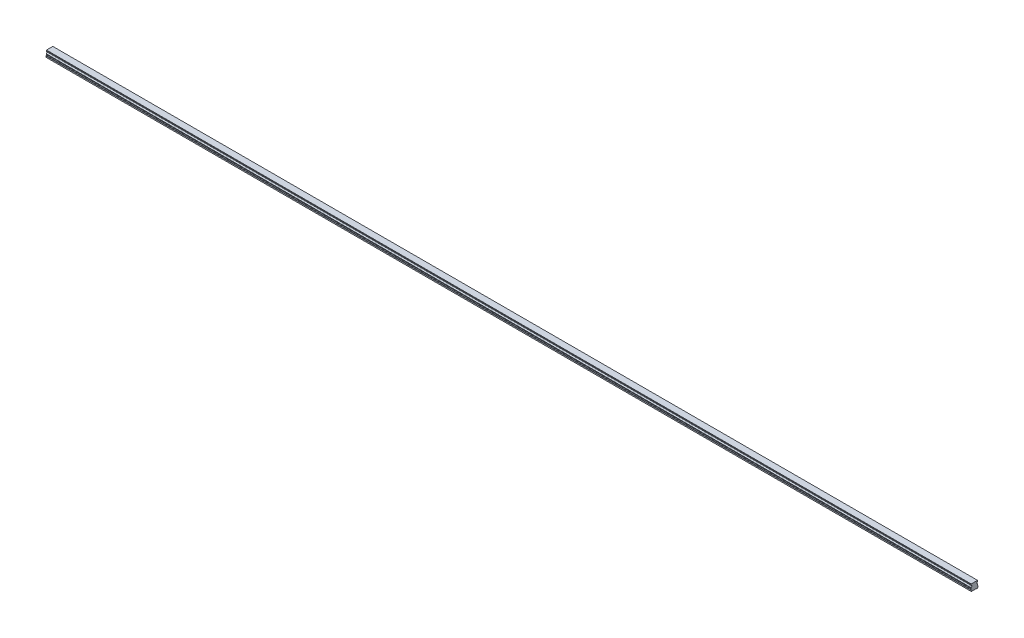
ISO-10303-21;
HEADER;
FILE_DESCRIPTION(('STEP AP214'),'2;1');
FILE_NAME('part.step','',(''),(''),'','','');
FILE_SCHEMA(('AUTOMOTIVE_DESIGN { 1 0 10303 214 1 1 1 1 }'));
ENDSEC;
DATA;
#1=APPLICATION_CONTEXT('core data for automotive mechanical design processes');
#2=APPLICATION_PROTOCOL_DEFINITION('international standard','automotive_design',2000,#1);
#3=PRODUCT_CONTEXT('',#1,'mechanical');
#4=PRODUCT('Part','Part','',(#3));
#5=PRODUCT_RELATED_PRODUCT_CATEGORY('part','',(#4));
#6=PRODUCT_DEFINITION_FORMATION('','',#4);
#7=PRODUCT_DEFINITION_CONTEXT('part definition',#1,'design');
#8=PRODUCT_DEFINITION('design','',#6,#7);
#9=PRODUCT_DEFINITION_SHAPE('','',#8);
#10=(LENGTH_UNIT() NAMED_UNIT(*) SI_UNIT(.MILLI.,.METRE.));
#11=(NAMED_UNIT(*) PLANE_ANGLE_UNIT() SI_UNIT($,.RADIAN.));
#12=(NAMED_UNIT(*) SI_UNIT($,.STERADIAN.) SOLID_ANGLE_UNIT());
#13=UNCERTAINTY_MEASURE_WITH_UNIT(LENGTH_MEASURE(1.E-05),#10,'distance_accuracy_value','');
#14=(GEOMETRIC_REPRESENTATION_CONTEXT(3) GLOBAL_UNCERTAINTY_ASSIGNED_CONTEXT((#13)) GLOBAL_UNIT_ASSIGNED_CONTEXT((#10,
#11,#12)) REPRESENTATION_CONTEXT('',''));
#15=CARTESIAN_POINT('',(0.,0.,0.));
#16=DIRECTION('',(0.,0.,1.));
#17=DIRECTION('',(1.,0.,0.));
#18=AXIS2_PLACEMENT_3D('',#15,#16,#17);
#19=CARTESIAN_POINT('',(1890.,0.399999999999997,0.));
#20=DIRECTION('',(0.,-1.,0.));
#21=DIRECTION('',(0.,0.,-1.));
#22=AXIS2_PLACEMENT_3D('',#19,#20,#21);
#23=CONICAL_SURFACE('',#22,2.90000000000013,0.785398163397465);
#24=CARTESIAN_POINT('',(1890.,0.800000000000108,0.));
#25=DIRECTION('',(0.,1.,0.));
#26=DIRECTION('',(0.,0.,1.));
#27=AXIS2_PLACEMENT_3D('',#24,#25,#26);
#28=CIRCLE('',#27,2.5);
#29=CARTESIAN_POINT('',(1890.,0.80000000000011,2.5));
#30=VERTEX_POINT('',#29);
#31=EDGE_CURVE('E11',#30,#30,#28,.F.);
#32=ORIENTED_EDGE('',*,*,#31,.F.);
#33=EDGE_LOOP('',(#32));
#34=FACE_BOUND('',#33,.T.);
#35=CARTESIAN_POINT('',(1890.,0.399999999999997,0.));
#36=DIRECTION('',(0.,1.,0.));
#37=DIRECTION('',(0.,0.,1.));
#38=AXIS2_PLACEMENT_3D('',#35,#36,#37);
#39=CIRCLE('',#38,2.90000000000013);
#40=CARTESIAN_POINT('',(1890.,0.399999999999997,2.90000000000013));
#41=VERTEX_POINT('',#40);
#42=EDGE_CURVE('E781',#41,#41,#39,.T.);
#43=ORIENTED_EDGE('',*,*,#42,.F.);
#44=EDGE_LOOP('',(#43));
#45=FACE_BOUND('',#44,.T.);
#46=ADVANCED_FACE('F39',(#34,#45),#23,.F.);
#47=CARTESIAN_POINT('',(1890.,7.,0.));
#48=DIRECTION('',(0.,-1.,0.));
#49=DIRECTION('',(0.,0.,-1.));
#50=AXIS2_PLACEMENT_3D('',#47,#48,#49);
#51=CYLINDRICAL_SURFACE('',#50,2.5);
#52=ORIENTED_EDGE('',*,*,#31,.T.);
#53=EDGE_LOOP('',(#52));
#54=FACE_BOUND('',#53,.T.);
#55=CARTESIAN_POINT('',(1890.,7.,0.));
#56=DIRECTION('',(0.,-1.,0.));
#57=DIRECTION('',(0.,0.,-1.));
#58=AXIS2_PLACEMENT_3D('',#55,#56,#57);
#59=CIRCLE('',#58,2.5);
#60=CARTESIAN_POINT('',(1890.,7.,-2.50000000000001));
#61=VERTEX_POINT('',#60);
#62=EDGE_CURVE('E49',#61,#61,#59,.T.);
#63=ORIENTED_EDGE('',*,*,#62,.F.);
#64=EDGE_LOOP('',(#63));
#65=FACE_BOUND('',#64,.T.);
#66=ADVANCED_FACE('F1094',(#54,#65),#51,.F.);
#67=CARTESIAN_POINT('',(1890.,7.,0.));
#68=DIRECTION('',(0.,-1.,0.));
#69=DIRECTION('',(0.,0.,-1.));
#70=AXIS2_PLACEMENT_3D('',#67,#68,#69);
#71=PLANE('',#70);
#72=CARTESIAN_POINT('',(1890.,7.,0.));
#73=DIRECTION('',(0.,-1.,0.));
#74=DIRECTION('',(0.,0.,-1.));
#75=AXIS2_PLACEMENT_3D('',#72,#73,#74);
#76=CIRCLE('',#75,2.1);
#77=CARTESIAN_POINT('',(1890.,7.,-2.1));
#78=VERTEX_POINT('',#77);
#79=EDGE_CURVE('E42',#78,#78,#76,.T.);
#80=ORIENTED_EDGE('',*,*,#79,.F.);
#81=EDGE_LOOP('',(#80));
#82=FACE_BOUND('',#81,.T.);
#83=ORIENTED_EDGE('',*,*,#62,.T.);
#84=EDGE_LOOP('',(#83));
#85=FACE_BOUND('',#84,.T.);
#86=ADVANCED_FACE('F1099',(#82,#85),#71,.T.);
#87=CARTESIAN_POINT('',(1830.,0.399999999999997,0.));
#88=DIRECTION('',(0.,-1.,0.));
#89=DIRECTION('',(0.,0.,-1.));
#90=AXIS2_PLACEMENT_3D('',#87,#88,#89);
#91=CONICAL_SURFACE('',#90,2.90000000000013,0.785398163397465);
#92=CARTESIAN_POINT('',(1830.,0.800000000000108,0.));
#93=DIRECTION('',(0.,1.,0.));
#94=DIRECTION('',(0.,0.,1.));
#95=AXIS2_PLACEMENT_3D('',#92,#93,#94);
#96=CIRCLE('',#95,2.5);
#97=CARTESIAN_POINT('',(1830.,0.80000000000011,2.5));
#98=VERTEX_POINT('',#97);
#99=EDGE_CURVE('E777',#98,#98,#96,.F.);
#100=ORIENTED_EDGE('',*,*,#99,.F.);
#101=EDGE_LOOP('',(#100));
#102=FACE_BOUND('',#101,.T.);
#103=CARTESIAN_POINT('',(1830.,0.399999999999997,0.));
#104=DIRECTION('',(0.,1.,0.));
#105=DIRECTION('',(0.,0.,1.));
#106=AXIS2_PLACEMENT_3D('',#103,#104,#105);
#107=CIRCLE('',#106,2.90000000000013);
#108=CARTESIAN_POINT('',(1830.,0.399999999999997,2.90000000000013));
#109=VERTEX_POINT('',#108);
#110=EDGE_CURVE('E769',#109,#109,#107,.T.);
#111=ORIENTED_EDGE('',*,*,#110,.F.);
#112=EDGE_LOOP('',(#111));
#113=FACE_BOUND('',#112,.T.);
#114=ADVANCED_FACE('F1522',(#102,#113),#91,.F.);
#115=CARTESIAN_POINT('',(1830.,7.,0.));
#116=DIRECTION('',(0.,-1.,0.));
#117=DIRECTION('',(0.,0.,-1.));
#118=AXIS2_PLACEMENT_3D('',#115,#116,#117);
#119=CYLINDRICAL_SURFACE('',#118,2.5);
#120=ORIENTED_EDGE('',*,*,#99,.T.);
#121=EDGE_LOOP('',(#120));
#122=FACE_BOUND('',#121,.T.);
#123=CARTESIAN_POINT('',(1830.,7.,0.));
#124=DIRECTION('',(0.,-1.,0.));
#125=DIRECTION('',(0.,0.,-1.));
#126=AXIS2_PLACEMENT_3D('',#123,#124,#125);
#127=CIRCLE('',#126,2.5);
#128=CARTESIAN_POINT('',(1830.,7.,-2.50000000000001));
#129=VERTEX_POINT('',#128);
#130=EDGE_CURVE('E773',#129,#129,#127,.T.);
#131=ORIENTED_EDGE('',*,*,#130,.F.);
#132=EDGE_LOOP('',(#131));
#133=FACE_BOUND('',#132,.T.);
#134=ADVANCED_FACE('F1518',(#122,#133),#119,.F.);
#135=CARTESIAN_POINT('',(1830.,7.,0.));
#136=DIRECTION('',(0.,-1.,0.));
#137=DIRECTION('',(0.,0.,-1.));
#138=AXIS2_PLACEMENT_3D('',#135,#136,#137);
#139=PLANE('',#138);
#140=CARTESIAN_POINT('',(1830.,7.,0.));
#141=DIRECTION('',(0.,-1.,0.));
#142=DIRECTION('',(0.,0.,-1.));
#143=AXIS2_PLACEMENT_3D('',#140,#141,#142);
#144=CIRCLE('',#143,2.1);
#145=CARTESIAN_POINT('',(1830.,7.,-2.1));
#146=VERTEX_POINT('',#145);
#147=EDGE_CURVE('E904',#146,#146,#144,.T.);
#148=ORIENTED_EDGE('',*,*,#147,.F.);
#149=EDGE_LOOP('',(#148));
#150=FACE_BOUND('',#149,.T.);
#151=ORIENTED_EDGE('',*,*,#130,.T.);
#152=EDGE_LOOP('',(#151));
#153=FACE_BOUND('',#152,.T.);
#154=ADVANCED_FACE('F1514',(#150,#153),#139,.T.);
#155=CARTESIAN_POINT('',(1770.,0.399999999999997,0.));
#156=DIRECTION('',(0.,-1.,0.));
#157=DIRECTION('',(0.,0.,-1.));
#158=AXIS2_PLACEMENT_3D('',#155,#156,#157);
#159=CONICAL_SURFACE('',#158,2.90000000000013,0.785398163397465);
#160=CARTESIAN_POINT('',(1770.,0.800000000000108,0.));
#161=DIRECTION('',(0.,1.,0.));
#162=DIRECTION('',(0.,0.,1.));
#163=AXIS2_PLACEMENT_3D('',#160,#161,#162);
#164=CIRCLE('',#163,2.5);
#165=CARTESIAN_POINT('',(1770.,0.80000000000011,2.5));
#166=VERTEX_POINT('',#165);
#167=EDGE_CURVE('E765',#166,#166,#164,.F.);
#168=ORIENTED_EDGE('',*,*,#167,.F.);
#169=EDGE_LOOP('',(#168));
#170=FACE_BOUND('',#169,.T.);
#171=CARTESIAN_POINT('',(1770.,0.399999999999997,0.));
#172=DIRECTION('',(0.,1.,0.));
#173=DIRECTION('',(0.,0.,1.));
#174=AXIS2_PLACEMENT_3D('',#171,#172,#173);
#175=CIRCLE('',#174,2.90000000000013);
#176=CARTESIAN_POINT('',(1770.,0.399999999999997,2.90000000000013));
#177=VERTEX_POINT('',#176);
#178=EDGE_CURVE('E757',#177,#177,#175,.T.);
#179=ORIENTED_EDGE('',*,*,#178,.F.);
#180=EDGE_LOOP('',(#179));
#181=FACE_BOUND('',#180,.T.);
#182=ADVANCED_FACE('F1510',(#170,#181),#159,.F.);
#183=CARTESIAN_POINT('',(1770.,7.,0.));
#184=DIRECTION('',(0.,-1.,0.));
#185=DIRECTION('',(0.,0.,-1.));
#186=AXIS2_PLACEMENT_3D('',#183,#184,#185);
#187=CYLINDRICAL_SURFACE('',#186,2.5);
#188=ORIENTED_EDGE('',*,*,#167,.T.);
#189=EDGE_LOOP('',(#188));
#190=FACE_BOUND('',#189,.T.);
#191=CARTESIAN_POINT('',(1770.,7.,0.));
#192=DIRECTION('',(0.,-1.,0.));
#193=DIRECTION('',(0.,0.,-1.));
#194=AXIS2_PLACEMENT_3D('',#191,#192,#193);
#195=CIRCLE('',#194,2.5);
#196=CARTESIAN_POINT('',(1770.,7.,-2.50000000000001));
#197=VERTEX_POINT('',#196);
#198=EDGE_CURVE('E761',#197,#197,#195,.T.);
#199=ORIENTED_EDGE('',*,*,#198,.F.);
#200=EDGE_LOOP('',(#199));
#201=FACE_BOUND('',#200,.T.);
#202=ADVANCED_FACE('F1506',(#190,#201),#187,.F.);
#203=CARTESIAN_POINT('',(1770.,7.,0.));
#204=DIRECTION('',(0.,-1.,0.));
#205=DIRECTION('',(0.,0.,-1.));
#206=AXIS2_PLACEMENT_3D('',#203,#204,#205);
#207=PLANE('',#206);
#208=CARTESIAN_POINT('',(1770.,7.,0.));
#209=DIRECTION('',(0.,-1.,0.));
#210=DIRECTION('',(0.,0.,-1.));
#211=AXIS2_PLACEMENT_3D('',#208,#209,#210);
#212=CIRCLE('',#211,2.1);
#213=CARTESIAN_POINT('',(1770.,7.,-2.1));
#214=VERTEX_POINT('',#213);
#215=EDGE_CURVE('E901',#214,#214,#212,.T.);
#216=ORIENTED_EDGE('',*,*,#215,.F.);
#217=EDGE_LOOP('',(#216));
#218=FACE_BOUND('',#217,.T.);
#219=ORIENTED_EDGE('',*,*,#198,.T.);
#220=EDGE_LOOP('',(#219));
#221=FACE_BOUND('',#220,.T.);
#222=ADVANCED_FACE('F1502',(#218,#221),#207,.T.);
#223=CARTESIAN_POINT('',(1710.,0.399999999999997,0.));
#224=DIRECTION('',(0.,-1.,0.));
#225=DIRECTION('',(0.,0.,-1.));
#226=AXIS2_PLACEMENT_3D('',#223,#224,#225);
#227=CONICAL_SURFACE('',#226,2.90000000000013,0.785398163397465);
#228=CARTESIAN_POINT('',(1710.,0.800000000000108,0.));
#229=DIRECTION('',(0.,1.,0.));
#230=DIRECTION('',(0.,0.,1.));
#231=AXIS2_PLACEMENT_3D('',#228,#229,#230);
#232=CIRCLE('',#231,2.5);
#233=CARTESIAN_POINT('',(1710.,0.80000000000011,2.5));
#234=VERTEX_POINT('',#233);
#235=EDGE_CURVE('E753',#234,#234,#232,.F.);
#236=ORIENTED_EDGE('',*,*,#235,.F.);
#237=EDGE_LOOP('',(#236));
#238=FACE_BOUND('',#237,.T.);
#239=CARTESIAN_POINT('',(1710.,0.399999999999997,0.));
#240=DIRECTION('',(0.,1.,0.));
#241=DIRECTION('',(0.,0.,1.));
#242=AXIS2_PLACEMENT_3D('',#239,#240,#241);
#243=CIRCLE('',#242,2.90000000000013);
#244=CARTESIAN_POINT('',(1710.,0.399999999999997,2.90000000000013));
#245=VERTEX_POINT('',#244);
#246=EDGE_CURVE('E745',#245,#245,#243,.T.);
#247=ORIENTED_EDGE('',*,*,#246,.F.);
#248=EDGE_LOOP('',(#247));
#249=FACE_BOUND('',#248,.T.);
#250=ADVANCED_FACE('F1498',(#238,#249),#227,.F.);
#251=CARTESIAN_POINT('',(1710.,7.,0.));
#252=DIRECTION('',(0.,-1.,0.));
#253=DIRECTION('',(0.,0.,-1.));
#254=AXIS2_PLACEMENT_3D('',#251,#252,#253);
#255=CYLINDRICAL_SURFACE('',#254,2.5);
#256=ORIENTED_EDGE('',*,*,#235,.T.);
#257=EDGE_LOOP('',(#256));
#258=FACE_BOUND('',#257,.T.);
#259=CARTESIAN_POINT('',(1710.,7.,0.));
#260=DIRECTION('',(0.,-1.,0.));
#261=DIRECTION('',(0.,0.,-1.));
#262=AXIS2_PLACEMENT_3D('',#259,#260,#261);
#263=CIRCLE('',#262,2.5);
#264=CARTESIAN_POINT('',(1710.,7.,-2.50000000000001));
#265=VERTEX_POINT('',#264);
#266=EDGE_CURVE('E749',#265,#265,#263,.T.);
#267=ORIENTED_EDGE('',*,*,#266,.F.);
#268=EDGE_LOOP('',(#267));
#269=FACE_BOUND('',#268,.T.);
#270=ADVANCED_FACE('F1494',(#258,#269),#255,.F.);
#271=CARTESIAN_POINT('',(1710.,7.,0.));
#272=DIRECTION('',(0.,-1.,0.));
#273=DIRECTION('',(0.,0.,-1.));
#274=AXIS2_PLACEMENT_3D('',#271,#272,#273);
#275=PLANE('',#274);
#276=CARTESIAN_POINT('',(1710.,7.,0.));
#277=DIRECTION('',(0.,-1.,0.));
#278=DIRECTION('',(0.,0.,-1.));
#279=AXIS2_PLACEMENT_3D('',#276,#277,#278);
#280=CIRCLE('',#279,2.1);
#281=CARTESIAN_POINT('',(1710.,7.,-2.1));
#282=VERTEX_POINT('',#281);
#283=EDGE_CURVE('E897',#282,#282,#280,.T.);
#284=ORIENTED_EDGE('',*,*,#283,.F.);
#285=EDGE_LOOP('',(#284));
#286=FACE_BOUND('',#285,.T.);
#287=ORIENTED_EDGE('',*,*,#266,.T.);
#288=EDGE_LOOP('',(#287));
#289=FACE_BOUND('',#288,.T.);
#290=ADVANCED_FACE('F1490',(#286,#289),#275,.T.);
#291=CARTESIAN_POINT('',(1650.,0.399999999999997,0.));
#292=DIRECTION('',(0.,-1.,0.));
#293=DIRECTION('',(0.,0.,-1.));
#294=AXIS2_PLACEMENT_3D('',#291,#292,#293);
#295=CONICAL_SURFACE('',#294,2.90000000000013,0.785398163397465);
#296=CARTESIAN_POINT('',(1650.,0.800000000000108,0.));
#297=DIRECTION('',(0.,1.,0.));
#298=DIRECTION('',(0.,0.,1.));
#299=AXIS2_PLACEMENT_3D('',#296,#297,#298);
#300=CIRCLE('',#299,2.5);
#301=CARTESIAN_POINT('',(1650.,0.80000000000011,2.5));
#302=VERTEX_POINT('',#301);
#303=EDGE_CURVE('E741',#302,#302,#300,.F.);
#304=ORIENTED_EDGE('',*,*,#303,.F.);
#305=EDGE_LOOP('',(#304));
#306=FACE_BOUND('',#305,.T.);
#307=CARTESIAN_POINT('',(1650.,0.399999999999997,0.));
#308=DIRECTION('',(0.,1.,0.));
#309=DIRECTION('',(0.,0.,1.));
#310=AXIS2_PLACEMENT_3D('',#307,#308,#309);
#311=CIRCLE('',#310,2.90000000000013);
#312=CARTESIAN_POINT('',(1650.,0.399999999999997,2.90000000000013));
#313=VERTEX_POINT('',#312);
#314=EDGE_CURVE('E733',#313,#313,#311,.T.);
#315=ORIENTED_EDGE('',*,*,#314,.F.);
#316=EDGE_LOOP('',(#315));
#317=FACE_BOUND('',#316,.T.);
#318=ADVANCED_FACE('F1486',(#306,#317),#295,.F.);
#319=CARTESIAN_POINT('',(1650.,7.,0.));
#320=DIRECTION('',(0.,-1.,0.));
#321=DIRECTION('',(0.,0.,-1.));
#322=AXIS2_PLACEMENT_3D('',#319,#320,#321);
#323=CYLINDRICAL_SURFACE('',#322,2.5);
#324=ORIENTED_EDGE('',*,*,#303,.T.);
#325=EDGE_LOOP('',(#324));
#326=FACE_BOUND('',#325,.T.);
#327=CARTESIAN_POINT('',(1650.,7.,0.));
#328=DIRECTION('',(0.,-1.,0.));
#329=DIRECTION('',(0.,0.,-1.));
#330=AXIS2_PLACEMENT_3D('',#327,#328,#329);
#331=CIRCLE('',#330,2.5);
#332=CARTESIAN_POINT('',(1650.,7.,-2.50000000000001));
#333=VERTEX_POINT('',#332);
#334=EDGE_CURVE('E737',#333,#333,#331,.T.);
#335=ORIENTED_EDGE('',*,*,#334,.F.);
#336=EDGE_LOOP('',(#335));
#337=FACE_BOUND('',#336,.T.);
#338=ADVANCED_FACE('F1482',(#326,#337),#323,.F.);
#339=CARTESIAN_POINT('',(1650.,7.,0.));
#340=DIRECTION('',(0.,-1.,0.));
#341=DIRECTION('',(0.,0.,-1.));
#342=AXIS2_PLACEMENT_3D('',#339,#340,#341);
#343=PLANE('',#342);
#344=CARTESIAN_POINT('',(1650.,7.,0.));
#345=DIRECTION('',(0.,-1.,0.));
#346=DIRECTION('',(0.,0.,-1.));
#347=AXIS2_PLACEMENT_3D('',#344,#345,#346);
#348=CIRCLE('',#347,2.1);
#349=CARTESIAN_POINT('',(1650.,7.,-2.1));
#350=VERTEX_POINT('',#349);
#351=EDGE_CURVE('E893',#350,#350,#348,.T.);
#352=ORIENTED_EDGE('',*,*,#351,.F.);
#353=EDGE_LOOP('',(#352));
#354=FACE_BOUND('',#353,.T.);
#355=ORIENTED_EDGE('',*,*,#334,.T.);
#356=EDGE_LOOP('',(#355));
#357=FACE_BOUND('',#356,.T.);
#358=ADVANCED_FACE('F1478',(#354,#357),#343,.T.);
#359=CARTESIAN_POINT('',(1590.,0.399999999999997,0.));
#360=DIRECTION('',(0.,-1.,0.));
#361=DIRECTION('',(0.,0.,-1.));
#362=AXIS2_PLACEMENT_3D('',#359,#360,#361);
#363=CONICAL_SURFACE('',#362,2.90000000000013,0.785398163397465);
#364=CARTESIAN_POINT('',(1590.,0.800000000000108,0.));
#365=DIRECTION('',(0.,1.,0.));
#366=DIRECTION('',(0.,0.,1.));
#367=AXIS2_PLACEMENT_3D('',#364,#365,#366);
#368=CIRCLE('',#367,2.5);
#369=CARTESIAN_POINT('',(1590.,0.80000000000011,2.5));
#370=VERTEX_POINT('',#369);
#371=EDGE_CURVE('E729',#370,#370,#368,.F.);
#372=ORIENTED_EDGE('',*,*,#371,.F.);
#373=EDGE_LOOP('',(#372));
#374=FACE_BOUND('',#373,.T.);
#375=CARTESIAN_POINT('',(1590.,0.399999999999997,0.));
#376=DIRECTION('',(0.,1.,0.));
#377=DIRECTION('',(0.,0.,1.));
#378=AXIS2_PLACEMENT_3D('',#375,#376,#377);
#379=CIRCLE('',#378,2.90000000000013);
#380=CARTESIAN_POINT('',(1590.,0.399999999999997,2.90000000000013));
#381=VERTEX_POINT('',#380);
#382=EDGE_CURVE('E721',#381,#381,#379,.T.);
#383=ORIENTED_EDGE('',*,*,#382,.F.);
#384=EDGE_LOOP('',(#383));
#385=FACE_BOUND('',#384,.T.);
#386=ADVANCED_FACE('F1474',(#374,#385),#363,.F.);
#387=CARTESIAN_POINT('',(1590.,7.,0.));
#388=DIRECTION('',(0.,-1.,0.));
#389=DIRECTION('',(0.,0.,-1.));
#390=AXIS2_PLACEMENT_3D('',#387,#388,#389);
#391=CYLINDRICAL_SURFACE('',#390,2.5);
#392=ORIENTED_EDGE('',*,*,#371,.T.);
#393=EDGE_LOOP('',(#392));
#394=FACE_BOUND('',#393,.T.);
#395=CARTESIAN_POINT('',(1590.,7.,0.));
#396=DIRECTION('',(0.,-1.,0.));
#397=DIRECTION('',(0.,0.,-1.));
#398=AXIS2_PLACEMENT_3D('',#395,#396,#397);
#399=CIRCLE('',#398,2.5);
#400=CARTESIAN_POINT('',(1590.,7.,-2.50000000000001));
#401=VERTEX_POINT('',#400);
#402=EDGE_CURVE('E725',#401,#401,#399,.T.);
#403=ORIENTED_EDGE('',*,*,#402,.F.);
#404=EDGE_LOOP('',(#403));
#405=FACE_BOUND('',#404,.T.);
#406=ADVANCED_FACE('F1470',(#394,#405),#391,.F.);
#407=CARTESIAN_POINT('',(1590.,7.,0.));
#408=DIRECTION('',(0.,-1.,0.));
#409=DIRECTION('',(0.,0.,-1.));
#410=AXIS2_PLACEMENT_3D('',#407,#408,#409);
#411=PLANE('',#410);
#412=CARTESIAN_POINT('',(1590.,7.,0.));
#413=DIRECTION('',(0.,-1.,0.));
#414=DIRECTION('',(0.,0.,-1.));
#415=AXIS2_PLACEMENT_3D('',#412,#413,#414);
#416=CIRCLE('',#415,2.1);
#417=CARTESIAN_POINT('',(1590.,7.,-2.1));
#418=VERTEX_POINT('',#417);
#419=EDGE_CURVE('E889',#418,#418,#416,.T.);
#420=ORIENTED_EDGE('',*,*,#419,.F.);
#421=EDGE_LOOP('',(#420));
#422=FACE_BOUND('',#421,.T.);
#423=ORIENTED_EDGE('',*,*,#402,.T.);
#424=EDGE_LOOP('',(#423));
#425=FACE_BOUND('',#424,.T.);
#426=ADVANCED_FACE('F1466',(#422,#425),#411,.T.);
#427=CARTESIAN_POINT('',(1530.,0.399999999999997,0.));
#428=DIRECTION('',(0.,-1.,0.));
#429=DIRECTION('',(0.,0.,-1.));
#430=AXIS2_PLACEMENT_3D('',#427,#428,#429);
#431=CONICAL_SURFACE('',#430,2.90000000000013,0.785398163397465);
#432=CARTESIAN_POINT('',(1530.,0.800000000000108,0.));
#433=DIRECTION('',(0.,1.,0.));
#434=DIRECTION('',(0.,0.,1.));
#435=AXIS2_PLACEMENT_3D('',#432,#433,#434);
#436=CIRCLE('',#435,2.5);
#437=CARTESIAN_POINT('',(1530.,0.80000000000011,2.5));
#438=VERTEX_POINT('',#437);
#439=EDGE_CURVE('E717',#438,#438,#436,.F.);
#440=ORIENTED_EDGE('',*,*,#439,.F.);
#441=EDGE_LOOP('',(#440));
#442=FACE_BOUND('',#441,.T.);
#443=CARTESIAN_POINT('',(1530.,0.399999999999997,0.));
#444=DIRECTION('',(0.,1.,0.));
#445=DIRECTION('',(0.,0.,1.));
#446=AXIS2_PLACEMENT_3D('',#443,#444,#445);
#447=CIRCLE('',#446,2.90000000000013);
#448=CARTESIAN_POINT('',(1530.,0.399999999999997,2.90000000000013));
#449=VERTEX_POINT('',#448);
#450=EDGE_CURVE('E709',#449,#449,#447,.T.);
#451=ORIENTED_EDGE('',*,*,#450,.F.);
#452=EDGE_LOOP('',(#451));
#453=FACE_BOUND('',#452,.T.);
#454=ADVANCED_FACE('F1462',(#442,#453),#431,.F.);
#455=CARTESIAN_POINT('',(1530.,7.,0.));
#456=DIRECTION('',(0.,-1.,0.));
#457=DIRECTION('',(0.,0.,-1.));
#458=AXIS2_PLACEMENT_3D('',#455,#456,#457);
#459=CYLINDRICAL_SURFACE('',#458,2.5);
#460=ORIENTED_EDGE('',*,*,#439,.T.);
#461=EDGE_LOOP('',(#460));
#462=FACE_BOUND('',#461,.T.);
#463=CARTESIAN_POINT('',(1530.,7.,0.));
#464=DIRECTION('',(0.,-1.,0.));
#465=DIRECTION('',(0.,0.,-1.));
#466=AXIS2_PLACEMENT_3D('',#463,#464,#465);
#467=CIRCLE('',#466,2.5);
#468=CARTESIAN_POINT('',(1530.,7.,-2.50000000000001));
#469=VERTEX_POINT('',#468);
#470=EDGE_CURVE('E713',#469,#469,#467,.T.);
#471=ORIENTED_EDGE('',*,*,#470,.F.);
#472=EDGE_LOOP('',(#471));
#473=FACE_BOUND('',#472,.T.);
#474=ADVANCED_FACE('F1458',(#462,#473),#459,.F.);
#475=CARTESIAN_POINT('',(1530.,7.,0.));
#476=DIRECTION('',(0.,-1.,0.));
#477=DIRECTION('',(0.,0.,-1.));
#478=AXIS2_PLACEMENT_3D('',#475,#476,#477);
#479=PLANE('',#478);
#480=CARTESIAN_POINT('',(1530.,7.,0.));
#481=DIRECTION('',(0.,-1.,0.));
#482=DIRECTION('',(0.,0.,-1.));
#483=AXIS2_PLACEMENT_3D('',#480,#481,#482);
#484=CIRCLE('',#483,2.1);
#485=CARTESIAN_POINT('',(1530.,7.,-2.1));
#486=VERTEX_POINT('',#485);
#487=EDGE_CURVE('E885',#486,#486,#484,.T.);
#488=ORIENTED_EDGE('',*,*,#487,.F.);
#489=EDGE_LOOP('',(#488));
#490=FACE_BOUND('',#489,.T.);
#491=ORIENTED_EDGE('',*,*,#470,.T.);
#492=EDGE_LOOP('',(#491));
#493=FACE_BOUND('',#492,.T.);
#494=ADVANCED_FACE('F1454',(#490,#493),#479,.T.);
#495=CARTESIAN_POINT('',(1470.,0.399999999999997,0.));
#496=DIRECTION('',(0.,-1.,0.));
#497=DIRECTION('',(0.,0.,-1.));
#498=AXIS2_PLACEMENT_3D('',#495,#496,#497);
#499=CONICAL_SURFACE('',#498,2.90000000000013,0.785398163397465);
#500=CARTESIAN_POINT('',(1470.,0.800000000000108,0.));
#501=DIRECTION('',(0.,1.,0.));
#502=DIRECTION('',(0.,0.,1.));
#503=AXIS2_PLACEMENT_3D('',#500,#501,#502);
#504=CIRCLE('',#503,2.5);
#505=CARTESIAN_POINT('',(1470.,0.80000000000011,2.5));
#506=VERTEX_POINT('',#505);
#507=EDGE_CURVE('E705',#506,#506,#504,.F.);
#508=ORIENTED_EDGE('',*,*,#507,.F.);
#509=EDGE_LOOP('',(#508));
#510=FACE_BOUND('',#509,.T.);
#511=CARTESIAN_POINT('',(1470.,0.399999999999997,0.));
#512=DIRECTION('',(0.,1.,0.));
#513=DIRECTION('',(0.,0.,1.));
#514=AXIS2_PLACEMENT_3D('',#511,#512,#513);
#515=CIRCLE('',#514,2.90000000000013);
#516=CARTESIAN_POINT('',(1470.,0.399999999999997,2.90000000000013));
#517=VERTEX_POINT('',#516);
#518=EDGE_CURVE('E697',#517,#517,#515,.T.);
#519=ORIENTED_EDGE('',*,*,#518,.F.);
#520=EDGE_LOOP('',(#519));
#521=FACE_BOUND('',#520,.T.);
#522=ADVANCED_FACE('F1450',(#510,#521),#499,.F.);
#523=CARTESIAN_POINT('',(1470.,7.,0.));
#524=DIRECTION('',(0.,-1.,0.));
#525=DIRECTION('',(0.,0.,-1.));
#526=AXIS2_PLACEMENT_3D('',#523,#524,#525);
#527=CYLINDRICAL_SURFACE('',#526,2.5);
#528=ORIENTED_EDGE('',*,*,#507,.T.);
#529=EDGE_LOOP('',(#528));
#530=FACE_BOUND('',#529,.T.);
#531=CARTESIAN_POINT('',(1470.,7.,0.));
#532=DIRECTION('',(0.,-1.,0.));
#533=DIRECTION('',(0.,0.,-1.));
#534=AXIS2_PLACEMENT_3D('',#531,#532,#533);
#535=CIRCLE('',#534,2.5);
#536=CARTESIAN_POINT('',(1470.,7.,-2.50000000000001));
#537=VERTEX_POINT('',#536);
#538=EDGE_CURVE('E701',#537,#537,#535,.T.);
#539=ORIENTED_EDGE('',*,*,#538,.F.);
#540=EDGE_LOOP('',(#539));
#541=FACE_BOUND('',#540,.T.);
#542=ADVANCED_FACE('F1446',(#530,#541),#527,.F.);
#543=CARTESIAN_POINT('',(1470.,7.,0.));
#544=DIRECTION('',(0.,-1.,0.));
#545=DIRECTION('',(0.,0.,-1.));
#546=AXIS2_PLACEMENT_3D('',#543,#544,#545);
#547=PLANE('',#546);
#548=CARTESIAN_POINT('',(1470.,7.,0.));
#549=DIRECTION('',(0.,-1.,0.));
#550=DIRECTION('',(0.,0.,-1.));
#551=AXIS2_PLACEMENT_3D('',#548,#549,#550);
#552=CIRCLE('',#551,2.1);
#553=CARTESIAN_POINT('',(1470.,7.,-2.1));
#554=VERTEX_POINT('',#553);
#555=EDGE_CURVE('E881',#554,#554,#552,.T.);
#556=ORIENTED_EDGE('',*,*,#555,.F.);
#557=EDGE_LOOP('',(#556));
#558=FACE_BOUND('',#557,.T.);
#559=ORIENTED_EDGE('',*,*,#538,.T.);
#560=EDGE_LOOP('',(#559));
#561=FACE_BOUND('',#560,.T.);
#562=ADVANCED_FACE('F1442',(#558,#561),#547,.T.);
#563=CARTESIAN_POINT('',(1410.,0.399999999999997,0.));
#564=DIRECTION('',(0.,-1.,0.));
#565=DIRECTION('',(0.,0.,-1.));
#566=AXIS2_PLACEMENT_3D('',#563,#564,#565);
#567=CONICAL_SURFACE('',#566,2.90000000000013,0.785398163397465);
#568=CARTESIAN_POINT('',(1410.,0.800000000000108,0.));
#569=DIRECTION('',(0.,1.,0.));
#570=DIRECTION('',(0.,0.,1.));
#571=AXIS2_PLACEMENT_3D('',#568,#569,#570);
#572=CIRCLE('',#571,2.5);
#573=CARTESIAN_POINT('',(1410.,0.80000000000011,2.5));
#574=VERTEX_POINT('',#573);
#575=EDGE_CURVE('E693',#574,#574,#572,.F.);
#576=ORIENTED_EDGE('',*,*,#575,.F.);
#577=EDGE_LOOP('',(#576));
#578=FACE_BOUND('',#577,.T.);
#579=CARTESIAN_POINT('',(1410.,0.399999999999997,0.));
#580=DIRECTION('',(0.,1.,0.));
#581=DIRECTION('',(0.,0.,1.));
#582=AXIS2_PLACEMENT_3D('',#579,#580,#581);
#583=CIRCLE('',#582,2.90000000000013);
#584=CARTESIAN_POINT('',(1410.,0.399999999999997,2.90000000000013));
#585=VERTEX_POINT('',#584);
#586=EDGE_CURVE('E685',#585,#585,#583,.T.);
#587=ORIENTED_EDGE('',*,*,#586,.F.);
#588=EDGE_LOOP('',(#587));
#589=FACE_BOUND('',#588,.T.);
#590=ADVANCED_FACE('F1438',(#578,#589),#567,.F.);
#591=CARTESIAN_POINT('',(1410.,7.,0.));
#592=DIRECTION('',(0.,-1.,0.));
#593=DIRECTION('',(0.,0.,-1.));
#594=AXIS2_PLACEMENT_3D('',#591,#592,#593);
#595=CYLINDRICAL_SURFACE('',#594,2.5);
#596=ORIENTED_EDGE('',*,*,#575,.T.);
#597=EDGE_LOOP('',(#596));
#598=FACE_BOUND('',#597,.T.);
#599=CARTESIAN_POINT('',(1410.,7.,0.));
#600=DIRECTION('',(0.,-1.,0.));
#601=DIRECTION('',(0.,0.,-1.));
#602=AXIS2_PLACEMENT_3D('',#599,#600,#601);
#603=CIRCLE('',#602,2.5);
#604=CARTESIAN_POINT('',(1410.,7.,-2.50000000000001));
#605=VERTEX_POINT('',#604);
#606=EDGE_CURVE('E689',#605,#605,#603,.T.);
#607=ORIENTED_EDGE('',*,*,#606,.F.);
#608=EDGE_LOOP('',(#607));
#609=FACE_BOUND('',#608,.T.);
#610=ADVANCED_FACE('F1434',(#598,#609),#595,.F.);
#611=CARTESIAN_POINT('',(1410.,7.,0.));
#612=DIRECTION('',(0.,-1.,0.));
#613=DIRECTION('',(0.,0.,-1.));
#614=AXIS2_PLACEMENT_3D('',#611,#612,#613);
#615=PLANE('',#614);
#616=CARTESIAN_POINT('',(1410.,7.,0.));
#617=DIRECTION('',(0.,-1.,0.));
#618=DIRECTION('',(0.,0.,-1.));
#619=AXIS2_PLACEMENT_3D('',#616,#617,#618);
#620=CIRCLE('',#619,2.1);
#621=CARTESIAN_POINT('',(1410.,7.,-2.1));
#622=VERTEX_POINT('',#621);
#623=EDGE_CURVE('E877',#622,#622,#620,.T.);
#624=ORIENTED_EDGE('',*,*,#623,.F.);
#625=EDGE_LOOP('',(#624));
#626=FACE_BOUND('',#625,.T.);
#627=ORIENTED_EDGE('',*,*,#606,.T.);
#628=EDGE_LOOP('',(#627));
#629=FACE_BOUND('',#628,.T.);
#630=ADVANCED_FACE('F1430',(#626,#629),#615,.T.);
#631=CARTESIAN_POINT('',(1350.,0.399999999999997,0.));
#632=DIRECTION('',(0.,-1.,0.));
#633=DIRECTION('',(0.,0.,-1.));
#634=AXIS2_PLACEMENT_3D('',#631,#632,#633);
#635=CONICAL_SURFACE('',#634,2.90000000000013,0.785398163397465);
#636=CARTESIAN_POINT('',(1350.,0.800000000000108,0.));
#637=DIRECTION('',(0.,1.,0.));
#638=DIRECTION('',(0.,0.,1.));
#639=AXIS2_PLACEMENT_3D('',#636,#637,#638);
#640=CIRCLE('',#639,2.5);
#641=CARTESIAN_POINT('',(1350.,0.80000000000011,2.5));
#642=VERTEX_POINT('',#641);
#643=EDGE_CURVE('E681',#642,#642,#640,.F.);
#644=ORIENTED_EDGE('',*,*,#643,.F.);
#645=EDGE_LOOP('',(#644));
#646=FACE_BOUND('',#645,.T.);
#647=CARTESIAN_POINT('',(1350.,0.399999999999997,0.));
#648=DIRECTION('',(0.,1.,0.));
#649=DIRECTION('',(0.,0.,1.));
#650=AXIS2_PLACEMENT_3D('',#647,#648,#649);
#651=CIRCLE('',#650,2.90000000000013);
#652=CARTESIAN_POINT('',(1350.,0.399999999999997,2.90000000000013));
#653=VERTEX_POINT('',#652);
#654=EDGE_CURVE('E673',#653,#653,#651,.T.);
#655=ORIENTED_EDGE('',*,*,#654,.F.);
#656=EDGE_LOOP('',(#655));
#657=FACE_BOUND('',#656,.T.);
#658=ADVANCED_FACE('F1426',(#646,#657),#635,.F.);
#659=CARTESIAN_POINT('',(1350.,7.,0.));
#660=DIRECTION('',(0.,-1.,0.));
#661=DIRECTION('',(0.,0.,-1.));
#662=AXIS2_PLACEMENT_3D('',#659,#660,#661);
#663=CYLINDRICAL_SURFACE('',#662,2.5);
#664=ORIENTED_EDGE('',*,*,#643,.T.);
#665=EDGE_LOOP('',(#664));
#666=FACE_BOUND('',#665,.T.);
#667=CARTESIAN_POINT('',(1350.,7.,0.));
#668=DIRECTION('',(0.,-1.,0.));
#669=DIRECTION('',(0.,0.,-1.));
#670=AXIS2_PLACEMENT_3D('',#667,#668,#669);
#671=CIRCLE('',#670,2.5);
#672=CARTESIAN_POINT('',(1350.,7.,-2.50000000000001));
#673=VERTEX_POINT('',#672);
#674=EDGE_CURVE('E677',#673,#673,#671,.T.);
#675=ORIENTED_EDGE('',*,*,#674,.F.);
#676=EDGE_LOOP('',(#675));
#677=FACE_BOUND('',#676,.T.);
#678=ADVANCED_FACE('F1422',(#666,#677),#663,.F.);
#679=CARTESIAN_POINT('',(1350.,7.,0.));
#680=DIRECTION('',(0.,-1.,0.));
#681=DIRECTION('',(0.,0.,-1.));
#682=AXIS2_PLACEMENT_3D('',#679,#680,#681);
#683=PLANE('',#682);
#684=CARTESIAN_POINT('',(1350.,7.,0.));
#685=DIRECTION('',(0.,-1.,0.));
#686=DIRECTION('',(0.,0.,-1.));
#687=AXIS2_PLACEMENT_3D('',#684,#685,#686);
#688=CIRCLE('',#687,2.1);
#689=CARTESIAN_POINT('',(1350.,7.,-2.1));
#690=VERTEX_POINT('',#689);
#691=EDGE_CURVE('E873',#690,#690,#688,.T.);
#692=ORIENTED_EDGE('',*,*,#691,.F.);
#693=EDGE_LOOP('',(#692));
#694=FACE_BOUND('',#693,.T.);
#695=ORIENTED_EDGE('',*,*,#674,.T.);
#696=EDGE_LOOP('',(#695));
#697=FACE_BOUND('',#696,.T.);
#698=ADVANCED_FACE('F1418',(#694,#697),#683,.T.);
#699=CARTESIAN_POINT('',(1290.,0.399999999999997,0.));
#700=DIRECTION('',(0.,-1.,0.));
#701=DIRECTION('',(0.,0.,-1.));
#702=AXIS2_PLACEMENT_3D('',#699,#700,#701);
#703=CONICAL_SURFACE('',#702,2.90000000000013,0.785398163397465);
#704=CARTESIAN_POINT('',(1290.,0.800000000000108,0.));
#705=DIRECTION('',(0.,1.,0.));
#706=DIRECTION('',(0.,0.,1.));
#707=AXIS2_PLACEMENT_3D('',#704,#705,#706);
#708=CIRCLE('',#707,2.5);
#709=CARTESIAN_POINT('',(1290.,0.80000000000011,2.5));
#710=VERTEX_POINT('',#709);
#711=EDGE_CURVE('E669',#710,#710,#708,.F.);
#712=ORIENTED_EDGE('',*,*,#711,.F.);
#713=EDGE_LOOP('',(#712));
#714=FACE_BOUND('',#713,.T.);
#715=CARTESIAN_POINT('',(1290.,0.399999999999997,0.));
#716=DIRECTION('',(0.,1.,0.));
#717=DIRECTION('',(0.,0.,1.));
#718=AXIS2_PLACEMENT_3D('',#715,#716,#717);
#719=CIRCLE('',#718,2.90000000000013);
#720=CARTESIAN_POINT('',(1290.,0.399999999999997,2.90000000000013));
#721=VERTEX_POINT('',#720);
#722=EDGE_CURVE('E661',#721,#721,#719,.T.);
#723=ORIENTED_EDGE('',*,*,#722,.F.);
#724=EDGE_LOOP('',(#723));
#725=FACE_BOUND('',#724,.T.);
#726=ADVANCED_FACE('F1414',(#714,#725),#703,.F.);
#727=CARTESIAN_POINT('',(1290.,7.,0.));
#728=DIRECTION('',(0.,-1.,0.));
#729=DIRECTION('',(0.,0.,-1.));
#730=AXIS2_PLACEMENT_3D('',#727,#728,#729);
#731=CYLINDRICAL_SURFACE('',#730,2.5);
#732=ORIENTED_EDGE('',*,*,#711,.T.);
#733=EDGE_LOOP('',(#732));
#734=FACE_BOUND('',#733,.T.);
#735=CARTESIAN_POINT('',(1290.,7.,0.));
#736=DIRECTION('',(0.,-1.,0.));
#737=DIRECTION('',(0.,0.,-1.));
#738=AXIS2_PLACEMENT_3D('',#735,#736,#737);
#739=CIRCLE('',#738,2.5);
#740=CARTESIAN_POINT('',(1290.,7.,-2.50000000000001));
#741=VERTEX_POINT('',#740);
#742=EDGE_CURVE('E665',#741,#741,#739,.T.);
#743=ORIENTED_EDGE('',*,*,#742,.F.);
#744=EDGE_LOOP('',(#743));
#745=FACE_BOUND('',#744,.T.);
#746=ADVANCED_FACE('F1410',(#734,#745),#731,.F.);
#747=CARTESIAN_POINT('',(1290.,7.,0.));
#748=DIRECTION('',(0.,-1.,0.));
#749=DIRECTION('',(0.,0.,-1.));
#750=AXIS2_PLACEMENT_3D('',#747,#748,#749);
#751=PLANE('',#750);
#752=CARTESIAN_POINT('',(1290.,7.,0.));
#753=DIRECTION('',(0.,-1.,0.));
#754=DIRECTION('',(0.,0.,-1.));
#755=AXIS2_PLACEMENT_3D('',#752,#753,#754);
#756=CIRCLE('',#755,2.1);
#757=CARTESIAN_POINT('',(1290.,7.,-2.1));
#758=VERTEX_POINT('',#757);
#759=EDGE_CURVE('E869',#758,#758,#756,.T.);
#760=ORIENTED_EDGE('',*,*,#759,.F.);
#761=EDGE_LOOP('',(#760));
#762=FACE_BOUND('',#761,.T.);
#763=ORIENTED_EDGE('',*,*,#742,.T.);
#764=EDGE_LOOP('',(#763));
#765=FACE_BOUND('',#764,.T.);
#766=ADVANCED_FACE('F1406',(#762,#765),#751,.T.);
#767=CARTESIAN_POINT('',(1230.,0.399999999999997,0.));
#768=DIRECTION('',(0.,-1.,0.));
#769=DIRECTION('',(0.,0.,-1.));
#770=AXIS2_PLACEMENT_3D('',#767,#768,#769);
#771=CONICAL_SURFACE('',#770,2.90000000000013,0.785398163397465);
#772=CARTESIAN_POINT('',(1230.,0.800000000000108,0.));
#773=DIRECTION('',(0.,1.,0.));
#774=DIRECTION('',(0.,0.,1.));
#775=AXIS2_PLACEMENT_3D('',#772,#773,#774);
#776=CIRCLE('',#775,2.5);
#777=CARTESIAN_POINT('',(1230.,0.80000000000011,2.5));
#778=VERTEX_POINT('',#777);
#779=EDGE_CURVE('E657',#778,#778,#776,.F.);
#780=ORIENTED_EDGE('',*,*,#779,.F.);
#781=EDGE_LOOP('',(#780));
#782=FACE_BOUND('',#781,.T.);
#783=CARTESIAN_POINT('',(1230.,0.399999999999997,0.));
#784=DIRECTION('',(0.,1.,0.));
#785=DIRECTION('',(0.,0.,1.));
#786=AXIS2_PLACEMENT_3D('',#783,#784,#785);
#787=CIRCLE('',#786,2.90000000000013);
#788=CARTESIAN_POINT('',(1230.,0.399999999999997,2.90000000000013));
#789=VERTEX_POINT('',#788);
#790=EDGE_CURVE('E649',#789,#789,#787,.T.);
#791=ORIENTED_EDGE('',*,*,#790,.F.);
#792=EDGE_LOOP('',(#791));
#793=FACE_BOUND('',#792,.T.);
#794=ADVANCED_FACE('F1402',(#782,#793),#771,.F.);
#795=CARTESIAN_POINT('',(1230.,7.,0.));
#796=DIRECTION('',(0.,-1.,0.));
#797=DIRECTION('',(0.,0.,-1.));
#798=AXIS2_PLACEMENT_3D('',#795,#796,#797);
#799=CYLINDRICAL_SURFACE('',#798,2.5);
#800=ORIENTED_EDGE('',*,*,#779,.T.);
#801=EDGE_LOOP('',(#800));
#802=FACE_BOUND('',#801,.T.);
#803=CARTESIAN_POINT('',(1230.,7.,0.));
#804=DIRECTION('',(0.,-1.,0.));
#805=DIRECTION('',(0.,0.,-1.));
#806=AXIS2_PLACEMENT_3D('',#803,#804,#805);
#807=CIRCLE('',#806,2.5);
#808=CARTESIAN_POINT('',(1230.,7.,-2.50000000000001));
#809=VERTEX_POINT('',#808);
#810=EDGE_CURVE('E653',#809,#809,#807,.T.);
#811=ORIENTED_EDGE('',*,*,#810,.F.);
#812=EDGE_LOOP('',(#811));
#813=FACE_BOUND('',#812,.T.);
#814=ADVANCED_FACE('F1398',(#802,#813),#799,.F.);
#815=CARTESIAN_POINT('',(1230.,7.,0.));
#816=DIRECTION('',(0.,-1.,0.));
#817=DIRECTION('',(0.,0.,-1.));
#818=AXIS2_PLACEMENT_3D('',#815,#816,#817);
#819=PLANE('',#818);
#820=CARTESIAN_POINT('',(1230.,7.,0.));
#821=DIRECTION('',(0.,-1.,0.));
#822=DIRECTION('',(0.,0.,-1.));
#823=AXIS2_PLACEMENT_3D('',#820,#821,#822);
#824=CIRCLE('',#823,2.1);
#825=CARTESIAN_POINT('',(1230.,7.,-2.1));
#826=VERTEX_POINT('',#825);
#827=EDGE_CURVE('E865',#826,#826,#824,.T.);
#828=ORIENTED_EDGE('',*,*,#827,.F.);
#829=EDGE_LOOP('',(#828));
#830=FACE_BOUND('',#829,.T.);
#831=ORIENTED_EDGE('',*,*,#810,.T.);
#832=EDGE_LOOP('',(#831));
#833=FACE_BOUND('',#832,.T.);
#834=ADVANCED_FACE('F1394',(#830,#833),#819,.T.);
#835=CARTESIAN_POINT('',(1170.,0.399999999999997,0.));
#836=DIRECTION('',(0.,-1.,0.));
#837=DIRECTION('',(0.,0.,-1.));
#838=AXIS2_PLACEMENT_3D('',#835,#836,#837);
#839=CONICAL_SURFACE('',#838,2.90000000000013,0.785398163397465);
#840=CARTESIAN_POINT('',(1170.,0.800000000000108,0.));
#841=DIRECTION('',(0.,1.,0.));
#842=DIRECTION('',(0.,0.,1.));
#843=AXIS2_PLACEMENT_3D('',#840,#841,#842);
#844=CIRCLE('',#843,2.5);
#845=CARTESIAN_POINT('',(1170.,0.80000000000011,2.5));
#846=VERTEX_POINT('',#845);
#847=EDGE_CURVE('E645',#846,#846,#844,.F.);
#848=ORIENTED_EDGE('',*,*,#847,.F.);
#849=EDGE_LOOP('',(#848));
#850=FACE_BOUND('',#849,.T.);
#851=CARTESIAN_POINT('',(1170.,0.399999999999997,0.));
#852=DIRECTION('',(0.,1.,0.));
#853=DIRECTION('',(0.,0.,1.));
#854=AXIS2_PLACEMENT_3D('',#851,#852,#853);
#855=CIRCLE('',#854,2.90000000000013);
#856=CARTESIAN_POINT('',(1170.,0.399999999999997,2.90000000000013));
#857=VERTEX_POINT('',#856);
#858=EDGE_CURVE('E637',#857,#857,#855,.T.);
#859=ORIENTED_EDGE('',*,*,#858,.F.);
#860=EDGE_LOOP('',(#859));
#861=FACE_BOUND('',#860,.T.);
#862=ADVANCED_FACE('F1390',(#850,#861),#839,.F.);
#863=CARTESIAN_POINT('',(1170.,7.,0.));
#864=DIRECTION('',(0.,-1.,0.));
#865=DIRECTION('',(0.,0.,-1.));
#866=AXIS2_PLACEMENT_3D('',#863,#864,#865);
#867=CYLINDRICAL_SURFACE('',#866,2.5);
#868=ORIENTED_EDGE('',*,*,#847,.T.);
#869=EDGE_LOOP('',(#868));
#870=FACE_BOUND('',#869,.T.);
#871=CARTESIAN_POINT('',(1170.,7.,0.));
#872=DIRECTION('',(0.,-1.,0.));
#873=DIRECTION('',(0.,0.,-1.));
#874=AXIS2_PLACEMENT_3D('',#871,#872,#873);
#875=CIRCLE('',#874,2.5);
#876=CARTESIAN_POINT('',(1170.,7.,-2.50000000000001));
#877=VERTEX_POINT('',#876);
#878=EDGE_CURVE('E641',#877,#877,#875,.T.);
#879=ORIENTED_EDGE('',*,*,#878,.F.);
#880=EDGE_LOOP('',(#879));
#881=FACE_BOUND('',#880,.T.);
#882=ADVANCED_FACE('F1386',(#870,#881),#867,.F.);
#883=CARTESIAN_POINT('',(1170.,7.,0.));
#884=DIRECTION('',(0.,-1.,0.));
#885=DIRECTION('',(0.,0.,-1.));
#886=AXIS2_PLACEMENT_3D('',#883,#884,#885);
#887=PLANE('',#886);
#888=CARTESIAN_POINT('',(1170.,7.,0.));
#889=DIRECTION('',(0.,-1.,0.));
#890=DIRECTION('',(0.,0.,-1.));
#891=AXIS2_PLACEMENT_3D('',#888,#889,#890);
#892=CIRCLE('',#891,2.1);
#893=CARTESIAN_POINT('',(1170.,7.,-2.1));
#894=VERTEX_POINT('',#893);
#895=EDGE_CURVE('E861',#894,#894,#892,.T.);
#896=ORIENTED_EDGE('',*,*,#895,.F.);
#897=EDGE_LOOP('',(#896));
#898=FACE_BOUND('',#897,.T.);
#899=ORIENTED_EDGE('',*,*,#878,.T.);
#900=EDGE_LOOP('',(#899));
#901=FACE_BOUND('',#900,.T.);
#902=ADVANCED_FACE('F1382',(#898,#901),#887,.T.);
#903=CARTESIAN_POINT('',(1110.,0.399999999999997,0.));
#904=DIRECTION('',(0.,-1.,0.));
#905=DIRECTION('',(0.,0.,-1.));
#906=AXIS2_PLACEMENT_3D('',#903,#904,#905);
#907=CONICAL_SURFACE('',#906,2.90000000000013,0.785398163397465);
#908=CARTESIAN_POINT('',(1110.,0.800000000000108,0.));
#909=DIRECTION('',(0.,1.,0.));
#910=DIRECTION('',(0.,0.,1.));
#911=AXIS2_PLACEMENT_3D('',#908,#909,#910);
#912=CIRCLE('',#911,2.5);
#913=CARTESIAN_POINT('',(1110.,0.80000000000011,2.5));
#914=VERTEX_POINT('',#913);
#915=EDGE_CURVE('E633',#914,#914,#912,.F.);
#916=ORIENTED_EDGE('',*,*,#915,.F.);
#917=EDGE_LOOP('',(#916));
#918=FACE_BOUND('',#917,.T.);
#919=CARTESIAN_POINT('',(1110.,0.399999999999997,0.));
#920=DIRECTION('',(0.,1.,0.));
#921=DIRECTION('',(0.,0.,1.));
#922=AXIS2_PLACEMENT_3D('',#919,#920,#921);
#923=CIRCLE('',#922,2.90000000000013);
#924=CARTESIAN_POINT('',(1110.,0.399999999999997,2.90000000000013));
#925=VERTEX_POINT('',#924);
#926=EDGE_CURVE('E625',#925,#925,#923,.T.);
#927=ORIENTED_EDGE('',*,*,#926,.F.);
#928=EDGE_LOOP('',(#927));
#929=FACE_BOUND('',#928,.T.);
#930=ADVANCED_FACE('F1378',(#918,#929),#907,.F.);
#931=CARTESIAN_POINT('',(1110.,7.,0.));
#932=DIRECTION('',(0.,-1.,0.));
#933=DIRECTION('',(0.,0.,-1.));
#934=AXIS2_PLACEMENT_3D('',#931,#932,#933);
#935=CYLINDRICAL_SURFACE('',#934,2.5);
#936=ORIENTED_EDGE('',*,*,#915,.T.);
#937=EDGE_LOOP('',(#936));
#938=FACE_BOUND('',#937,.T.);
#939=CARTESIAN_POINT('',(1110.,7.,0.));
#940=DIRECTION('',(0.,-1.,0.));
#941=DIRECTION('',(0.,0.,-1.));
#942=AXIS2_PLACEMENT_3D('',#939,#940,#941);
#943=CIRCLE('',#942,2.5);
#944=CARTESIAN_POINT('',(1110.,7.,-2.50000000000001));
#945=VERTEX_POINT('',#944);
#946=EDGE_CURVE('E629',#945,#945,#943,.T.);
#947=ORIENTED_EDGE('',*,*,#946,.F.);
#948=EDGE_LOOP('',(#947));
#949=FACE_BOUND('',#948,.T.);
#950=ADVANCED_FACE('F1374',(#938,#949),#935,.F.);
#951=CARTESIAN_POINT('',(1110.,7.,0.));
#952=DIRECTION('',(0.,-1.,0.));
#953=DIRECTION('',(0.,0.,-1.));
#954=AXIS2_PLACEMENT_3D('',#951,#952,#953);
#955=PLANE('',#954);
#956=CARTESIAN_POINT('',(1110.,7.,0.));
#957=DIRECTION('',(0.,-1.,0.));
#958=DIRECTION('',(0.,0.,-1.));
#959=AXIS2_PLACEMENT_3D('',#956,#957,#958);
#960=CIRCLE('',#959,2.1);
#961=CARTESIAN_POINT('',(1110.,7.,-2.1));
#962=VERTEX_POINT('',#961);
#963=EDGE_CURVE('E857',#962,#962,#960,.T.);
#964=ORIENTED_EDGE('',*,*,#963,.F.);
#965=EDGE_LOOP('',(#964));
#966=FACE_BOUND('',#965,.T.);
#967=ORIENTED_EDGE('',*,*,#946,.T.);
#968=EDGE_LOOP('',(#967));
#969=FACE_BOUND('',#968,.T.);
#970=ADVANCED_FACE('F1370',(#966,#969),#955,.T.);
#971=CARTESIAN_POINT('',(1050.,0.399999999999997,0.));
#972=DIRECTION('',(0.,-1.,0.));
#973=DIRECTION('',(0.,0.,-1.));
#974=AXIS2_PLACEMENT_3D('',#971,#972,#973);
#975=CONICAL_SURFACE('',#974,2.90000000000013,0.785398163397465);
#976=CARTESIAN_POINT('',(1050.,0.800000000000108,0.));
#977=DIRECTION('',(0.,1.,0.));
#978=DIRECTION('',(0.,0.,1.));
#979=AXIS2_PLACEMENT_3D('',#976,#977,#978);
#980=CIRCLE('',#979,2.5);
#981=CARTESIAN_POINT('',(1050.,0.80000000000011,2.5));
#982=VERTEX_POINT('',#981);
#983=EDGE_CURVE('E621',#982,#982,#980,.F.);
#984=ORIENTED_EDGE('',*,*,#983,.F.);
#985=EDGE_LOOP('',(#984));
#986=FACE_BOUND('',#985,.T.);
#987=CARTESIAN_POINT('',(1050.,0.399999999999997,0.));
#988=DIRECTION('',(0.,1.,0.));
#989=DIRECTION('',(0.,0.,1.));
#990=AXIS2_PLACEMENT_3D('',#987,#988,#989);
#991=CIRCLE('',#990,2.90000000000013);
#992=CARTESIAN_POINT('',(1050.,0.399999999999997,2.90000000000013));
#993=VERTEX_POINT('',#992);
#994=EDGE_CURVE('E613',#993,#993,#991,.T.);
#995=ORIENTED_EDGE('',*,*,#994,.F.);
#996=EDGE_LOOP('',(#995));
#997=FACE_BOUND('',#996,.T.);
#998=ADVANCED_FACE('F1366',(#986,#997),#975,.F.);
#999=CARTESIAN_POINT('',(1050.,7.,0.));
#1000=DIRECTION('',(0.,-1.,0.));
#1001=DIRECTION('',(0.,0.,-1.));
#1002=AXIS2_PLACEMENT_3D('',#999,#1000,#1001);
#1003=CYLINDRICAL_SURFACE('',#1002,2.5);
#1004=ORIENTED_EDGE('',*,*,#983,.T.);
#1005=EDGE_LOOP('',(#1004));
#1006=FACE_BOUND('',#1005,.T.);
#1007=CARTESIAN_POINT('',(1050.,7.,0.));
#1008=DIRECTION('',(0.,-1.,0.));
#1009=DIRECTION('',(0.,0.,-1.));
#1010=AXIS2_PLACEMENT_3D('',#1007,#1008,#1009);
#1011=CIRCLE('',#1010,2.5);
#1012=CARTESIAN_POINT('',(1050.,7.,-2.50000000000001));
#1013=VERTEX_POINT('',#1012);
#1014=EDGE_CURVE('E617',#1013,#1013,#1011,.T.);
#1015=ORIENTED_EDGE('',*,*,#1014,.F.);
#1016=EDGE_LOOP('',(#1015));
#1017=FACE_BOUND('',#1016,.T.);
#1018=ADVANCED_FACE('F1362',(#1006,#1017),#1003,.F.);
#1019=CARTESIAN_POINT('',(1050.,7.,0.));
#1020=DIRECTION('',(0.,-1.,0.));
#1021=DIRECTION('',(0.,0.,-1.));
#1022=AXIS2_PLACEMENT_3D('',#1019,#1020,#1021);
#1023=PLANE('',#1022);
#1024=CARTESIAN_POINT('',(1050.,7.,0.));
#1025=DIRECTION('',(0.,-1.,0.));
#1026=DIRECTION('',(0.,0.,-1.));
#1027=AXIS2_PLACEMENT_3D('',#1024,#1025,#1026);
#1028=CIRCLE('',#1027,2.1);
#1029=CARTESIAN_POINT('',(1050.,7.,-2.1));
#1030=VERTEX_POINT('',#1029);
#1031=EDGE_CURVE('E853',#1030,#1030,#1028,.T.);
#1032=ORIENTED_EDGE('',*,*,#1031,.F.);
#1033=EDGE_LOOP('',(#1032));
#1034=FACE_BOUND('',#1033,.T.);
#1035=ORIENTED_EDGE('',*,*,#1014,.T.);
#1036=EDGE_LOOP('',(#1035));
#1037=FACE_BOUND('',#1036,.T.);
#1038=ADVANCED_FACE('F1358',(#1034,#1037),#1023,.T.);
#1039=CARTESIAN_POINT('',(990.,0.399999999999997,0.));
#1040=DIRECTION('',(0.,-1.,0.));
#1041=DIRECTION('',(0.,0.,-1.));
#1042=AXIS2_PLACEMENT_3D('',#1039,#1040,#1041);
#1043=CONICAL_SURFACE('',#1042,2.90000000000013,0.785398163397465);
#1044=CARTESIAN_POINT('',(990.,0.800000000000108,0.));
#1045=DIRECTION('',(0.,1.,0.));
#1046=DIRECTION('',(0.,0.,1.));
#1047=AXIS2_PLACEMENT_3D('',#1044,#1045,#1046);
#1048=CIRCLE('',#1047,2.5);
#1049=CARTESIAN_POINT('',(990.,0.80000000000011,2.5));
#1050=VERTEX_POINT('',#1049);
#1051=EDGE_CURVE('E609',#1050,#1050,#1048,.F.);
#1052=ORIENTED_EDGE('',*,*,#1051,.F.);
#1053=EDGE_LOOP('',(#1052));
#1054=FACE_BOUND('',#1053,.T.);
#1055=CARTESIAN_POINT('',(990.,0.399999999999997,0.));
#1056=DIRECTION('',(0.,1.,0.));
#1057=DIRECTION('',(0.,0.,1.));
#1058=AXIS2_PLACEMENT_3D('',#1055,#1056,#1057);
#1059=CIRCLE('',#1058,2.90000000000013);
#1060=CARTESIAN_POINT('',(990.,0.399999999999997,2.90000000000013));
#1061=VERTEX_POINT('',#1060);
#1062=EDGE_CURVE('E601',#1061,#1061,#1059,.T.);
#1063=ORIENTED_EDGE('',*,*,#1062,.F.);
#1064=EDGE_LOOP('',(#1063));
#1065=FACE_BOUND('',#1064,.T.);
#1066=ADVANCED_FACE('F1354',(#1054,#1065),#1043,.F.);
#1067=CARTESIAN_POINT('',(990.,7.,0.));
#1068=DIRECTION('',(0.,-1.,0.));
#1069=DIRECTION('',(0.,0.,-1.));
#1070=AXIS2_PLACEMENT_3D('',#1067,#1068,#1069);
#1071=CYLINDRICAL_SURFACE('',#1070,2.5);
#1072=ORIENTED_EDGE('',*,*,#1051,.T.);
#1073=EDGE_LOOP('',(#1072));
#1074=FACE_BOUND('',#1073,.T.);
#1075=CARTESIAN_POINT('',(990.,7.,0.));
#1076=DIRECTION('',(0.,-1.,0.));
#1077=DIRECTION('',(0.,0.,-1.));
#1078=AXIS2_PLACEMENT_3D('',#1075,#1076,#1077);
#1079=CIRCLE('',#1078,2.5);
#1080=CARTESIAN_POINT('',(990.,7.,-2.50000000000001));
#1081=VERTEX_POINT('',#1080);
#1082=EDGE_CURVE('E605',#1081,#1081,#1079,.T.);
#1083=ORIENTED_EDGE('',*,*,#1082,.F.);
#1084=EDGE_LOOP('',(#1083));
#1085=FACE_BOUND('',#1084,.T.);
#1086=ADVANCED_FACE('F1350',(#1074,#1085),#1071,.F.);
#1087=CARTESIAN_POINT('',(990.,7.,0.));
#1088=DIRECTION('',(0.,-1.,0.));
#1089=DIRECTION('',(0.,0.,-1.));
#1090=AXIS2_PLACEMENT_3D('',#1087,#1088,#1089);
#1091=PLANE('',#1090);
#1092=CARTESIAN_POINT('',(990.,7.,0.));
#1093=DIRECTION('',(0.,-1.,0.));
#1094=DIRECTION('',(0.,0.,-1.));
#1095=AXIS2_PLACEMENT_3D('',#1092,#1093,#1094);
#1096=CIRCLE('',#1095,2.1);
#1097=CARTESIAN_POINT('',(990.,7.,-2.1));
#1098=VERTEX_POINT('',#1097);
#1099=EDGE_CURVE('E849',#1098,#1098,#1096,.T.);
#1100=ORIENTED_EDGE('',*,*,#1099,.F.);
#1101=EDGE_LOOP('',(#1100));
#1102=FACE_BOUND('',#1101,.T.);
#1103=ORIENTED_EDGE('',*,*,#1082,.T.);
#1104=EDGE_LOOP('',(#1103));
#1105=FACE_BOUND('',#1104,.T.);
#1106=ADVANCED_FACE('F1346',(#1102,#1105),#1091,.T.);
#1107=CARTESIAN_POINT('',(930.,0.399999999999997,0.));
#1108=DIRECTION('',(0.,-1.,0.));
#1109=DIRECTION('',(0.,0.,-1.));
#1110=AXIS2_PLACEMENT_3D('',#1107,#1108,#1109);
#1111=CONICAL_SURFACE('',#1110,2.90000000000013,0.785398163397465);
#1112=CARTESIAN_POINT('',(930.,0.800000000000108,0.));
#1113=DIRECTION('',(0.,1.,0.));
#1114=DIRECTION('',(0.,0.,1.));
#1115=AXIS2_PLACEMENT_3D('',#1112,#1113,#1114);
#1116=CIRCLE('',#1115,2.5);
#1117=CARTESIAN_POINT('',(930.,0.80000000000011,2.5));
#1118=VERTEX_POINT('',#1117);
#1119=EDGE_CURVE('E597',#1118,#1118,#1116,.F.);
#1120=ORIENTED_EDGE('',*,*,#1119,.F.);
#1121=EDGE_LOOP('',(#1120));
#1122=FACE_BOUND('',#1121,.T.);
#1123=CARTESIAN_POINT('',(930.,0.399999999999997,0.));
#1124=DIRECTION('',(0.,1.,0.));
#1125=DIRECTION('',(0.,0.,1.));
#1126=AXIS2_PLACEMENT_3D('',#1123,#1124,#1125);
#1127=CIRCLE('',#1126,2.90000000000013);
#1128=CARTESIAN_POINT('',(930.,0.399999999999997,2.90000000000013));
#1129=VERTEX_POINT('',#1128);
#1130=EDGE_CURVE('E589',#1129,#1129,#1127,.T.);
#1131=ORIENTED_EDGE('',*,*,#1130,.F.);
#1132=EDGE_LOOP('',(#1131));
#1133=FACE_BOUND('',#1132,.T.);
#1134=ADVANCED_FACE('F1342',(#1122,#1133),#1111,.F.);
#1135=CARTESIAN_POINT('',(930.,7.,0.));
#1136=DIRECTION('',(0.,-1.,0.));
#1137=DIRECTION('',(0.,0.,-1.));
#1138=AXIS2_PLACEMENT_3D('',#1135,#1136,#1137);
#1139=CYLINDRICAL_SURFACE('',#1138,2.5);
#1140=ORIENTED_EDGE('',*,*,#1119,.T.);
#1141=EDGE_LOOP('',(#1140));
#1142=FACE_BOUND('',#1141,.T.);
#1143=CARTESIAN_POINT('',(930.,7.,0.));
#1144=DIRECTION('',(0.,-1.,0.));
#1145=DIRECTION('',(0.,0.,-1.));
#1146=AXIS2_PLACEMENT_3D('',#1143,#1144,#1145);
#1147=CIRCLE('',#1146,2.5);
#1148=CARTESIAN_POINT('',(930.,7.,-2.50000000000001));
#1149=VERTEX_POINT('',#1148);
#1150=EDGE_CURVE('E593',#1149,#1149,#1147,.T.);
#1151=ORIENTED_EDGE('',*,*,#1150,.F.);
#1152=EDGE_LOOP('',(#1151));
#1153=FACE_BOUND('',#1152,.T.);
#1154=ADVANCED_FACE('F1338',(#1142,#1153),#1139,.F.);
#1155=CARTESIAN_POINT('',(930.,7.,0.));
#1156=DIRECTION('',(0.,-1.,0.));
#1157=DIRECTION('',(0.,0.,-1.));
#1158=AXIS2_PLACEMENT_3D('',#1155,#1156,#1157);
#1159=PLANE('',#1158);
#1160=CARTESIAN_POINT('',(930.,7.,0.));
#1161=DIRECTION('',(0.,-1.,0.));
#1162=DIRECTION('',(0.,0.,-1.));
#1163=AXIS2_PLACEMENT_3D('',#1160,#1161,#1162);
#1164=CIRCLE('',#1163,2.1);
#1165=CARTESIAN_POINT('',(930.,7.,-2.1));
#1166=VERTEX_POINT('',#1165);
#1167=EDGE_CURVE('E845',#1166,#1166,#1164,.T.);
#1168=ORIENTED_EDGE('',*,*,#1167,.F.);
#1169=EDGE_LOOP('',(#1168));
#1170=FACE_BOUND('',#1169,.T.);
#1171=ORIENTED_EDGE('',*,*,#1150,.T.);
#1172=EDGE_LOOP('',(#1171));
#1173=FACE_BOUND('',#1172,.T.);
#1174=ADVANCED_FACE('F1334',(#1170,#1173),#1159,.T.);
#1175=CARTESIAN_POINT('',(870.,0.399999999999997,0.));
#1176=DIRECTION('',(0.,-1.,0.));
#1177=DIRECTION('',(0.,0.,-1.));
#1178=AXIS2_PLACEMENT_3D('',#1175,#1176,#1177);
#1179=CONICAL_SURFACE('',#1178,2.90000000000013,0.785398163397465);
#1180=CARTESIAN_POINT('',(870.,0.800000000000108,0.));
#1181=DIRECTION('',(0.,1.,0.));
#1182=DIRECTION('',(0.,0.,1.));
#1183=AXIS2_PLACEMENT_3D('',#1180,#1181,#1182);
#1184=CIRCLE('',#1183,2.5);
#1185=CARTESIAN_POINT('',(870.,0.80000000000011,2.5));
#1186=VERTEX_POINT('',#1185);
#1187=EDGE_CURVE('E585',#1186,#1186,#1184,.F.);
#1188=ORIENTED_EDGE('',*,*,#1187,.F.);
#1189=EDGE_LOOP('',(#1188));
#1190=FACE_BOUND('',#1189,.T.);
#1191=CARTESIAN_POINT('',(870.,0.399999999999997,0.));
#1192=DIRECTION('',(0.,1.,0.));
#1193=DIRECTION('',(0.,0.,1.));
#1194=AXIS2_PLACEMENT_3D('',#1191,#1192,#1193);
#1195=CIRCLE('',#1194,2.90000000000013);
#1196=CARTESIAN_POINT('',(870.,0.399999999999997,2.90000000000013));
#1197=VERTEX_POINT('',#1196);
#1198=EDGE_CURVE('E577',#1197,#1197,#1195,.T.);
#1199=ORIENTED_EDGE('',*,*,#1198,.F.);
#1200=EDGE_LOOP('',(#1199));
#1201=FACE_BOUND('',#1200,.T.);
#1202=ADVANCED_FACE('F1330',(#1190,#1201),#1179,.F.);
#1203=CARTESIAN_POINT('',(870.,7.,0.));
#1204=DIRECTION('',(0.,-1.,0.));
#1205=DIRECTION('',(0.,0.,-1.));
#1206=AXIS2_PLACEMENT_3D('',#1203,#1204,#1205);
#1207=CYLINDRICAL_SURFACE('',#1206,2.5);
#1208=ORIENTED_EDGE('',*,*,#1187,.T.);
#1209=EDGE_LOOP('',(#1208));
#1210=FACE_BOUND('',#1209,.T.);
#1211=CARTESIAN_POINT('',(870.,7.,0.));
#1212=DIRECTION('',(0.,-1.,0.));
#1213=DIRECTION('',(0.,0.,-1.));
#1214=AXIS2_PLACEMENT_3D('',#1211,#1212,#1213);
#1215=CIRCLE('',#1214,2.5);
#1216=CARTESIAN_POINT('',(870.,7.,-2.50000000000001));
#1217=VERTEX_POINT('',#1216);
#1218=EDGE_CURVE('E581',#1217,#1217,#1215,.T.);
#1219=ORIENTED_EDGE('',*,*,#1218,.F.);
#1220=EDGE_LOOP('',(#1219));
#1221=FACE_BOUND('',#1220,.T.);
#1222=ADVANCED_FACE('F1326',(#1210,#1221),#1207,.F.);
#1223=CARTESIAN_POINT('',(870.,7.,0.));
#1224=DIRECTION('',(0.,-1.,0.));
#1225=DIRECTION('',(0.,0.,-1.));
#1226=AXIS2_PLACEMENT_3D('',#1223,#1224,#1225);
#1227=PLANE('',#1226);
#1228=CARTESIAN_POINT('',(870.,7.,0.));
#1229=DIRECTION('',(0.,-1.,0.));
#1230=DIRECTION('',(0.,0.,-1.));
#1231=AXIS2_PLACEMENT_3D('',#1228,#1229,#1230);
#1232=CIRCLE('',#1231,2.1);
#1233=CARTESIAN_POINT('',(870.,7.,-2.1));
#1234=VERTEX_POINT('',#1233);
#1235=EDGE_CURVE('E841',#1234,#1234,#1232,.T.);
#1236=ORIENTED_EDGE('',*,*,#1235,.F.);
#1237=EDGE_LOOP('',(#1236));
#1238=FACE_BOUND('',#1237,.T.);
#1239=ORIENTED_EDGE('',*,*,#1218,.T.);
#1240=EDGE_LOOP('',(#1239));
#1241=FACE_BOUND('',#1240,.T.);
#1242=ADVANCED_FACE('F1322',(#1238,#1241),#1227,.T.);
#1243=CARTESIAN_POINT('',(810.,0.399999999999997,0.));
#1244=DIRECTION('',(0.,-1.,0.));
#1245=DIRECTION('',(0.,0.,-1.));
#1246=AXIS2_PLACEMENT_3D('',#1243,#1244,#1245);
#1247=CONICAL_SURFACE('',#1246,2.90000000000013,0.785398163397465);
#1248=CARTESIAN_POINT('',(810.,0.800000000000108,0.));
#1249=DIRECTION('',(0.,1.,0.));
#1250=DIRECTION('',(0.,0.,1.));
#1251=AXIS2_PLACEMENT_3D('',#1248,#1249,#1250);
#1252=CIRCLE('',#1251,2.5);
#1253=CARTESIAN_POINT('',(810.,0.80000000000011,2.5));
#1254=VERTEX_POINT('',#1253);
#1255=EDGE_CURVE('E573',#1254,#1254,#1252,.F.);
#1256=ORIENTED_EDGE('',*,*,#1255,.F.);
#1257=EDGE_LOOP('',(#1256));
#1258=FACE_BOUND('',#1257,.T.);
#1259=CARTESIAN_POINT('',(810.,0.399999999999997,0.));
#1260=DIRECTION('',(0.,1.,0.));
#1261=DIRECTION('',(0.,0.,1.));
#1262=AXIS2_PLACEMENT_3D('',#1259,#1260,#1261);
#1263=CIRCLE('',#1262,2.90000000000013);
#1264=CARTESIAN_POINT('',(810.,0.399999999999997,2.90000000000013));
#1265=VERTEX_POINT('',#1264);
#1266=EDGE_CURVE('E565',#1265,#1265,#1263,.T.);
#1267=ORIENTED_EDGE('',*,*,#1266,.F.);
#1268=EDGE_LOOP('',(#1267));
#1269=FACE_BOUND('',#1268,.T.);
#1270=ADVANCED_FACE('F1318',(#1258,#1269),#1247,.F.);
#1271=CARTESIAN_POINT('',(810.,7.,0.));
#1272=DIRECTION('',(0.,-1.,0.));
#1273=DIRECTION('',(0.,0.,-1.));
#1274=AXIS2_PLACEMENT_3D('',#1271,#1272,#1273);
#1275=CYLINDRICAL_SURFACE('',#1274,2.5);
#1276=ORIENTED_EDGE('',*,*,#1255,.T.);
#1277=EDGE_LOOP('',(#1276));
#1278=FACE_BOUND('',#1277,.T.);
#1279=CARTESIAN_POINT('',(810.,7.,0.));
#1280=DIRECTION('',(0.,-1.,0.));
#1281=DIRECTION('',(0.,0.,-1.));
#1282=AXIS2_PLACEMENT_3D('',#1279,#1280,#1281);
#1283=CIRCLE('',#1282,2.5);
#1284=CARTESIAN_POINT('',(810.,7.,-2.50000000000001));
#1285=VERTEX_POINT('',#1284);
#1286=EDGE_CURVE('E569',#1285,#1285,#1283,.T.);
#1287=ORIENTED_EDGE('',*,*,#1286,.F.);
#1288=EDGE_LOOP('',(#1287));
#1289=FACE_BOUND('',#1288,.T.);
#1290=ADVANCED_FACE('F1314',(#1278,#1289),#1275,.F.);
#1291=CARTESIAN_POINT('',(810.,7.,0.));
#1292=DIRECTION('',(0.,-1.,0.));
#1293=DIRECTION('',(0.,0.,-1.));
#1294=AXIS2_PLACEMENT_3D('',#1291,#1292,#1293);
#1295=PLANE('',#1294);
#1296=CARTESIAN_POINT('',(810.,7.,0.));
#1297=DIRECTION('',(0.,-1.,0.));
#1298=DIRECTION('',(0.,0.,-1.));
#1299=AXIS2_PLACEMENT_3D('',#1296,#1297,#1298);
#1300=CIRCLE('',#1299,2.1);
#1301=CARTESIAN_POINT('',(810.,7.,-2.1));
#1302=VERTEX_POINT('',#1301);
#1303=EDGE_CURVE('E837',#1302,#1302,#1300,.T.);
#1304=ORIENTED_EDGE('',*,*,#1303,.F.);
#1305=EDGE_LOOP('',(#1304));
#1306=FACE_BOUND('',#1305,.T.);
#1307=ORIENTED_EDGE('',*,*,#1286,.T.);
#1308=EDGE_LOOP('',(#1307));
#1309=FACE_BOUND('',#1308,.T.);
#1310=ADVANCED_FACE('F1310',(#1306,#1309),#1295,.T.);
#1311=CARTESIAN_POINT('',(750.,0.399999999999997,0.));
#1312=DIRECTION('',(0.,-1.,0.));
#1313=DIRECTION('',(0.,0.,-1.));
#1314=AXIS2_PLACEMENT_3D('',#1311,#1312,#1313);
#1315=CONICAL_SURFACE('',#1314,2.90000000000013,0.785398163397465);
#1316=CARTESIAN_POINT('',(750.,0.800000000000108,0.));
#1317=DIRECTION('',(0.,1.,0.));
#1318=DIRECTION('',(0.,0.,1.));
#1319=AXIS2_PLACEMENT_3D('',#1316,#1317,#1318);
#1320=CIRCLE('',#1319,2.5);
#1321=CARTESIAN_POINT('',(750.,0.80000000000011,2.5));
#1322=VERTEX_POINT('',#1321);
#1323=EDGE_CURVE('E561',#1322,#1322,#1320,.F.);
#1324=ORIENTED_EDGE('',*,*,#1323,.F.);
#1325=EDGE_LOOP('',(#1324));
#1326=FACE_BOUND('',#1325,.T.);
#1327=CARTESIAN_POINT('',(750.,0.399999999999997,0.));
#1328=DIRECTION('',(0.,1.,0.));
#1329=DIRECTION('',(0.,0.,1.));
#1330=AXIS2_PLACEMENT_3D('',#1327,#1328,#1329);
#1331=CIRCLE('',#1330,2.90000000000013);
#1332=CARTESIAN_POINT('',(750.,0.399999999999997,2.90000000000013));
#1333=VERTEX_POINT('',#1332);
#1334=EDGE_CURVE('E553',#1333,#1333,#1331,.T.);
#1335=ORIENTED_EDGE('',*,*,#1334,.F.);
#1336=EDGE_LOOP('',(#1335));
#1337=FACE_BOUND('',#1336,.T.);
#1338=ADVANCED_FACE('F1306',(#1326,#1337),#1315,.F.);
#1339=CARTESIAN_POINT('',(750.,7.,0.));
#1340=DIRECTION('',(0.,-1.,0.));
#1341=DIRECTION('',(0.,0.,-1.));
#1342=AXIS2_PLACEMENT_3D('',#1339,#1340,#1341);
#1343=CYLINDRICAL_SURFACE('',#1342,2.5);
#1344=ORIENTED_EDGE('',*,*,#1323,.T.);
#1345=EDGE_LOOP('',(#1344));
#1346=FACE_BOUND('',#1345,.T.);
#1347=CARTESIAN_POINT('',(750.,7.,0.));
#1348=DIRECTION('',(0.,-1.,0.));
#1349=DIRECTION('',(0.,0.,-1.));
#1350=AXIS2_PLACEMENT_3D('',#1347,#1348,#1349);
#1351=CIRCLE('',#1350,2.5);
#1352=CARTESIAN_POINT('',(750.,7.,-2.50000000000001));
#1353=VERTEX_POINT('',#1352);
#1354=EDGE_CURVE('E557',#1353,#1353,#1351,.T.);
#1355=ORIENTED_EDGE('',*,*,#1354,.F.);
#1356=EDGE_LOOP('',(#1355));
#1357=FACE_BOUND('',#1356,.T.);
#1358=ADVANCED_FACE('F1302',(#1346,#1357),#1343,.F.);
#1359=CARTESIAN_POINT('',(750.,7.,0.));
#1360=DIRECTION('',(0.,-1.,0.));
#1361=DIRECTION('',(0.,0.,-1.));
#1362=AXIS2_PLACEMENT_3D('',#1359,#1360,#1361);
#1363=PLANE('',#1362);
#1364=CARTESIAN_POINT('',(750.,7.,0.));
#1365=DIRECTION('',(0.,-1.,0.));
#1366=DIRECTION('',(0.,0.,-1.));
#1367=AXIS2_PLACEMENT_3D('',#1364,#1365,#1366);
#1368=CIRCLE('',#1367,2.1);
#1369=CARTESIAN_POINT('',(750.,7.,-2.1));
#1370=VERTEX_POINT('',#1369);
#1371=EDGE_CURVE('E833',#1370,#1370,#1368,.T.);
#1372=ORIENTED_EDGE('',*,*,#1371,.F.);
#1373=EDGE_LOOP('',(#1372));
#1374=FACE_BOUND('',#1373,.T.);
#1375=ORIENTED_EDGE('',*,*,#1354,.T.);
#1376=EDGE_LOOP('',(#1375));
#1377=FACE_BOUND('',#1376,.T.);
#1378=ADVANCED_FACE('F1298',(#1374,#1377),#1363,.T.);
#1379=CARTESIAN_POINT('',(690.,0.399999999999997,0.));
#1380=DIRECTION('',(0.,-1.,0.));
#1381=DIRECTION('',(0.,0.,-1.));
#1382=AXIS2_PLACEMENT_3D('',#1379,#1380,#1381);
#1383=CONICAL_SURFACE('',#1382,2.90000000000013,0.785398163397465);
#1384=CARTESIAN_POINT('',(690.,0.800000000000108,0.));
#1385=DIRECTION('',(0.,1.,0.));
#1386=DIRECTION('',(0.,0.,1.));
#1387=AXIS2_PLACEMENT_3D('',#1384,#1385,#1386);
#1388=CIRCLE('',#1387,2.5);
#1389=CARTESIAN_POINT('',(690.,0.80000000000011,2.5));
#1390=VERTEX_POINT('',#1389);
#1391=EDGE_CURVE('E549',#1390,#1390,#1388,.F.);
#1392=ORIENTED_EDGE('',*,*,#1391,.F.);
#1393=EDGE_LOOP('',(#1392));
#1394=FACE_BOUND('',#1393,.T.);
#1395=CARTESIAN_POINT('',(690.,0.399999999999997,0.));
#1396=DIRECTION('',(0.,1.,0.));
#1397=DIRECTION('',(0.,0.,1.));
#1398=AXIS2_PLACEMENT_3D('',#1395,#1396,#1397);
#1399=CIRCLE('',#1398,2.90000000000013);
#1400=CARTESIAN_POINT('',(690.,0.399999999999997,2.90000000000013));
#1401=VERTEX_POINT('',#1400);
#1402=EDGE_CURVE('E541',#1401,#1401,#1399,.T.);
#1403=ORIENTED_EDGE('',*,*,#1402,.F.);
#1404=EDGE_LOOP('',(#1403));
#1405=FACE_BOUND('',#1404,.T.);
#1406=ADVANCED_FACE('F1294',(#1394,#1405),#1383,.F.);
#1407=CARTESIAN_POINT('',(690.,7.,0.));
#1408=DIRECTION('',(0.,-1.,0.));
#1409=DIRECTION('',(0.,0.,-1.));
#1410=AXIS2_PLACEMENT_3D('',#1407,#1408,#1409);
#1411=CYLINDRICAL_SURFACE('',#1410,2.5);
#1412=ORIENTED_EDGE('',*,*,#1391,.T.);
#1413=EDGE_LOOP('',(#1412));
#1414=FACE_BOUND('',#1413,.T.);
#1415=CARTESIAN_POINT('',(690.,7.,0.));
#1416=DIRECTION('',(0.,-1.,0.));
#1417=DIRECTION('',(0.,0.,-1.));
#1418=AXIS2_PLACEMENT_3D('',#1415,#1416,#1417);
#1419=CIRCLE('',#1418,2.5);
#1420=CARTESIAN_POINT('',(690.,7.,-2.50000000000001));
#1421=VERTEX_POINT('',#1420);
#1422=EDGE_CURVE('E545',#1421,#1421,#1419,.T.);
#1423=ORIENTED_EDGE('',*,*,#1422,.F.);
#1424=EDGE_LOOP('',(#1423));
#1425=FACE_BOUND('',#1424,.T.);
#1426=ADVANCED_FACE('F1290',(#1414,#1425),#1411,.F.);
#1427=CARTESIAN_POINT('',(690.,7.,0.));
#1428=DIRECTION('',(0.,-1.,0.));
#1429=DIRECTION('',(0.,0.,-1.));
#1430=AXIS2_PLACEMENT_3D('',#1427,#1428,#1429);
#1431=PLANE('',#1430);
#1432=CARTESIAN_POINT('',(690.,7.,0.));
#1433=DIRECTION('',(0.,-1.,0.));
#1434=DIRECTION('',(0.,0.,-1.));
#1435=AXIS2_PLACEMENT_3D('',#1432,#1433,#1434);
#1436=CIRCLE('',#1435,2.1);
#1437=CARTESIAN_POINT('',(690.,7.,-2.1));
#1438=VERTEX_POINT('',#1437);
#1439=EDGE_CURVE('E829',#1438,#1438,#1436,.T.);
#1440=ORIENTED_EDGE('',*,*,#1439,.F.);
#1441=EDGE_LOOP('',(#1440));
#1442=FACE_BOUND('',#1441,.T.);
#1443=ORIENTED_EDGE('',*,*,#1422,.T.);
#1444=EDGE_LOOP('',(#1443));
#1445=FACE_BOUND('',#1444,.T.);
#1446=ADVANCED_FACE('F1286',(#1442,#1445),#1431,.T.);
#1447=CARTESIAN_POINT('',(630.,0.399999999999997,0.));
#1448=DIRECTION('',(0.,-1.,0.));
#1449=DIRECTION('',(0.,0.,-1.));
#1450=AXIS2_PLACEMENT_3D('',#1447,#1448,#1449);
#1451=CONICAL_SURFACE('',#1450,2.90000000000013,0.785398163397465);
#1452=CARTESIAN_POINT('',(630.,0.800000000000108,0.));
#1453=DIRECTION('',(0.,1.,0.));
#1454=DIRECTION('',(0.,0.,1.));
#1455=AXIS2_PLACEMENT_3D('',#1452,#1453,#1454);
#1456=CIRCLE('',#1455,2.5);
#1457=CARTESIAN_POINT('',(630.,0.80000000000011,2.5));
#1458=VERTEX_POINT('',#1457);
#1459=EDGE_CURVE('E537',#1458,#1458,#1456,.F.);
#1460=ORIENTED_EDGE('',*,*,#1459,.F.);
#1461=EDGE_LOOP('',(#1460));
#1462=FACE_BOUND('',#1461,.T.);
#1463=CARTESIAN_POINT('',(630.,0.399999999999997,0.));
#1464=DIRECTION('',(0.,1.,0.));
#1465=DIRECTION('',(0.,0.,1.));
#1466=AXIS2_PLACEMENT_3D('',#1463,#1464,#1465);
#1467=CIRCLE('',#1466,2.90000000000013);
#1468=CARTESIAN_POINT('',(630.,0.399999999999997,2.90000000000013));
#1469=VERTEX_POINT('',#1468);
#1470=EDGE_CURVE('E529',#1469,#1469,#1467,.T.);
#1471=ORIENTED_EDGE('',*,*,#1470,.F.);
#1472=EDGE_LOOP('',(#1471));
#1473=FACE_BOUND('',#1472,.T.);
#1474=ADVANCED_FACE('F1282',(#1462,#1473),#1451,.F.);
#1475=CARTESIAN_POINT('',(630.,7.,0.));
#1476=DIRECTION('',(0.,-1.,0.));
#1477=DIRECTION('',(0.,0.,-1.));
#1478=AXIS2_PLACEMENT_3D('',#1475,#1476,#1477);
#1479=CYLINDRICAL_SURFACE('',#1478,2.5);
#1480=ORIENTED_EDGE('',*,*,#1459,.T.);
#1481=EDGE_LOOP('',(#1480));
#1482=FACE_BOUND('',#1481,.T.);
#1483=CARTESIAN_POINT('',(630.,7.,0.));
#1484=DIRECTION('',(0.,-1.,0.));
#1485=DIRECTION('',(0.,0.,-1.));
#1486=AXIS2_PLACEMENT_3D('',#1483,#1484,#1485);
#1487=CIRCLE('',#1486,2.5);
#1488=CARTESIAN_POINT('',(630.,7.,-2.50000000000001));
#1489=VERTEX_POINT('',#1488);
#1490=EDGE_CURVE('E533',#1489,#1489,#1487,.T.);
#1491=ORIENTED_EDGE('',*,*,#1490,.F.);
#1492=EDGE_LOOP('',(#1491));
#1493=FACE_BOUND('',#1492,.T.);
#1494=ADVANCED_FACE('F1278',(#1482,#1493),#1479,.F.);
#1495=CARTESIAN_POINT('',(630.,7.,0.));
#1496=DIRECTION('',(0.,-1.,0.));
#1497=DIRECTION('',(0.,0.,-1.));
#1498=AXIS2_PLACEMENT_3D('',#1495,#1496,#1497);
#1499=PLANE('',#1498);
#1500=CARTESIAN_POINT('',(630.,7.,0.));
#1501=DIRECTION('',(0.,-1.,0.));
#1502=DIRECTION('',(0.,0.,-1.));
#1503=AXIS2_PLACEMENT_3D('',#1500,#1501,#1502);
#1504=CIRCLE('',#1503,2.1);
#1505=CARTESIAN_POINT('',(630.,7.,-2.1));
#1506=VERTEX_POINT('',#1505);
#1507=EDGE_CURVE('E825',#1506,#1506,#1504,.T.);
#1508=ORIENTED_EDGE('',*,*,#1507,.F.);
#1509=EDGE_LOOP('',(#1508));
#1510=FACE_BOUND('',#1509,.T.);
#1511=ORIENTED_EDGE('',*,*,#1490,.T.);
#1512=EDGE_LOOP('',(#1511));
#1513=FACE_BOUND('',#1512,.T.);
#1514=ADVANCED_FACE('F1274',(#1510,#1513),#1499,.T.);
#1515=CARTESIAN_POINT('',(570.,0.399999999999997,0.));
#1516=DIRECTION('',(0.,-1.,0.));
#1517=DIRECTION('',(0.,0.,-1.));
#1518=AXIS2_PLACEMENT_3D('',#1515,#1516,#1517);
#1519=CONICAL_SURFACE('',#1518,2.90000000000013,0.785398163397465);
#1520=CARTESIAN_POINT('',(570.,0.800000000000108,0.));
#1521=DIRECTION('',(0.,1.,0.));
#1522=DIRECTION('',(0.,0.,1.));
#1523=AXIS2_PLACEMENT_3D('',#1520,#1521,#1522);
#1524=CIRCLE('',#1523,2.5);
#1525=CARTESIAN_POINT('',(570.,0.80000000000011,2.5));
#1526=VERTEX_POINT('',#1525);
#1527=EDGE_CURVE('E525',#1526,#1526,#1524,.F.);
#1528=ORIENTED_EDGE('',*,*,#1527,.F.);
#1529=EDGE_LOOP('',(#1528));
#1530=FACE_BOUND('',#1529,.T.);
#1531=CARTESIAN_POINT('',(570.,0.399999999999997,0.));
#1532=DIRECTION('',(0.,1.,0.));
#1533=DIRECTION('',(0.,0.,1.));
#1534=AXIS2_PLACEMENT_3D('',#1531,#1532,#1533);
#1535=CIRCLE('',#1534,2.90000000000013);
#1536=CARTESIAN_POINT('',(570.,0.399999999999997,2.90000000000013));
#1537=VERTEX_POINT('',#1536);
#1538=EDGE_CURVE('E517',#1537,#1537,#1535,.T.);
#1539=ORIENTED_EDGE('',*,*,#1538,.F.);
#1540=EDGE_LOOP('',(#1539));
#1541=FACE_BOUND('',#1540,.T.);
#1542=ADVANCED_FACE('F1270',(#1530,#1541),#1519,.F.);
#1543=CARTESIAN_POINT('',(570.,7.,0.));
#1544=DIRECTION('',(0.,-1.,0.));
#1545=DIRECTION('',(0.,0.,-1.));
#1546=AXIS2_PLACEMENT_3D('',#1543,#1544,#1545);
#1547=CYLINDRICAL_SURFACE('',#1546,2.5);
#1548=ORIENTED_EDGE('',*,*,#1527,.T.);
#1549=EDGE_LOOP('',(#1548));
#1550=FACE_BOUND('',#1549,.T.);
#1551=CARTESIAN_POINT('',(570.,7.,0.));
#1552=DIRECTION('',(0.,-1.,0.));
#1553=DIRECTION('',(0.,0.,-1.));
#1554=AXIS2_PLACEMENT_3D('',#1551,#1552,#1553);
#1555=CIRCLE('',#1554,2.5);
#1556=CARTESIAN_POINT('',(570.,7.,-2.50000000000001));
#1557=VERTEX_POINT('',#1556);
#1558=EDGE_CURVE('E521',#1557,#1557,#1555,.T.);
#1559=ORIENTED_EDGE('',*,*,#1558,.F.);
#1560=EDGE_LOOP('',(#1559));
#1561=FACE_BOUND('',#1560,.T.);
#1562=ADVANCED_FACE('F1266',(#1550,#1561),#1547,.F.);
#1563=CARTESIAN_POINT('',(570.,7.,0.));
#1564=DIRECTION('',(0.,-1.,0.));
#1565=DIRECTION('',(0.,0.,-1.));
#1566=AXIS2_PLACEMENT_3D('',#1563,#1564,#1565);
#1567=PLANE('',#1566);
#1568=CARTESIAN_POINT('',(570.,7.,0.));
#1569=DIRECTION('',(0.,-1.,0.));
#1570=DIRECTION('',(0.,0.,-1.));
#1571=AXIS2_PLACEMENT_3D('',#1568,#1569,#1570);
#1572=CIRCLE('',#1571,2.1);
#1573=CARTESIAN_POINT('',(570.,7.,-2.1));
#1574=VERTEX_POINT('',#1573);
#1575=EDGE_CURVE('E821',#1574,#1574,#1572,.T.);
#1576=ORIENTED_EDGE('',*,*,#1575,.F.);
#1577=EDGE_LOOP('',(#1576));
#1578=FACE_BOUND('',#1577,.T.);
#1579=ORIENTED_EDGE('',*,*,#1558,.T.);
#1580=EDGE_LOOP('',(#1579));
#1581=FACE_BOUND('',#1580,.T.);
#1582=ADVANCED_FACE('F1262',(#1578,#1581),#1567,.T.);
#1583=CARTESIAN_POINT('',(510.,0.399999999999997,0.));
#1584=DIRECTION('',(0.,-1.,0.));
#1585=DIRECTION('',(0.,0.,-1.));
#1586=AXIS2_PLACEMENT_3D('',#1583,#1584,#1585);
#1587=CONICAL_SURFACE('',#1586,2.90000000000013,0.785398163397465);
#1588=CARTESIAN_POINT('',(510.,0.800000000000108,0.));
#1589=DIRECTION('',(0.,1.,0.));
#1590=DIRECTION('',(0.,0.,1.));
#1591=AXIS2_PLACEMENT_3D('',#1588,#1589,#1590);
#1592=CIRCLE('',#1591,2.5);
#1593=CARTESIAN_POINT('',(510.,0.80000000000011,2.5));
#1594=VERTEX_POINT('',#1593);
#1595=EDGE_CURVE('E513',#1594,#1594,#1592,.F.);
#1596=ORIENTED_EDGE('',*,*,#1595,.F.);
#1597=EDGE_LOOP('',(#1596));
#1598=FACE_BOUND('',#1597,.T.);
#1599=CARTESIAN_POINT('',(510.,0.399999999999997,0.));
#1600=DIRECTION('',(0.,1.,0.));
#1601=DIRECTION('',(0.,0.,1.));
#1602=AXIS2_PLACEMENT_3D('',#1599,#1600,#1601);
#1603=CIRCLE('',#1602,2.90000000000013);
#1604=CARTESIAN_POINT('',(510.,0.399999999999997,2.90000000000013));
#1605=VERTEX_POINT('',#1604);
#1606=EDGE_CURVE('E505',#1605,#1605,#1603,.T.);
#1607=ORIENTED_EDGE('',*,*,#1606,.F.);
#1608=EDGE_LOOP('',(#1607));
#1609=FACE_BOUND('',#1608,.T.);
#1610=ADVANCED_FACE('F1258',(#1598,#1609),#1587,.F.);
#1611=CARTESIAN_POINT('',(510.,7.,0.));
#1612=DIRECTION('',(0.,-1.,0.));
#1613=DIRECTION('',(0.,0.,-1.));
#1614=AXIS2_PLACEMENT_3D('',#1611,#1612,#1613);
#1615=CYLINDRICAL_SURFACE('',#1614,2.5);
#1616=ORIENTED_EDGE('',*,*,#1595,.T.);
#1617=EDGE_LOOP('',(#1616));
#1618=FACE_BOUND('',#1617,.T.);
#1619=CARTESIAN_POINT('',(510.,7.,0.));
#1620=DIRECTION('',(0.,-1.,0.));
#1621=DIRECTION('',(0.,0.,-1.));
#1622=AXIS2_PLACEMENT_3D('',#1619,#1620,#1621);
#1623=CIRCLE('',#1622,2.5);
#1624=CARTESIAN_POINT('',(510.,7.,-2.50000000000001));
#1625=VERTEX_POINT('',#1624);
#1626=EDGE_CURVE('E509',#1625,#1625,#1623,.T.);
#1627=ORIENTED_EDGE('',*,*,#1626,.F.);
#1628=EDGE_LOOP('',(#1627));
#1629=FACE_BOUND('',#1628,.T.);
#1630=ADVANCED_FACE('F1254',(#1618,#1629),#1615,.F.);
#1631=CARTESIAN_POINT('',(510.,7.,0.));
#1632=DIRECTION('',(0.,-1.,0.));
#1633=DIRECTION('',(0.,0.,-1.));
#1634=AXIS2_PLACEMENT_3D('',#1631,#1632,#1633);
#1635=PLANE('',#1634);
#1636=CARTESIAN_POINT('',(510.,7.,0.));
#1637=DIRECTION('',(0.,-1.,0.));
#1638=DIRECTION('',(0.,0.,-1.));
#1639=AXIS2_PLACEMENT_3D('',#1636,#1637,#1638);
#1640=CIRCLE('',#1639,2.1);
#1641=CARTESIAN_POINT('',(510.,7.,-2.1));
#1642=VERTEX_POINT('',#1641);
#1643=EDGE_CURVE('E817',#1642,#1642,#1640,.T.);
#1644=ORIENTED_EDGE('',*,*,#1643,.F.);
#1645=EDGE_LOOP('',(#1644));
#1646=FACE_BOUND('',#1645,.T.);
#1647=ORIENTED_EDGE('',*,*,#1626,.T.);
#1648=EDGE_LOOP('',(#1647));
#1649=FACE_BOUND('',#1648,.T.);
#1650=ADVANCED_FACE('F1250',(#1646,#1649),#1635,.T.);
#1651=CARTESIAN_POINT('',(450.,0.399999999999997,0.));
#1652=DIRECTION('',(0.,-1.,0.));
#1653=DIRECTION('',(0.,0.,-1.));
#1654=AXIS2_PLACEMENT_3D('',#1651,#1652,#1653);
#1655=CONICAL_SURFACE('',#1654,2.90000000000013,0.785398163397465);
#1656=CARTESIAN_POINT('',(450.,0.800000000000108,0.));
#1657=DIRECTION('',(0.,1.,0.));
#1658=DIRECTION('',(0.,0.,1.));
#1659=AXIS2_PLACEMENT_3D('',#1656,#1657,#1658);
#1660=CIRCLE('',#1659,2.5);
#1661=CARTESIAN_POINT('',(450.,0.80000000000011,2.5));
#1662=VERTEX_POINT('',#1661);
#1663=EDGE_CURVE('E501',#1662,#1662,#1660,.F.);
#1664=ORIENTED_EDGE('',*,*,#1663,.F.);
#1665=EDGE_LOOP('',(#1664));
#1666=FACE_BOUND('',#1665,.T.);
#1667=CARTESIAN_POINT('',(450.,0.399999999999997,0.));
#1668=DIRECTION('',(0.,1.,0.));
#1669=DIRECTION('',(0.,0.,1.));
#1670=AXIS2_PLACEMENT_3D('',#1667,#1668,#1669);
#1671=CIRCLE('',#1670,2.90000000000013);
#1672=CARTESIAN_POINT('',(450.,0.399999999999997,2.90000000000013));
#1673=VERTEX_POINT('',#1672);
#1674=EDGE_CURVE('E493',#1673,#1673,#1671,.T.);
#1675=ORIENTED_EDGE('',*,*,#1674,.F.);
#1676=EDGE_LOOP('',(#1675));
#1677=FACE_BOUND('',#1676,.T.);
#1678=ADVANCED_FACE('F1246',(#1666,#1677),#1655,.F.);
#1679=CARTESIAN_POINT('',(450.,7.,0.));
#1680=DIRECTION('',(0.,-1.,0.));
#1681=DIRECTION('',(0.,0.,-1.));
#1682=AXIS2_PLACEMENT_3D('',#1679,#1680,#1681);
#1683=CYLINDRICAL_SURFACE('',#1682,2.5);
#1684=ORIENTED_EDGE('',*,*,#1663,.T.);
#1685=EDGE_LOOP('',(#1684));
#1686=FACE_BOUND('',#1685,.T.);
#1687=CARTESIAN_POINT('',(450.,7.,0.));
#1688=DIRECTION('',(0.,-1.,0.));
#1689=DIRECTION('',(0.,0.,-1.));
#1690=AXIS2_PLACEMENT_3D('',#1687,#1688,#1689);
#1691=CIRCLE('',#1690,2.5);
#1692=CARTESIAN_POINT('',(450.,7.,-2.50000000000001));
#1693=VERTEX_POINT('',#1692);
#1694=EDGE_CURVE('E497',#1693,#1693,#1691,.T.);
#1695=ORIENTED_EDGE('',*,*,#1694,.F.);
#1696=EDGE_LOOP('',(#1695));
#1697=FACE_BOUND('',#1696,.T.);
#1698=ADVANCED_FACE('F1242',(#1686,#1697),#1683,.F.);
#1699=CARTESIAN_POINT('',(450.,7.,0.));
#1700=DIRECTION('',(0.,-1.,0.));
#1701=DIRECTION('',(0.,0.,-1.));
#1702=AXIS2_PLACEMENT_3D('',#1699,#1700,#1701);
#1703=PLANE('',#1702);
#1704=CARTESIAN_POINT('',(450.,7.,0.));
#1705=DIRECTION('',(0.,-1.,0.));
#1706=DIRECTION('',(0.,0.,-1.));
#1707=AXIS2_PLACEMENT_3D('',#1704,#1705,#1706);
#1708=CIRCLE('',#1707,2.1);
#1709=CARTESIAN_POINT('',(450.,7.,-2.1));
#1710=VERTEX_POINT('',#1709);
#1711=EDGE_CURVE('E813',#1710,#1710,#1708,.T.);
#1712=ORIENTED_EDGE('',*,*,#1711,.F.);
#1713=EDGE_LOOP('',(#1712));
#1714=FACE_BOUND('',#1713,.T.);
#1715=ORIENTED_EDGE('',*,*,#1694,.T.);
#1716=EDGE_LOOP('',(#1715));
#1717=FACE_BOUND('',#1716,.T.);
#1718=ADVANCED_FACE('F1238',(#1714,#1717),#1703,.T.);
#1719=CARTESIAN_POINT('',(390.,0.399999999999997,0.));
#1720=DIRECTION('',(0.,-1.,0.));
#1721=DIRECTION('',(0.,0.,-1.));
#1722=AXIS2_PLACEMENT_3D('',#1719,#1720,#1721);
#1723=CONICAL_SURFACE('',#1722,2.90000000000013,0.785398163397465);
#1724=CARTESIAN_POINT('',(390.,0.800000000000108,0.));
#1725=DIRECTION('',(0.,1.,0.));
#1726=DIRECTION('',(0.,0.,1.));
#1727=AXIS2_PLACEMENT_3D('',#1724,#1725,#1726);
#1728=CIRCLE('',#1727,2.5);
#1729=CARTESIAN_POINT('',(390.,0.80000000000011,2.5));
#1730=VERTEX_POINT('',#1729);
#1731=EDGE_CURVE('E489',#1730,#1730,#1728,.F.);
#1732=ORIENTED_EDGE('',*,*,#1731,.F.);
#1733=EDGE_LOOP('',(#1732));
#1734=FACE_BOUND('',#1733,.T.);
#1735=CARTESIAN_POINT('',(390.,0.399999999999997,0.));
#1736=DIRECTION('',(0.,1.,0.));
#1737=DIRECTION('',(0.,0.,1.));
#1738=AXIS2_PLACEMENT_3D('',#1735,#1736,#1737);
#1739=CIRCLE('',#1738,2.90000000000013);
#1740=CARTESIAN_POINT('',(390.,0.399999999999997,2.90000000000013));
#1741=VERTEX_POINT('',#1740);
#1742=EDGE_CURVE('E481',#1741,#1741,#1739,.T.);
#1743=ORIENTED_EDGE('',*,*,#1742,.F.);
#1744=EDGE_LOOP('',(#1743));
#1745=FACE_BOUND('',#1744,.T.);
#1746=ADVANCED_FACE('F1234',(#1734,#1745),#1723,.F.);
#1747=CARTESIAN_POINT('',(390.,7.,0.));
#1748=DIRECTION('',(0.,-1.,0.));
#1749=DIRECTION('',(0.,0.,-1.));
#1750=AXIS2_PLACEMENT_3D('',#1747,#1748,#1749);
#1751=CYLINDRICAL_SURFACE('',#1750,2.5);
#1752=ORIENTED_EDGE('',*,*,#1731,.T.);
#1753=EDGE_LOOP('',(#1752));
#1754=FACE_BOUND('',#1753,.T.);
#1755=CARTESIAN_POINT('',(390.,7.,0.));
#1756=DIRECTION('',(0.,-1.,0.));
#1757=DIRECTION('',(0.,0.,-1.));
#1758=AXIS2_PLACEMENT_3D('',#1755,#1756,#1757);
#1759=CIRCLE('',#1758,2.5);
#1760=CARTESIAN_POINT('',(390.,7.,-2.50000000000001));
#1761=VERTEX_POINT('',#1760);
#1762=EDGE_CURVE('E485',#1761,#1761,#1759,.T.);
#1763=ORIENTED_EDGE('',*,*,#1762,.F.);
#1764=EDGE_LOOP('',(#1763));
#1765=FACE_BOUND('',#1764,.T.);
#1766=ADVANCED_FACE('F1230',(#1754,#1765),#1751,.F.);
#1767=CARTESIAN_POINT('',(390.,7.,0.));
#1768=DIRECTION('',(0.,-1.,0.));
#1769=DIRECTION('',(0.,0.,-1.));
#1770=AXIS2_PLACEMENT_3D('',#1767,#1768,#1769);
#1771=PLANE('',#1770);
#1772=CARTESIAN_POINT('',(390.,7.,0.));
#1773=DIRECTION('',(0.,-1.,0.));
#1774=DIRECTION('',(0.,0.,-1.));
#1775=AXIS2_PLACEMENT_3D('',#1772,#1773,#1774);
#1776=CIRCLE('',#1775,2.1);
#1777=CARTESIAN_POINT('',(390.,7.,-2.1));
#1778=VERTEX_POINT('',#1777);
#1779=EDGE_CURVE('E809',#1778,#1778,#1776,.T.);
#1780=ORIENTED_EDGE('',*,*,#1779,.F.);
#1781=EDGE_LOOP('',(#1780));
#1782=FACE_BOUND('',#1781,.T.);
#1783=ORIENTED_EDGE('',*,*,#1762,.T.);
#1784=EDGE_LOOP('',(#1783));
#1785=FACE_BOUND('',#1784,.T.);
#1786=ADVANCED_FACE('F1226',(#1782,#1785),#1771,.T.);
#1787=CARTESIAN_POINT('',(330.,0.399999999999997,0.));
#1788=DIRECTION('',(0.,-1.,0.));
#1789=DIRECTION('',(0.,0.,-1.));
#1790=AXIS2_PLACEMENT_3D('',#1787,#1788,#1789);
#1791=CONICAL_SURFACE('',#1790,2.90000000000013,0.785398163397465);
#1792=CARTESIAN_POINT('',(330.,0.800000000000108,0.));
#1793=DIRECTION('',(0.,1.,0.));
#1794=DIRECTION('',(0.,0.,1.));
#1795=AXIS2_PLACEMENT_3D('',#1792,#1793,#1794);
#1796=CIRCLE('',#1795,2.5);
#1797=CARTESIAN_POINT('',(330.,0.80000000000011,2.5));
#1798=VERTEX_POINT('',#1797);
#1799=EDGE_CURVE('E477',#1798,#1798,#1796,.F.);
#1800=ORIENTED_EDGE('',*,*,#1799,.F.);
#1801=EDGE_LOOP('',(#1800));
#1802=FACE_BOUND('',#1801,.T.);
#1803=CARTESIAN_POINT('',(330.,0.399999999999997,0.));
#1804=DIRECTION('',(0.,1.,0.));
#1805=DIRECTION('',(0.,0.,1.));
#1806=AXIS2_PLACEMENT_3D('',#1803,#1804,#1805);
#1807=CIRCLE('',#1806,2.90000000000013);
#1808=CARTESIAN_POINT('',(330.,0.399999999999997,2.90000000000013));
#1809=VERTEX_POINT('',#1808);
#1810=EDGE_CURVE('E469',#1809,#1809,#1807,.T.);
#1811=ORIENTED_EDGE('',*,*,#1810,.F.);
#1812=EDGE_LOOP('',(#1811));
#1813=FACE_BOUND('',#1812,.T.);
#1814=ADVANCED_FACE('F1222',(#1802,#1813),#1791,.F.);
#1815=CARTESIAN_POINT('',(330.,7.,0.));
#1816=DIRECTION('',(0.,-1.,0.));
#1817=DIRECTION('',(0.,0.,-1.));
#1818=AXIS2_PLACEMENT_3D('',#1815,#1816,#1817);
#1819=CYLINDRICAL_SURFACE('',#1818,2.5);
#1820=ORIENTED_EDGE('',*,*,#1799,.T.);
#1821=EDGE_LOOP('',(#1820));
#1822=FACE_BOUND('',#1821,.T.);
#1823=CARTESIAN_POINT('',(330.,7.,0.));
#1824=DIRECTION('',(0.,-1.,0.));
#1825=DIRECTION('',(0.,0.,-1.));
#1826=AXIS2_PLACEMENT_3D('',#1823,#1824,#1825);
#1827=CIRCLE('',#1826,2.5);
#1828=CARTESIAN_POINT('',(330.,7.,-2.50000000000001));
#1829=VERTEX_POINT('',#1828);
#1830=EDGE_CURVE('E473',#1829,#1829,#1827,.T.);
#1831=ORIENTED_EDGE('',*,*,#1830,.F.);
#1832=EDGE_LOOP('',(#1831));
#1833=FACE_BOUND('',#1832,.T.);
#1834=ADVANCED_FACE('F1218',(#1822,#1833),#1819,.F.);
#1835=CARTESIAN_POINT('',(330.,7.,0.));
#1836=DIRECTION('',(0.,-1.,0.));
#1837=DIRECTION('',(0.,0.,-1.));
#1838=AXIS2_PLACEMENT_3D('',#1835,#1836,#1837);
#1839=PLANE('',#1838);
#1840=CARTESIAN_POINT('',(330.,7.,0.));
#1841=DIRECTION('',(0.,-1.,0.));
#1842=DIRECTION('',(0.,0.,-1.));
#1843=AXIS2_PLACEMENT_3D('',#1840,#1841,#1842);
#1844=CIRCLE('',#1843,2.1);
#1845=CARTESIAN_POINT('',(330.,7.,-2.1));
#1846=VERTEX_POINT('',#1845);
#1847=EDGE_CURVE('E805',#1846,#1846,#1844,.T.);
#1848=ORIENTED_EDGE('',*,*,#1847,.F.);
#1849=EDGE_LOOP('',(#1848));
#1850=FACE_BOUND('',#1849,.T.);
#1851=ORIENTED_EDGE('',*,*,#1830,.T.);
#1852=EDGE_LOOP('',(#1851));
#1853=FACE_BOUND('',#1852,.T.);
#1854=ADVANCED_FACE('F1214',(#1850,#1853),#1839,.T.);
#1855=CARTESIAN_POINT('',(270.,0.399999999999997,0.));
#1856=DIRECTION('',(0.,-1.,0.));
#1857=DIRECTION('',(0.,0.,-1.));
#1858=AXIS2_PLACEMENT_3D('',#1855,#1856,#1857);
#1859=CONICAL_SURFACE('',#1858,2.90000000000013,0.785398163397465);
#1860=CARTESIAN_POINT('',(270.,0.800000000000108,0.));
#1861=DIRECTION('',(0.,1.,0.));
#1862=DIRECTION('',(0.,0.,1.));
#1863=AXIS2_PLACEMENT_3D('',#1860,#1861,#1862);
#1864=CIRCLE('',#1863,2.5);
#1865=CARTESIAN_POINT('',(270.,0.80000000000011,2.5));
#1866=VERTEX_POINT('',#1865);
#1867=EDGE_CURVE('E465',#1866,#1866,#1864,.F.);
#1868=ORIENTED_EDGE('',*,*,#1867,.F.);
#1869=EDGE_LOOP('',(#1868));
#1870=FACE_BOUND('',#1869,.T.);
#1871=CARTESIAN_POINT('',(270.,0.399999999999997,0.));
#1872=DIRECTION('',(0.,1.,0.));
#1873=DIRECTION('',(0.,0.,1.));
#1874=AXIS2_PLACEMENT_3D('',#1871,#1872,#1873);
#1875=CIRCLE('',#1874,2.90000000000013);
#1876=CARTESIAN_POINT('',(270.,0.399999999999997,2.90000000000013));
#1877=VERTEX_POINT('',#1876);
#1878=EDGE_CURVE('E457',#1877,#1877,#1875,.T.);
#1879=ORIENTED_EDGE('',*,*,#1878,.F.);
#1880=EDGE_LOOP('',(#1879));
#1881=FACE_BOUND('',#1880,.T.);
#1882=ADVANCED_FACE('F1210',(#1870,#1881),#1859,.F.);
#1883=CARTESIAN_POINT('',(270.,7.,0.));
#1884=DIRECTION('',(0.,-1.,0.));
#1885=DIRECTION('',(0.,0.,-1.));
#1886=AXIS2_PLACEMENT_3D('',#1883,#1884,#1885);
#1887=CYLINDRICAL_SURFACE('',#1886,2.5);
#1888=ORIENTED_EDGE('',*,*,#1867,.T.);
#1889=EDGE_LOOP('',(#1888));
#1890=FACE_BOUND('',#1889,.T.);
#1891=CARTESIAN_POINT('',(270.,7.,0.));
#1892=DIRECTION('',(0.,-1.,0.));
#1893=DIRECTION('',(0.,0.,-1.));
#1894=AXIS2_PLACEMENT_3D('',#1891,#1892,#1893);
#1895=CIRCLE('',#1894,2.5);
#1896=CARTESIAN_POINT('',(270.,7.,-2.50000000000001));
#1897=VERTEX_POINT('',#1896);
#1898=EDGE_CURVE('E461',#1897,#1897,#1895,.T.);
#1899=ORIENTED_EDGE('',*,*,#1898,.F.);
#1900=EDGE_LOOP('',(#1899));
#1901=FACE_BOUND('',#1900,.T.);
#1902=ADVANCED_FACE('F1206',(#1890,#1901),#1887,.F.);
#1903=CARTESIAN_POINT('',(270.,7.,0.));
#1904=DIRECTION('',(0.,-1.,0.));
#1905=DIRECTION('',(0.,0.,-1.));
#1906=AXIS2_PLACEMENT_3D('',#1903,#1904,#1905);
#1907=PLANE('',#1906);
#1908=CARTESIAN_POINT('',(270.,7.,0.));
#1909=DIRECTION('',(0.,-1.,0.));
#1910=DIRECTION('',(0.,0.,-1.));
#1911=AXIS2_PLACEMENT_3D('',#1908,#1909,#1910);
#1912=CIRCLE('',#1911,2.1);
#1913=CARTESIAN_POINT('',(270.,7.,-2.1));
#1914=VERTEX_POINT('',#1913);
#1915=EDGE_CURVE('E801',#1914,#1914,#1912,.T.);
#1916=ORIENTED_EDGE('',*,*,#1915,.F.);
#1917=EDGE_LOOP('',(#1916));
#1918=FACE_BOUND('',#1917,.T.);
#1919=ORIENTED_EDGE('',*,*,#1898,.T.);
#1920=EDGE_LOOP('',(#1919));
#1921=FACE_BOUND('',#1920,.T.);
#1922=ADVANCED_FACE('F1202',(#1918,#1921),#1907,.T.);
#1923=CARTESIAN_POINT('',(210.,0.399999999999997,0.));
#1924=DIRECTION('',(0.,-1.,0.));
#1925=DIRECTION('',(0.,0.,-1.));
#1926=AXIS2_PLACEMENT_3D('',#1923,#1924,#1925);
#1927=CONICAL_SURFACE('',#1926,2.90000000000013,0.785398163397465);
#1928=CARTESIAN_POINT('',(210.,0.800000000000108,0.));
#1929=DIRECTION('',(0.,1.,0.));
#1930=DIRECTION('',(0.,0.,1.));
#1931=AXIS2_PLACEMENT_3D('',#1928,#1929,#1930);
#1932=CIRCLE('',#1931,2.5);
#1933=CARTESIAN_POINT('',(210.,0.80000000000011,2.5));
#1934=VERTEX_POINT('',#1933);
#1935=EDGE_CURVE('E453',#1934,#1934,#1932,.F.);
#1936=ORIENTED_EDGE('',*,*,#1935,.F.);
#1937=EDGE_LOOP('',(#1936));
#1938=FACE_BOUND('',#1937,.T.);
#1939=CARTESIAN_POINT('',(210.,0.399999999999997,0.));
#1940=DIRECTION('',(0.,1.,0.));
#1941=DIRECTION('',(0.,0.,1.));
#1942=AXIS2_PLACEMENT_3D('',#1939,#1940,#1941);
#1943=CIRCLE('',#1942,2.90000000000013);
#1944=CARTESIAN_POINT('',(210.,0.399999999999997,2.90000000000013));
#1945=VERTEX_POINT('',#1944);
#1946=EDGE_CURVE('E445',#1945,#1945,#1943,.T.);
#1947=ORIENTED_EDGE('',*,*,#1946,.F.);
#1948=EDGE_LOOP('',(#1947));
#1949=FACE_BOUND('',#1948,.T.);
#1950=ADVANCED_FACE('F1198',(#1938,#1949),#1927,.F.);
#1951=CARTESIAN_POINT('',(210.,7.,0.));
#1952=DIRECTION('',(0.,-1.,0.));
#1953=DIRECTION('',(0.,0.,-1.));
#1954=AXIS2_PLACEMENT_3D('',#1951,#1952,#1953);
#1955=CYLINDRICAL_SURFACE('',#1954,2.5);
#1956=ORIENTED_EDGE('',*,*,#1935,.T.);
#1957=EDGE_LOOP('',(#1956));
#1958=FACE_BOUND('',#1957,.T.);
#1959=CARTESIAN_POINT('',(210.,7.,0.));
#1960=DIRECTION('',(0.,-1.,0.));
#1961=DIRECTION('',(0.,0.,-1.));
#1962=AXIS2_PLACEMENT_3D('',#1959,#1960,#1961);
#1963=CIRCLE('',#1962,2.5);
#1964=CARTESIAN_POINT('',(210.,7.,-2.50000000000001));
#1965=VERTEX_POINT('',#1964);
#1966=EDGE_CURVE('E449',#1965,#1965,#1963,.T.);
#1967=ORIENTED_EDGE('',*,*,#1966,.F.);
#1968=EDGE_LOOP('',(#1967));
#1969=FACE_BOUND('',#1968,.T.);
#1970=ADVANCED_FACE('F1194',(#1958,#1969),#1955,.F.);
#1971=CARTESIAN_POINT('',(210.,7.,0.));
#1972=DIRECTION('',(0.,-1.,0.));
#1973=DIRECTION('',(0.,0.,-1.));
#1974=AXIS2_PLACEMENT_3D('',#1971,#1972,#1973);
#1975=PLANE('',#1974);
#1976=CARTESIAN_POINT('',(210.,7.,0.));
#1977=DIRECTION('',(0.,-1.,0.));
#1978=DIRECTION('',(0.,0.,-1.));
#1979=AXIS2_PLACEMENT_3D('',#1976,#1977,#1978);
#1980=CIRCLE('',#1979,2.1);
#1981=CARTESIAN_POINT('',(210.,7.,-2.1));
#1982=VERTEX_POINT('',#1981);
#1983=EDGE_CURVE('E797',#1982,#1982,#1980,.T.);
#1984=ORIENTED_EDGE('',*,*,#1983,.F.);
#1985=EDGE_LOOP('',(#1984));
#1986=FACE_BOUND('',#1985,.T.);
#1987=ORIENTED_EDGE('',*,*,#1966,.T.);
#1988=EDGE_LOOP('',(#1987));
#1989=FACE_BOUND('',#1988,.T.);
#1990=ADVANCED_FACE('F1190',(#1986,#1989),#1975,.T.);
#1991=CARTESIAN_POINT('',(150.,0.399999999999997,0.));
#1992=DIRECTION('',(0.,-1.,0.));
#1993=DIRECTION('',(0.,0.,-1.));
#1994=AXIS2_PLACEMENT_3D('',#1991,#1992,#1993);
#1995=CONICAL_SURFACE('',#1994,2.90000000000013,0.785398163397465);
#1996=CARTESIAN_POINT('',(150.,0.800000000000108,0.));
#1997=DIRECTION('',(0.,1.,0.));
#1998=DIRECTION('',(0.,0.,1.));
#1999=AXIS2_PLACEMENT_3D('',#1996,#1997,#1998);
#2000=CIRCLE('',#1999,2.5);
#2001=CARTESIAN_POINT('',(150.,0.80000000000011,2.5));
#2002=VERTEX_POINT('',#2001);
#2003=EDGE_CURVE('E441',#2002,#2002,#2000,.F.);
#2004=ORIENTED_EDGE('',*,*,#2003,.F.);
#2005=EDGE_LOOP('',(#2004));
#2006=FACE_BOUND('',#2005,.T.);
#2007=CARTESIAN_POINT('',(150.,0.399999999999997,0.));
#2008=DIRECTION('',(0.,1.,0.));
#2009=DIRECTION('',(0.,0.,1.));
#2010=AXIS2_PLACEMENT_3D('',#2007,#2008,#2009);
#2011=CIRCLE('',#2010,2.90000000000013);
#2012=CARTESIAN_POINT('',(150.,0.399999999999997,2.90000000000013));
#2013=VERTEX_POINT('',#2012);
#2014=EDGE_CURVE('E433',#2013,#2013,#2011,.T.);
#2015=ORIENTED_EDGE('',*,*,#2014,.F.);
#2016=EDGE_LOOP('',(#2015));
#2017=FACE_BOUND('',#2016,.T.);
#2018=ADVANCED_FACE('F1186',(#2006,#2017),#1995,.F.);
#2019=CARTESIAN_POINT('',(150.,7.,0.));
#2020=DIRECTION('',(0.,-1.,0.));
#2021=DIRECTION('',(0.,0.,-1.));
#2022=AXIS2_PLACEMENT_3D('',#2019,#2020,#2021);
#2023=CYLINDRICAL_SURFACE('',#2022,2.5);
#2024=ORIENTED_EDGE('',*,*,#2003,.T.);
#2025=EDGE_LOOP('',(#2024));
#2026=FACE_BOUND('',#2025,.T.);
#2027=CARTESIAN_POINT('',(150.,7.,0.));
#2028=DIRECTION('',(0.,-1.,0.));
#2029=DIRECTION('',(0.,0.,-1.));
#2030=AXIS2_PLACEMENT_3D('',#2027,#2028,#2029);
#2031=CIRCLE('',#2030,2.5);
#2032=CARTESIAN_POINT('',(150.,7.,-2.50000000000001));
#2033=VERTEX_POINT('',#2032);
#2034=EDGE_CURVE('E437',#2033,#2033,#2031,.T.);
#2035=ORIENTED_EDGE('',*,*,#2034,.F.);
#2036=EDGE_LOOP('',(#2035));
#2037=FACE_BOUND('',#2036,.T.);
#2038=ADVANCED_FACE('F1182',(#2026,#2037),#2023,.F.);
#2039=CARTESIAN_POINT('',(150.,7.,0.));
#2040=DIRECTION('',(0.,-1.,0.));
#2041=DIRECTION('',(0.,0.,-1.));
#2042=AXIS2_PLACEMENT_3D('',#2039,#2040,#2041);
#2043=PLANE('',#2042);
#2044=CARTESIAN_POINT('',(150.,7.,0.));
#2045=DIRECTION('',(0.,-1.,0.));
#2046=DIRECTION('',(0.,0.,-1.));
#2047=AXIS2_PLACEMENT_3D('',#2044,#2045,#2046);
#2048=CIRCLE('',#2047,2.1);
#2049=CARTESIAN_POINT('',(150.,7.,-2.1));
#2050=VERTEX_POINT('',#2049);
#2051=EDGE_CURVE('E792',#2050,#2050,#2048,.T.);
#2052=ORIENTED_EDGE('',*,*,#2051,.F.);
#2053=EDGE_LOOP('',(#2052));
#2054=FACE_BOUND('',#2053,.T.);
#2055=ORIENTED_EDGE('',*,*,#2034,.T.);
#2056=EDGE_LOOP('',(#2055));
#2057=FACE_BOUND('',#2056,.T.);
#2058=ADVANCED_FACE('F1172',(#2054,#2057),#2043,.T.);
#2059=CARTESIAN_POINT('',(1920.,14.,-6.59000000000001));
#2060=DIRECTION('',(0.,0.,1.));
#2061=DIRECTION('',(0.,-1.,0.));
#2062=AXIS2_PLACEMENT_3D('',#2059,#2060,#2061);
#2063=PLANE('',#2062);
#2064=DIRECTION('',(0.,1.,0.));
#2065=VECTOR('',#2064,1.);
#2066=CARTESIAN_POINT('',(0.,14.,-6.59000000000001));
#2067=LINE('',#2066,#2065);
#2068=CARTESIAN_POINT('',(0.,13.15,-6.59));
#2069=VERTEX_POINT('',#2068);
#2070=CARTESIAN_POINT('',(0.,14.,-6.59000000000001));
#2071=VERTEX_POINT('',#2070);
#2072=EDGE_CURVE('E255',#2069,#2071,#2067,.T.);
#2073=ORIENTED_EDGE('',*,*,#2072,.T.);
#2074=DIRECTION('',(-1.,0.,0.));
#2075=VECTOR('',#2074,1.);
#2076=CARTESIAN_POINT('',(1920.,14.,-6.59000000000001));
#2077=LINE('',#2076,#2075);
#2078=CARTESIAN_POINT('',(1920.,14.,-6.59000000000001));
#2079=VERTEX_POINT('',#2078);
#2080=EDGE_CURVE('E422',#2079,#2071,#2077,.T.);
#2081=ORIENTED_EDGE('',*,*,#2080,.F.);
#2082=DIRECTION('',(0.,1.,0.));
#2083=VECTOR('',#2082,1.);
#2084=CARTESIAN_POINT('',(1920.,14.,-6.59000000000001));
#2085=LINE('',#2084,#2083);
#2086=CARTESIAN_POINT('',(1920.,13.15,-6.59));
#2087=VERTEX_POINT('',#2086);
#2088=EDGE_CURVE('E331',#2087,#2079,#2085,.T.);
#2089=ORIENTED_EDGE('',*,*,#2088,.F.);
#2090=DIRECTION('',(-1.,0.,0.));
#2091=VECTOR('',#2090,1.);
#2092=CARTESIAN_POINT('',(1920.,13.15,-6.59));
#2093=LINE('',#2092,#2091);
#2094=EDGE_CURVE('E251',#2087,#2069,#2093,.T.);
#2095=ORIENTED_EDGE('',*,*,#2094,.T.);
#2096=EDGE_LOOP('',(#2073,#2081,#2089,#2095));
#2097=FACE_BOUND('',#2096,.T.);
#2098=ADVANCED_FACE('F1169',(#2097),#2063,.F.);
#2099=CARTESIAN_POINT('',(1920.,14.,-6.59000000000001));
#2100=DIRECTION('',(0.,-1.,0.));
#2101=DIRECTION('',(0.,0.,-1.));
#2102=AXIS2_PLACEMENT_3D('',#2099,#2100,#2101);
#2103=PLANE('',#2102);
#2104=DIRECTION('',(0.,0.,1.));
#2105=VECTOR('',#2104,1.);
#2106=CARTESIAN_POINT('',(0.,14.,-6.59000000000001));
#2107=LINE('',#2106,#2105);
#2108=CARTESIAN_POINT('',(0.,14.,6.59));
#2109=VERTEX_POINT('',#2108);
#2110=EDGE_CURVE('E259',#2071,#2109,#2107,.T.);
#2111=ORIENTED_EDGE('',*,*,#2110,.T.);
#2112=DIRECTION('',(-1.,0.,0.));
#2113=VECTOR('',#2112,1.);
#2114=CARTESIAN_POINT('',(1920.,14.,6.59));
#2115=LINE('',#2114,#2113);
#2116=CARTESIAN_POINT('',(1920.,14.,6.59));
#2117=VERTEX_POINT('',#2116);
#2118=EDGE_CURVE('E418',#2117,#2109,#2115,.T.);
#2119=ORIENTED_EDGE('',*,*,#2118,.F.);
#2120=DIRECTION('',(0.,0.,1.));
#2121=VECTOR('',#2120,1.);
#2122=CARTESIAN_POINT('',(1920.,14.,-6.59000000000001));
#2123=LINE('',#2122,#2121);
#2124=EDGE_CURVE('E157',#2079,#2117,#2123,.T.);
#2125=ORIENTED_EDGE('',*,*,#2124,.F.);
#2126=ORIENTED_EDGE('',*,*,#2080,.T.);
#2127=EDGE_LOOP('',(#2111,#2119,#2125,#2126));
#2128=FACE_BOUND('',#2127,.T.);
#2129=ADVANCED_FACE('F1165',(#2128),#2103,.F.);
#2130=CARTESIAN_POINT('',(1920.,14.,6.59));
#2131=DIRECTION('',(0.,0.,-1.));
#2132=DIRECTION('',(0.,1.,0.));
#2133=AXIS2_PLACEMENT_3D('',#2130,#2131,#2132);
#2134=PLANE('',#2133);
#2135=DIRECTION('',(0.,-1.,0.));
#2136=VECTOR('',#2135,1.);
#2137=CARTESIAN_POINT('',(0.,14.,6.59));
#2138=LINE('',#2137,#2136);
#2139=CARTESIAN_POINT('',(0.,13.15,6.59));
#2140=VERTEX_POINT('',#2139);
#2141=EDGE_CURVE('E263',#2109,#2140,#2138,.T.);
#2142=ORIENTED_EDGE('',*,*,#2141,.T.);
#2143=DIRECTION('',(-1.,0.,0.));
#2144=VECTOR('',#2143,1.);
#2145=CARTESIAN_POINT('',(1920.,13.15,6.59));
#2146=LINE('',#2145,#2144);
#2147=CARTESIAN_POINT('',(1920.,13.15,6.59));
#2148=VERTEX_POINT('',#2147);
#2149=EDGE_CURVE('E414',#2148,#2140,#2146,.T.);
#2150=ORIENTED_EDGE('',*,*,#2149,.F.);
#2151=DIRECTION('',(0.,-1.,0.));
#2152=VECTOR('',#2151,1.);
#2153=CARTESIAN_POINT('',(1920.,14.,6.59));
#2154=LINE('',#2153,#2152);
#2155=EDGE_CURVE('E946',#2117,#2148,#2154,.T.);
#2156=ORIENTED_EDGE('',*,*,#2155,.F.);
#2157=ORIENTED_EDGE('',*,*,#2118,.T.);
#2158=EDGE_LOOP('',(#2142,#2150,#2156,#2157));
#2159=FACE_BOUND('',#2158,.T.);
#2160=ADVANCED_FACE('F1161',(#2159),#2134,.F.);
#2161=CARTESIAN_POINT('',(1920.,13.15,6.59));
#2162=DIRECTION('',(0.,-0.422618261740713,-0.906307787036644));
#2163=DIRECTION('',(0.,0.906307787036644,-0.422618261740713));
#2164=AXIS2_PLACEMENT_3D('',#2161,#2162,#2163);
#2165=PLANE('',#2164);
#2166=DIRECTION('',(0.,-0.906307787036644,0.422618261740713));
#2167=VECTOR('',#2166,1.);
#2168=CARTESIAN_POINT('',(0.,13.15,6.59));
#2169=LINE('',#2168,#2167);
#2170=CARTESIAN_POINT('',(0.,12.3565324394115,6.96));
#2171=VERTEX_POINT('',#2170);
#2172=EDGE_CURVE('E266',#2140,#2171,#2169,.T.);
#2173=ORIENTED_EDGE('',*,*,#2172,.T.);
#2174=DIRECTION('',(-1.,0.,0.));
#2175=VECTOR('',#2174,1.);
#2176=CARTESIAN_POINT('',(1920.,12.3565324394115,6.96));
#2177=LINE('',#2176,#2175);
#2178=CARTESIAN_POINT('',(1920.,12.3565324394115,6.96));
#2179=VERTEX_POINT('',#2178);
#2180=EDGE_CURVE('E410',#2179,#2171,#2177,.T.);
#2181=ORIENTED_EDGE('',*,*,#2180,.F.);
#2182=DIRECTION('',(0.,-0.906307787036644,0.422618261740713));
#2183=VECTOR('',#2182,1.);
#2184=CARTESIAN_POINT('',(1920.,13.15,6.59));
#2185=LINE('',#2184,#2183);
#2186=EDGE_CURVE('E949',#2148,#2179,#2185,.T.);
#2187=ORIENTED_EDGE('',*,*,#2186,.F.);
#2188=ORIENTED_EDGE('',*,*,#2149,.T.);
#2189=EDGE_LOOP('',(#2173,#2181,#2187,#2188));
#2190=FACE_BOUND('',#2189,.T.);
#2191=ADVANCED_FACE('F1157',(#2190),#2165,.F.);
#2192=CARTESIAN_POINT('',(1920.,12.3565324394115,6.96));
#2193=DIRECTION('',(0.,0.,-1.));
#2194=DIRECTION('',(0.,1.,0.));
#2195=AXIS2_PLACEMENT_3D('',#2192,#2193,#2194);
#2196=PLANE('',#2195);
#2197=DIRECTION('',(0.,-1.,0.));
#2198=VECTOR('',#2197,1.);
#2199=CARTESIAN_POINT('',(0.,12.3565324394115,6.96));
#2200=LINE('',#2199,#2198);
#2201=CARTESIAN_POINT('',(0.,11.4351744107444,6.96));
#2202=VERTEX_POINT('',#2201);
#2203=EDGE_CURVE('E269',#2171,#2202,#2200,.T.);
#2204=ORIENTED_EDGE('',*,*,#2203,.T.);
#2205=DIRECTION('',(-1.,0.,0.));
#2206=VECTOR('',#2205,1.);
#2207=CARTESIAN_POINT('',(1920.,11.4351744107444,6.96));
#2208=LINE('',#2207,#2206);
#2209=CARTESIAN_POINT('',(1920.,11.4351744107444,6.96));
#2210=VERTEX_POINT('',#2209);
#2211=EDGE_CURVE('E406',#2210,#2202,#2208,.T.);
#2212=ORIENTED_EDGE('',*,*,#2211,.F.);
#2213=DIRECTION('',(0.,-1.,0.));
#2214=VECTOR('',#2213,1.);
#2215=CARTESIAN_POINT('',(1920.,12.3565324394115,6.96));
#2216=LINE('',#2215,#2214);
#2217=EDGE_CURVE('E952',#2179,#2210,#2216,.T.);
#2218=ORIENTED_EDGE('',*,*,#2217,.F.);
#2219=ORIENTED_EDGE('',*,*,#2180,.T.);
#2220=EDGE_LOOP('',(#2204,#2212,#2218,#2219));
#2221=FACE_BOUND('',#2220,.T.);
#2222=ADVANCED_FACE('F1153',(#2221),#2196,.F.);
#2223=CARTESIAN_POINT('',(1920.,9.5,7.2));
#2224=DIRECTION('',(-1.,0.,0.));
#2225=DIRECTION('',(0.,0.,1.));
#2226=AXIS2_PLACEMENT_3D('',#2223,#2224,#2225);
#2227=CYLINDRICAL_SURFACE('',#2226,1.95);
#2228=CARTESIAN_POINT('',(0.,9.5,7.2));
#2229=DIRECTION('',(-1.,0.,0.));
#2230=DIRECTION('',(0.,0.,-1.));
#2231=AXIS2_PLACEMENT_3D('',#2228,#2229,#2230);
#2232=CIRCLE('',#2231,1.95);
#2233=CARTESIAN_POINT('',(0.,7.56482558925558,6.96));
#2234=VERTEX_POINT('',#2233);
#2235=EDGE_CURVE('E272',#2202,#2234,#2232,.T.);
#2236=ORIENTED_EDGE('',*,*,#2235,.T.);
#2237=DIRECTION('',(-1.,0.,0.));
#2238=VECTOR('',#2237,1.);
#2239=CARTESIAN_POINT('',(1920.,7.56482558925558,6.96));
#2240=LINE('',#2239,#2238);
#2241=CARTESIAN_POINT('',(1920.,7.56482558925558,6.96));
#2242=VERTEX_POINT('',#2241);
#2243=EDGE_CURVE('E402',#2242,#2234,#2240,.T.);
#2244=ORIENTED_EDGE('',*,*,#2243,.F.);
#2245=CARTESIAN_POINT('',(1920.,9.5,7.2));
#2246=DIRECTION('',(-1.,0.,0.));
#2247=DIRECTION('',(0.,0.,-1.));
#2248=AXIS2_PLACEMENT_3D('',#2245,#2246,#2247);
#2249=CIRCLE('',#2248,1.95);
#2250=EDGE_CURVE('E955',#2210,#2242,#2249,.T.);
#2251=ORIENTED_EDGE('',*,*,#2250,.F.);
#2252=ORIENTED_EDGE('',*,*,#2211,.T.);
#2253=EDGE_LOOP('',(#2236,#2244,#2251,#2252));
#2254=FACE_BOUND('',#2253,.T.);
#2255=ADVANCED_FACE('F1149',(#2254),#2227,.F.);
#2256=CARTESIAN_POINT('',(1920.,7.56482558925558,6.96));
#2257=DIRECTION('',(0.,0.,-1.));
#2258=DIRECTION('',(0.,1.,0.));
#2259=AXIS2_PLACEMENT_3D('',#2256,#2257,#2258);
#2260=PLANE('',#2259);
#2261=DIRECTION('',(0.,-1.,0.));
#2262=VECTOR('',#2261,1.);
#2263=CARTESIAN_POINT('',(0.,7.56482558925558,6.96));
#2264=LINE('',#2263,#2262);
#2265=CARTESIAN_POINT('',(0.,6.64346756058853,6.96));
#2266=VERTEX_POINT('',#2265);
#2267=EDGE_CURVE('E275',#2234,#2266,#2264,.T.);
#2268=ORIENTED_EDGE('',*,*,#2267,.T.);
#2269=DIRECTION('',(-1.,0.,0.));
#2270=VECTOR('',#2269,1.);
#2271=CARTESIAN_POINT('',(1920.,6.64346756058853,6.96));
#2272=LINE('',#2271,#2270);
#2273=CARTESIAN_POINT('',(1920.,6.64346756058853,6.96));
#2274=VERTEX_POINT('',#2273);
#2275=EDGE_CURVE('E398',#2274,#2266,#2272,.T.);
#2276=ORIENTED_EDGE('',*,*,#2275,.F.);
#2277=DIRECTION('',(0.,-1.,0.));
#2278=VECTOR('',#2277,1.);
#2279=CARTESIAN_POINT('',(1920.,7.56482558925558,6.96));
#2280=LINE('',#2279,#2278);
#2281=EDGE_CURVE('E958',#2242,#2274,#2280,.T.);
#2282=ORIENTED_EDGE('',*,*,#2281,.F.);
#2283=ORIENTED_EDGE('',*,*,#2243,.T.);
#2284=EDGE_LOOP('',(#2268,#2276,#2282,#2283));
#2285=FACE_BOUND('',#2284,.T.);
#2286=ADVANCED_FACE('F1145',(#2285),#2260,.F.);
#2287=CARTESIAN_POINT('',(1920.,6.64346756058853,6.96));
#2288=DIRECTION('',(0.,0.422618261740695,-0.906307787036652));
#2289=DIRECTION('',(0.,0.906307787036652,0.422618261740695));
#2290=AXIS2_PLACEMENT_3D('',#2287,#2288,#2289);
#2291=PLANE('',#2290);
#2292=DIRECTION('',(0.,-0.906307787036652,-0.422618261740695));
#2293=VECTOR('',#2292,1.);
#2294=CARTESIAN_POINT('',(0.,6.64346756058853,6.96));
#2295=LINE('',#2294,#2293);
#2296=CARTESIAN_POINT('',(0.,5.85,6.59000000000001));
#2297=VERTEX_POINT('',#2296);
#2298=EDGE_CURVE('E278',#2266,#2297,#2295,.T.);
#2299=ORIENTED_EDGE('',*,*,#2298,.T.);
#2300=DIRECTION('',(-1.,0.,0.));
#2301=VECTOR('',#2300,1.);
#2302=CARTESIAN_POINT('',(1920.,5.85,6.59000000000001));
#2303=LINE('',#2302,#2301);
#2304=CARTESIAN_POINT('',(1920.,5.85,6.59000000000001));
#2305=VERTEX_POINT('',#2304);
#2306=EDGE_CURVE('E394',#2305,#2297,#2303,.T.);
#2307=ORIENTED_EDGE('',*,*,#2306,.F.);
#2308=DIRECTION('',(0.,-0.906307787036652,-0.422618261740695));
#2309=VECTOR('',#2308,1.);
#2310=CARTESIAN_POINT('',(1920.,6.64346756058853,6.96));
#2311=LINE('',#2310,#2309);
#2312=EDGE_CURVE('E961',#2274,#2305,#2311,.T.);
#2313=ORIENTED_EDGE('',*,*,#2312,.F.);
#2314=ORIENTED_EDGE('',*,*,#2275,.T.);
#2315=EDGE_LOOP('',(#2299,#2307,#2313,#2314));
#2316=FACE_BOUND('',#2315,.T.);
#2317=ADVANCED_FACE('F1141',(#2316),#2291,.F.);
#2318=CARTESIAN_POINT('',(1920.,5.85,6.59000000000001));
#2319=DIRECTION('',(0.,-0.25881904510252,-0.965925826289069));
#2320=DIRECTION('',(0.,0.965925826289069,-0.25881904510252));
#2321=AXIS2_PLACEMENT_3D('',#2318,#2319,#2320);
#2322=PLANE('',#2321);
#2323=DIRECTION('',(0.,-0.965925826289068,0.25881904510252));
#2324=VECTOR('',#2323,1.);
#2325=CARTESIAN_POINT('',(0.,5.85,6.59000000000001));
#2326=LINE('',#2325,#2324);
#2327=CARTESIAN_POINT('',(0.,4.2,7.03211616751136));
#2328=VERTEX_POINT('',#2327);
#2329=EDGE_CURVE('E281',#2297,#2328,#2326,.T.);
#2330=ORIENTED_EDGE('',*,*,#2329,.T.);
#2331=DIRECTION('',(-1.,0.,0.));
#2332=VECTOR('',#2331,1.);
#2333=CARTESIAN_POINT('',(1920.,4.2,7.03211616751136));
#2334=LINE('',#2333,#2332);
#2335=CARTESIAN_POINT('',(1920.,4.2,7.03211616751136));
#2336=VERTEX_POINT('',#2335);
#2337=EDGE_CURVE('E390',#2336,#2328,#2334,.T.);
#2338=ORIENTED_EDGE('',*,*,#2337,.F.);
#2339=DIRECTION('',(0.,-0.965925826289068,0.25881904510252));
#2340=VECTOR('',#2339,1.);
#2341=CARTESIAN_POINT('',(1920.,5.85,6.59000000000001));
#2342=LINE('',#2341,#2340);
#2343=EDGE_CURVE('E964',#2305,#2336,#2342,.T.);
#2344=ORIENTED_EDGE('',*,*,#2343,.F.);
#2345=ORIENTED_EDGE('',*,*,#2306,.T.);
#2346=EDGE_LOOP('',(#2330,#2338,#2344,#2345));
#2347=FACE_BOUND('',#2346,.T.);
#2348=ADVANCED_FACE('F1137',(#2347),#2322,.F.);
#2349=CARTESIAN_POINT('',(1920.,4.2,7.03211616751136));
#2350=DIRECTION('',(0.,-0.866025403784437,-0.500000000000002));
#2351=DIRECTION('',(0.,0.500000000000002,-0.866025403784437));
#2352=AXIS2_PLACEMENT_3D('',#2349,#2350,#2351);
#2353=PLANE('',#2352);
#2354=DIRECTION('',(0.,-0.500000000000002,0.866025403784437));
#2355=VECTOR('',#2354,1.);
#2356=CARTESIAN_POINT('',(0.,4.2,7.03211616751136));
#2357=LINE('',#2356,#2355);
#2358=CARTESIAN_POINT('',(0.,3.92986714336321,7.5));
#2359=VERTEX_POINT('',#2358);
#2360=EDGE_CURVE('E284',#2328,#2359,#2357,.T.);
#2361=ORIENTED_EDGE('',*,*,#2360,.T.);
#2362=DIRECTION('',(-1.,0.,0.));
#2363=VECTOR('',#2362,1.);
#2364=CARTESIAN_POINT('',(1920.,3.92986714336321,7.5));
#2365=LINE('',#2364,#2363);
#2366=CARTESIAN_POINT('',(1920.,3.92986714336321,7.5));
#2367=VERTEX_POINT('',#2366);
#2368=EDGE_CURVE('E386',#2367,#2359,#2365,.T.);
#2369=ORIENTED_EDGE('',*,*,#2368,.F.);
#2370=DIRECTION('',(0.,-0.500000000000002,0.866025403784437));
#2371=VECTOR('',#2370,1.);
#2372=CARTESIAN_POINT('',(1920.,4.2,7.03211616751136));
#2373=LINE('',#2372,#2371);
#2374=EDGE_CURVE('E967',#2336,#2367,#2373,.T.);
#2375=ORIENTED_EDGE('',*,*,#2374,.F.);
#2376=ORIENTED_EDGE('',*,*,#2337,.T.);
#2377=EDGE_LOOP('',(#2361,#2369,#2375,#2376));
#2378=FACE_BOUND('',#2377,.T.);
#2379=ADVANCED_FACE('F1133',(#2378),#2353,.F.);
#2380=CARTESIAN_POINT('',(1920.,3.92986714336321,7.5));
#2381=DIRECTION('',(0.,0.,-1.));
#2382=DIRECTION('',(0.,1.,0.));
#2383=AXIS2_PLACEMENT_3D('',#2380,#2381,#2382);
#2384=PLANE('',#2383);
#2385=DIRECTION('',(0.,-1.,0.));
#2386=VECTOR('',#2385,1.);
#2387=CARTESIAN_POINT('',(0.,3.92986714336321,7.5));
#2388=LINE('',#2387,#2386);
#2389=CARTESIAN_POINT('',(0.,1.4,7.5));
#2390=VERTEX_POINT('',#2389);
#2391=EDGE_CURVE('E287',#2359,#2390,#2388,.T.);
#2392=ORIENTED_EDGE('',*,*,#2391,.T.);
#2393=DIRECTION('',(-1.,0.,0.));
#2394=VECTOR('',#2393,1.);
#2395=CARTESIAN_POINT('',(1920.,1.4,7.5));
#2396=LINE('',#2395,#2394);
#2397=CARTESIAN_POINT('',(1920.,1.4,7.5));
#2398=VERTEX_POINT('',#2397);
#2399=EDGE_CURVE('E382',#2398,#2390,#2396,.T.);
#2400=ORIENTED_EDGE('',*,*,#2399,.F.);
#2401=DIRECTION('',(0.,-1.,0.));
#2402=VECTOR('',#2401,1.);
#2403=CARTESIAN_POINT('',(1920.,3.92986714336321,7.5));
#2404=LINE('',#2403,#2402);
#2405=EDGE_CURVE('E970',#2367,#2398,#2404,.T.);
#2406=ORIENTED_EDGE('',*,*,#2405,.F.);
#2407=ORIENTED_EDGE('',*,*,#2368,.T.);
#2408=EDGE_LOOP('',(#2392,#2400,#2406,#2407));
#2409=FACE_BOUND('',#2408,.T.);
#2410=ADVANCED_FACE('F1129',(#2409),#2384,.F.);
#2411=CARTESIAN_POINT('',(1920.,1.4,7.5));
#2412=DIRECTION('',(0.,0.70710678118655,-0.707106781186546));
#2413=DIRECTION('',(0.,0.707106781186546,0.70710678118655));
#2414=AXIS2_PLACEMENT_3D('',#2411,#2412,#2413);
#2415=PLANE('',#2414);
#2416=DIRECTION('',(0.,-0.707106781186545,-0.70710678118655));
#2417=VECTOR('',#2416,1.);
#2418=CARTESIAN_POINT('',(0.,1.4,7.5));
#2419=LINE('',#2418,#2417);
#2420=CARTESIAN_POINT('',(0.,0.,6.1));
#2421=VERTEX_POINT('',#2420);
#2422=EDGE_CURVE('E290',#2390,#2421,#2419,.T.);
#2423=ORIENTED_EDGE('',*,*,#2422,.T.);
#2424=DIRECTION('',(-1.,0.,0.));
#2425=VECTOR('',#2424,1.);
#2426=CARTESIAN_POINT('',(1920.,0.,6.1));
#2427=LINE('',#2426,#2425);
#2428=CARTESIAN_POINT('',(1920.,0.,6.1));
#2429=VERTEX_POINT('',#2428);
#2430=EDGE_CURVE('E378',#2429,#2421,#2427,.T.);
#2431=ORIENTED_EDGE('',*,*,#2430,.F.);
#2432=DIRECTION('',(0.,-0.707106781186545,-0.70710678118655));
#2433=VECTOR('',#2432,1.);
#2434=CARTESIAN_POINT('',(1920.,1.4,7.5));
#2435=LINE('',#2434,#2433);
#2436=EDGE_CURVE('E973',#2398,#2429,#2435,.T.);
#2437=ORIENTED_EDGE('',*,*,#2436,.F.);
#2438=ORIENTED_EDGE('',*,*,#2399,.T.);
#2439=EDGE_LOOP('',(#2423,#2431,#2437,#2438));
#2440=FACE_BOUND('',#2439,.T.);
#2441=ADVANCED_FACE('F1125',(#2440),#2415,.F.);
#2442=CARTESIAN_POINT('',(1920.,0.,6.1));
#2443=DIRECTION('',(0.,1.,0.));
#2444=DIRECTION('',(0.,0.,1.));
#2445=AXIS2_PLACEMENT_3D('',#2442,#2443,#2444);
#2446=PLANE('',#2445);
#2447=DIRECTION('',(0.,0.,-1.));
#2448=VECTOR('',#2447,1.);
#2449=CARTESIAN_POINT('',(0.,0.,6.1));
#2450=LINE('',#2449,#2448);
#2451=CARTESIAN_POINT('',(0.,0.,3.65));
#2452=VERTEX_POINT('',#2451);
#2453=EDGE_CURVE('E293',#2421,#2452,#2450,.T.);
#2454=ORIENTED_EDGE('',*,*,#2453,.T.);
#2455=DIRECTION('',(-1.,0.,0.));
#2456=VECTOR('',#2455,1.);
#2457=CARTESIAN_POINT('',(1920.,0.,3.65));
#2458=LINE('',#2457,#2456);
#2459=CARTESIAN_POINT('',(1920.,0.,3.65));
#2460=VERTEX_POINT('',#2459);
#2461=EDGE_CURVE('E374',#2460,#2452,#2458,.T.);
#2462=ORIENTED_EDGE('',*,*,#2461,.F.);
#2463=DIRECTION('',(0.,0.,-1.));
#2464=VECTOR('',#2463,1.);
#2465=CARTESIAN_POINT('',(1920.,0.,6.1));
#2466=LINE('',#2465,#2464);
#2467=EDGE_CURVE('E976',#2429,#2460,#2466,.T.);
#2468=ORIENTED_EDGE('',*,*,#2467,.F.);
#2469=ORIENTED_EDGE('',*,*,#2430,.T.);
#2470=EDGE_LOOP('',(#2454,#2462,#2468,#2469));
#2471=FACE_BOUND('',#2470,.T.);
#2472=ADVANCED_FACE('F1117',(#2471),#2446,.F.);
#2473=CARTESIAN_POINT('',(1920.,0.,3.65));
#2474=DIRECTION('',(0.,0.707106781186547,0.707106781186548));
#2475=DIRECTION('',(0.,-0.707106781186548,0.707106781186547));
#2476=AXIS2_PLACEMENT_3D('',#2473,#2474,#2475);
#2477=PLANE('',#2476);
#2478=DIRECTION('',(0.,0.707106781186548,-0.707106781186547));
#2479=VECTOR('',#2478,1.);
#2480=CARTESIAN_POINT('',(0.,0.,3.65));
#2481=LINE('',#2480,#2479);
#2482=CARTESIAN_POINT('',(0.,0.399999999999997,3.25));
#2483=VERTEX_POINT('',#2482);
#2484=EDGE_CURVE('E296',#2452,#2483,#2481,.T.);
#2485=ORIENTED_EDGE('',*,*,#2484,.T.);
#2486=DIRECTION('',(-1.,0.,0.));
#2487=VECTOR('',#2486,1.);
#2488=CARTESIAN_POINT('',(1920.,0.399999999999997,3.25));
#2489=LINE('',#2488,#2487);
#2490=CARTESIAN_POINT('',(1920.,0.399999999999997,3.25));
#2491=VERTEX_POINT('',#2490);
#2492=EDGE_CURVE('E370',#2491,#2483,#2489,.T.);
#2493=ORIENTED_EDGE('',*,*,#2492,.F.);
#2494=DIRECTION('',(0.,0.707106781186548,-0.707106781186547));
#2495=VECTOR('',#2494,1.);
#2496=CARTESIAN_POINT('',(1920.,0.,3.65));
#2497=LINE('',#2496,#2495);
#2498=EDGE_CURVE('E979',#2460,#2491,#2497,.T.);
#2499=ORIENTED_EDGE('',*,*,#2498,.F.);
#2500=ORIENTED_EDGE('',*,*,#2461,.T.);
#2501=EDGE_LOOP('',(#2485,#2493,#2499,#2500));
#2502=FACE_BOUND('',#2501,.T.);
#2503=ADVANCED_FACE('F1108',(#2502),#2477,.F.);
#2504=CARTESIAN_POINT('',(1920.,0.399999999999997,3.25));
#2505=DIRECTION('',(0.,1.,0.));
#2506=DIRECTION('',(0.,0.,1.));
#2507=AXIS2_PLACEMENT_3D('',#2504,#2505,#2506);
#2508=PLANE('',#2507);
#2509=CARTESIAN_POINT('',(90.,0.399999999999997,0.));
#2510=DIRECTION('',(0.,1.,0.));
#2511=DIRECTION('',(0.,0.,1.));
#2512=AXIS2_PLACEMENT_3D('',#2509,#2510,#2511);
#2513=CIRCLE('',#2512,2.90000000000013);
#2514=CARTESIAN_POINT('',(90.,0.399999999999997,2.90000000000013));
#2515=VERTEX_POINT('',#2514);
#2516=EDGE_CURVE('E911',#2515,#2515,#2513,.T.);
#2517=ORIENTED_EDGE('',*,*,#2516,.T.);
#2518=EDGE_LOOP('',(#2517));
#2519=FACE_BOUND('',#2518,.T.);
#2520=CARTESIAN_POINT('',(30.,0.399999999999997,0.));
#2521=DIRECTION('',(0.,1.,0.));
#2522=DIRECTION('',(0.,0.,1.));
#2523=AXIS2_PLACEMENT_3D('',#2520,#2521,#2522);
#2524=CIRCLE('',#2523,2.90000000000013);
#2525=CARTESIAN_POINT('',(30.,0.399999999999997,2.90000000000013));
#2526=VERTEX_POINT('',#2525);
#2527=EDGE_CURVE('E425',#2526,#2526,#2524,.T.);
#2528=ORIENTED_EDGE('',*,*,#2527,.T.);
#2529=EDGE_LOOP('',(#2528));
#2530=FACE_BOUND('',#2529,.T.);
#2531=DIRECTION('',(0.,0.,-1.));
#2532=VECTOR('',#2531,1.);
#2533=CARTESIAN_POINT('',(0.,0.399999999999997,3.25));
#2534=LINE('',#2533,#2532);
#2535=CARTESIAN_POINT('',(0.,0.399999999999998,-3.25));
#2536=VERTEX_POINT('',#2535);
#2537=EDGE_CURVE('E299',#2483,#2536,#2534,.T.);
#2538=ORIENTED_EDGE('',*,*,#2537,.T.);
#2539=DIRECTION('',(-1.,0.,0.));
#2540=VECTOR('',#2539,1.);
#2541=CARTESIAN_POINT('',(1920.,0.399999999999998,-3.25));
#2542=LINE('',#2541,#2540);
#2543=CARTESIAN_POINT('',(1920.,0.399999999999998,-3.25));
#2544=VERTEX_POINT('',#2543);
#2545=EDGE_CURVE('E366',#2544,#2536,#2542,.T.);
#2546=ORIENTED_EDGE('',*,*,#2545,.F.);
#2547=DIRECTION('',(0.,0.,-1.));
#2548=VECTOR('',#2547,1.);
#2549=CARTESIAN_POINT('',(1920.,0.399999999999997,3.25));
#2550=LINE('',#2549,#2548);
#2551=EDGE_CURVE('E982',#2491,#2544,#2550,.T.);
#2552=ORIENTED_EDGE('',*,*,#2551,.F.);
#2553=ORIENTED_EDGE('',*,*,#2492,.T.);
#2554=EDGE_LOOP('',(#2538,#2546,#2552,#2553));
#2555=FACE_BOUND('',#2554,.T.);
#2556=ORIENTED_EDGE('',*,*,#2014,.T.);
#2557=EDGE_LOOP('',(#2556));
#2558=FACE_BOUND('',#2557,.T.);
#2559=ORIENTED_EDGE('',*,*,#1946,.T.);
#2560=EDGE_LOOP('',(#2559));
#2561=FACE_BOUND('',#2560,.T.);
#2562=ORIENTED_EDGE('',*,*,#1878,.T.);
#2563=EDGE_LOOP('',(#2562));
#2564=FACE_BOUND('',#2563,.T.);
#2565=ORIENTED_EDGE('',*,*,#1810,.T.);
#2566=EDGE_LOOP('',(#2565));
#2567=FACE_BOUND('',#2566,.T.);
#2568=ORIENTED_EDGE('',*,*,#1742,.T.);
#2569=EDGE_LOOP('',(#2568));
#2570=FACE_BOUND('',#2569,.T.);
#2571=ORIENTED_EDGE('',*,*,#1674,.T.);
#2572=EDGE_LOOP('',(#2571));
#2573=FACE_BOUND('',#2572,.T.);
#2574=ORIENTED_EDGE('',*,*,#1606,.T.);
#2575=EDGE_LOOP('',(#2574));
#2576=FACE_BOUND('',#2575,.T.);
#2577=ORIENTED_EDGE('',*,*,#1538,.T.);
#2578=EDGE_LOOP('',(#2577));
#2579=FACE_BOUND('',#2578,.T.);
#2580=ORIENTED_EDGE('',*,*,#1470,.T.);
#2581=EDGE_LOOP('',(#2580));
#2582=FACE_BOUND('',#2581,.T.);
#2583=ORIENTED_EDGE('',*,*,#1402,.T.);
#2584=EDGE_LOOP('',(#2583));
#2585=FACE_BOUND('',#2584,.T.);
#2586=ORIENTED_EDGE('',*,*,#1334,.T.);
#2587=EDGE_LOOP('',(#2586));
#2588=FACE_BOUND('',#2587,.T.);
#2589=ORIENTED_EDGE('',*,*,#1266,.T.);
#2590=EDGE_LOOP('',(#2589));
#2591=FACE_BOUND('',#2590,.T.);
#2592=ORIENTED_EDGE('',*,*,#1198,.T.);
#2593=EDGE_LOOP('',(#2592));
#2594=FACE_BOUND('',#2593,.T.);
#2595=ORIENTED_EDGE('',*,*,#1130,.T.);
#2596=EDGE_LOOP('',(#2595));
#2597=FACE_BOUND('',#2596,.T.);
#2598=ORIENTED_EDGE('',*,*,#1062,.T.);
#2599=EDGE_LOOP('',(#2598));
#2600=FACE_BOUND('',#2599,.T.);
#2601=ORIENTED_EDGE('',*,*,#994,.T.);
#2602=EDGE_LOOP('',(#2601));
#2603=FACE_BOUND('',#2602,.T.);
#2604=ORIENTED_EDGE('',*,*,#926,.T.);
#2605=EDGE_LOOP('',(#2604));
#2606=FACE_BOUND('',#2605,.T.);
#2607=ORIENTED_EDGE('',*,*,#858,.T.);
#2608=EDGE_LOOP('',(#2607));
#2609=FACE_BOUND('',#2608,.T.);
#2610=ORIENTED_EDGE('',*,*,#790,.T.);
#2611=EDGE_LOOP('',(#2610));
#2612=FACE_BOUND('',#2611,.T.);
#2613=ORIENTED_EDGE('',*,*,#722,.T.);
#2614=EDGE_LOOP('',(#2613));
#2615=FACE_BOUND('',#2614,.T.);
#2616=ORIENTED_EDGE('',*,*,#654,.T.);
#2617=EDGE_LOOP('',(#2616));
#2618=FACE_BOUND('',#2617,.T.);
#2619=ORIENTED_EDGE('',*,*,#586,.T.);
#2620=EDGE_LOOP('',(#2619));
#2621=FACE_BOUND('',#2620,.T.);
#2622=ORIENTED_EDGE('',*,*,#518,.T.);
#2623=EDGE_LOOP('',(#2622));
#2624=FACE_BOUND('',#2623,.T.);
#2625=ORIENTED_EDGE('',*,*,#450,.T.);
#2626=EDGE_LOOP('',(#2625));
#2627=FACE_BOUND('',#2626,.T.);
#2628=ORIENTED_EDGE('',*,*,#382,.T.);
#2629=EDGE_LOOP('',(#2628));
#2630=FACE_BOUND('',#2629,.T.);
#2631=ORIENTED_EDGE('',*,*,#314,.T.);
#2632=EDGE_LOOP('',(#2631));
#2633=FACE_BOUND('',#2632,.T.);
#2634=ORIENTED_EDGE('',*,*,#246,.T.);
#2635=EDGE_LOOP('',(#2634));
#2636=FACE_BOUND('',#2635,.T.);
#2637=ORIENTED_EDGE('',*,*,#178,.T.);
#2638=EDGE_LOOP('',(#2637));
#2639=FACE_BOUND('',#2638,.T.);
#2640=ORIENTED_EDGE('',*,*,#110,.T.);
#2641=EDGE_LOOP('',(#2640));
#2642=FACE_BOUND('',#2641,.T.);
#2643=ORIENTED_EDGE('',*,*,#42,.T.);
#2644=EDGE_LOOP('',(#2643));
#2645=FACE_BOUND('',#2644,.T.);
#2646=ADVANCED_FACE('F1105',(#2519,#2530,#2555,#2558,#2561,#2564,#2567,#2570,#2573,#2576,#2579,
#2582,#2585,#2588,#2591,#2594,#2597,#2600,#2603,#2606,#2609,#2612,#2615,#2618,#2621,#2624,#2627,
#2630,#2633,#2636,#2639,#2642,#2645),#2508,.F.);
#2647=CARTESIAN_POINT('',(1920.,0.399999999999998,-3.25));
#2648=DIRECTION('',(0.,0.707106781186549,-0.707106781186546));
#2649=DIRECTION('',(0.,0.707106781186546,0.707106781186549));
#2650=AXIS2_PLACEMENT_3D('',#2647,#2648,#2649);
#2651=PLANE('',#2650);
#2652=DIRECTION('',(0.,-0.707106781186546,-0.707106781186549));
#2653=VECTOR('',#2652,1.);
#2654=CARTESIAN_POINT('',(0.,0.399999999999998,-3.25));
#2655=LINE('',#2654,#2653);
#2656=CARTESIAN_POINT('',(0.,0.,-3.65));
#2657=VERTEX_POINT('',#2656);
#2658=EDGE_CURVE('E302',#2536,#2657,#2655,.T.);
#2659=ORIENTED_EDGE('',*,*,#2658,.T.);
#2660=DIRECTION('',(-1.,0.,0.));
#2661=VECTOR('',#2660,1.);
#2662=CARTESIAN_POINT('',(1920.,0.,-3.65));
#2663=LINE('',#2662,#2661);
#2664=CARTESIAN_POINT('',(1920.,0.,-3.65));
#2665=VERTEX_POINT('',#2664);
#2666=EDGE_CURVE('E362',#2665,#2657,#2663,.T.);
#2667=ORIENTED_EDGE('',*,*,#2666,.F.);
#2668=DIRECTION('',(0.,-0.707106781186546,-0.707106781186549));
#2669=VECTOR('',#2668,1.);
#2670=CARTESIAN_POINT('',(1920.,0.399999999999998,-3.25));
#2671=LINE('',#2670,#2669);
#2672=EDGE_CURVE('E985',#2544,#2665,#2671,.T.);
#2673=ORIENTED_EDGE('',*,*,#2672,.F.);
#2674=ORIENTED_EDGE('',*,*,#2545,.T.);
#2675=EDGE_LOOP('',(#2659,#2667,#2673,#2674));
#2676=FACE_BOUND('',#2675,.T.);
#2677=ADVANCED_FACE('F1107',(#2676),#2651,.F.);
#2678=CARTESIAN_POINT('',(1920.,0.,-3.65));
#2679=DIRECTION('',(0.,1.,0.));
#2680=DIRECTION('',(0.,0.,1.));
#2681=AXIS2_PLACEMENT_3D('',#2678,#2679,#2680);
#2682=PLANE('',#2681);
#2683=DIRECTION('',(0.,0.,-1.));
#2684=VECTOR('',#2683,1.);
#2685=CARTESIAN_POINT('',(0.,0.,-3.65));
#2686=LINE('',#2685,#2684);
#2687=CARTESIAN_POINT('',(0.,0.,-6.1));
#2688=VERTEX_POINT('',#2687);
#2689=EDGE_CURVE('E305',#2657,#2688,#2686,.T.);
#2690=ORIENTED_EDGE('',*,*,#2689,.T.);
#2691=DIRECTION('',(-1.,0.,0.));
#2692=VECTOR('',#2691,1.);
#2693=CARTESIAN_POINT('',(1920.,0.,-6.1));
#2694=LINE('',#2693,#2692);
#2695=CARTESIAN_POINT('',(1920.,0.,-6.1));
#2696=VERTEX_POINT('',#2695);
#2697=EDGE_CURVE('E358',#2696,#2688,#2694,.T.);
#2698=ORIENTED_EDGE('',*,*,#2697,.F.);
#2699=DIRECTION('',(0.,0.,-1.));
#2700=VECTOR('',#2699,1.);
#2701=CARTESIAN_POINT('',(1920.,0.,-3.65));
#2702=LINE('',#2701,#2700);
#2703=EDGE_CURVE('E988',#2665,#2696,#2702,.T.);
#2704=ORIENTED_EDGE('',*,*,#2703,.F.);
#2705=ORIENTED_EDGE('',*,*,#2666,.T.);
#2706=EDGE_LOOP('',(#2690,#2698,#2704,#2705));
#2707=FACE_BOUND('',#2706,.T.);
#2708=ADVANCED_FACE('F1114',(#2707),#2682,.F.);
#2709=CARTESIAN_POINT('',(1920.,0.,-6.1));
#2710=DIRECTION('',(0.,0.707106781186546,0.707106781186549));
#2711=DIRECTION('',(0.,-0.707106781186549,0.707106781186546));
#2712=AXIS2_PLACEMENT_3D('',#2709,#2710,#2711);
#2713=PLANE('',#2712);
#2714=DIRECTION('',(0.,0.707106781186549,-0.707106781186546));
#2715=VECTOR('',#2714,1.);
#2716=CARTESIAN_POINT('',(0.,0.,-6.1));
#2717=LINE('',#2716,#2715);
#2718=CARTESIAN_POINT('',(0.,1.4,-7.5));
#2719=VERTEX_POINT('',#2718);
#2720=EDGE_CURVE('E308',#2688,#2719,#2717,.T.);
#2721=ORIENTED_EDGE('',*,*,#2720,.T.);
#2722=DIRECTION('',(-1.,0.,0.));
#2723=VECTOR('',#2722,1.);
#2724=CARTESIAN_POINT('',(1920.,1.4,-7.5));
#2725=LINE('',#2724,#2723);
#2726=CARTESIAN_POINT('',(1920.,1.4,-7.5));
#2727=VERTEX_POINT('',#2726);
#2728=EDGE_CURVE('E354',#2727,#2719,#2725,.T.);
#2729=ORIENTED_EDGE('',*,*,#2728,.F.);
#2730=DIRECTION('',(0.,0.707106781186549,-0.707106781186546));
#2731=VECTOR('',#2730,1.);
#2732=CARTESIAN_POINT('',(1920.,0.,-6.1));
#2733=LINE('',#2732,#2731);
#2734=EDGE_CURVE('E991',#2696,#2727,#2733,.T.);
#2735=ORIENTED_EDGE('',*,*,#2734,.F.);
#2736=ORIENTED_EDGE('',*,*,#2697,.T.);
#2737=EDGE_LOOP('',(#2721,#2729,#2735,#2736));
#2738=FACE_BOUND('',#2737,.T.);
#2739=ADVANCED_FACE('F1855',(#2738),#2713,.F.);
#2740=CARTESIAN_POINT('',(1920.,1.4,-7.5));
#2741=DIRECTION('',(0.,0.,1.));
#2742=DIRECTION('',(0.,-1.,0.));
#2743=AXIS2_PLACEMENT_3D('',#2740,#2741,#2742);
#2744=PLANE('',#2743);
#2745=DIRECTION('',(0.,1.,0.));
#2746=VECTOR('',#2745,1.);
#2747=CARTESIAN_POINT('',(0.,1.4,-7.5));
#2748=LINE('',#2747,#2746);
#2749=CARTESIAN_POINT('',(0.,3.92986714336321,-7.5));
#2750=VERTEX_POINT('',#2749);
#2751=EDGE_CURVE('E311',#2719,#2750,#2748,.T.);
#2752=ORIENTED_EDGE('',*,*,#2751,.T.);
#2753=DIRECTION('',(-1.,0.,0.));
#2754=VECTOR('',#2753,1.);
#2755=CARTESIAN_POINT('',(1920.,3.92986714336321,-7.5));
#2756=LINE('',#2755,#2754);
#2757=CARTESIAN_POINT('',(1920.,3.92986714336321,-7.5));
#2758=VERTEX_POINT('',#2757);
#2759=EDGE_CURVE('E350',#2758,#2750,#2756,.T.);
#2760=ORIENTED_EDGE('',*,*,#2759,.F.);
#2761=DIRECTION('',(0.,1.,0.));
#2762=VECTOR('',#2761,1.);
#2763=CARTESIAN_POINT('',(1920.,1.4,-7.5));
#2764=LINE('',#2763,#2762);
#2765=EDGE_CURVE('E994',#2727,#2758,#2764,.T.);
#2766=ORIENTED_EDGE('',*,*,#2765,.F.);
#2767=ORIENTED_EDGE('',*,*,#2728,.T.);
#2768=EDGE_LOOP('',(#2752,#2760,#2766,#2767));
#2769=FACE_BOUND('',#2768,.T.);
#2770=ADVANCED_FACE('F1863',(#2769),#2744,.F.);
#2771=CARTESIAN_POINT('',(1920.,3.92986714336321,-7.5));
#2772=DIRECTION('',(0.,-0.866025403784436,0.500000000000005));
#2773=DIRECTION('',(0.,-0.500000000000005,-0.866025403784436));
#2774=AXIS2_PLACEMENT_3D('',#2771,#2772,#2773);
#2775=PLANE('',#2774);
#2776=DIRECTION('',(0.,0.500000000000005,0.866025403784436));
#2777=VECTOR('',#2776,1.);
#2778=CARTESIAN_POINT('',(0.,3.92986714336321,-7.5));
#2779=LINE('',#2778,#2777);
#2780=CARTESIAN_POINT('',(0.,4.2,-7.03211616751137));
#2781=VERTEX_POINT('',#2780);
#2782=EDGE_CURVE('E314',#2750,#2781,#2779,.T.);
#2783=ORIENTED_EDGE('',*,*,#2782,.T.);
#2784=DIRECTION('',(-1.,0.,0.));
#2785=VECTOR('',#2784,1.);
#2786=CARTESIAN_POINT('',(1920.,4.2,-7.03211616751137));
#2787=LINE('',#2786,#2785);
#2788=CARTESIAN_POINT('',(1920.,4.2,-7.03211616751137));
#2789=VERTEX_POINT('',#2788);
#2790=EDGE_CURVE('E346',#2789,#2781,#2787,.T.);
#2791=ORIENTED_EDGE('',*,*,#2790,.F.);
#2792=DIRECTION('',(0.,0.500000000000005,0.866025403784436));
#2793=VECTOR('',#2792,1.);
#2794=CARTESIAN_POINT('',(1920.,3.92986714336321,-7.5));
#2795=LINE('',#2794,#2793);
#2796=EDGE_CURVE('E997',#2758,#2789,#2795,.T.);
#2797=ORIENTED_EDGE('',*,*,#2796,.F.);
#2798=ORIENTED_EDGE('',*,*,#2759,.T.);
#2799=EDGE_LOOP('',(#2783,#2791,#2797,#2798));
#2800=FACE_BOUND('',#2799,.T.);
#2801=ADVANCED_FACE('F1872',(#2800),#2775,.F.);
#2802=CARTESIAN_POINT('',(1920.,4.2,-7.03211616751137));
#2803=DIRECTION('',(0.,-0.258819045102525,0.965925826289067));
#2804=DIRECTION('',(0.,-0.965925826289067,-0.258819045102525));
#2805=AXIS2_PLACEMENT_3D('',#2802,#2803,#2804);
#2806=PLANE('',#2805);
#2807=DIRECTION('',(0.,0.965925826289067,0.258819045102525));
#2808=VECTOR('',#2807,1.);
#2809=CARTESIAN_POINT('',(0.,4.2,-7.03211616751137));
#2810=LINE('',#2809,#2808);
#2811=CARTESIAN_POINT('',(0.,5.85,-6.59000000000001));
#2812=VERTEX_POINT('',#2811);
#2813=EDGE_CURVE('E317',#2781,#2812,#2810,.T.);
#2814=ORIENTED_EDGE('',*,*,#2813,.T.);
#2815=DIRECTION('',(-1.,0.,0.));
#2816=VECTOR('',#2815,1.);
#2817=CARTESIAN_POINT('',(1920.,5.85,-6.59000000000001));
#2818=LINE('',#2817,#2816);
#2819=CARTESIAN_POINT('',(1920.,5.85,-6.59000000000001));
#2820=VERTEX_POINT('',#2819);
#2821=EDGE_CURVE('E342',#2820,#2812,#2818,.T.);
#2822=ORIENTED_EDGE('',*,*,#2821,.F.);
#2823=DIRECTION('',(0.,0.965925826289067,0.258819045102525));
#2824=VECTOR('',#2823,1.);
#2825=CARTESIAN_POINT('',(1920.,4.2,-7.03211616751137));
#2826=LINE('',#2825,#2824);
#2827=EDGE_CURVE('E1000',#2789,#2820,#2826,.T.);
#2828=ORIENTED_EDGE('',*,*,#2827,.F.);
#2829=ORIENTED_EDGE('',*,*,#2790,.T.);
#2830=EDGE_LOOP('',(#2814,#2822,#2828,#2829));
#2831=FACE_BOUND('',#2830,.T.);
#2832=ADVANCED_FACE('F1881',(#2831),#2806,.F.);
#2833=CARTESIAN_POINT('',(1920.,5.85,-6.59000000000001));
#2834=DIRECTION('',(0.,0.422618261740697,0.906307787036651));
#2835=DIRECTION('',(0.,-0.906307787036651,0.422618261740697));
#2836=AXIS2_PLACEMENT_3D('',#2833,#2834,#2835);
#2837=PLANE('',#2836);
#2838=DIRECTION('',(0.,0.906307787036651,-0.422618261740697));
#2839=VECTOR('',#2838,1.);
#2840=CARTESIAN_POINT('',(0.,5.85,-6.59000000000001));
#2841=LINE('',#2840,#2839);
#2842=CARTESIAN_POINT('',(0.,6.64346756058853,-6.96));
#2843=VERTEX_POINT('',#2842);
#2844=EDGE_CURVE('E320',#2812,#2843,#2841,.T.);
#2845=ORIENTED_EDGE('',*,*,#2844,.T.);
#2846=DIRECTION('',(-1.,0.,0.));
#2847=VECTOR('',#2846,1.);
#2848=CARTESIAN_POINT('',(1920.,6.64346756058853,-6.96));
#2849=LINE('',#2848,#2847);
#2850=CARTESIAN_POINT('',(1920.,6.64346756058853,-6.96));
#2851=VERTEX_POINT('',#2850);
#2852=EDGE_CURVE('E338',#2851,#2843,#2849,.T.);
#2853=ORIENTED_EDGE('',*,*,#2852,.F.);
#2854=DIRECTION('',(0.,0.906307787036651,-0.422618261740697));
#2855=VECTOR('',#2854,1.);
#2856=CARTESIAN_POINT('',(1920.,5.85,-6.59000000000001));
#2857=LINE('',#2856,#2855);
#2858=EDGE_CURVE('E1003',#2820,#2851,#2857,.T.);
#2859=ORIENTED_EDGE('',*,*,#2858,.F.);
#2860=ORIENTED_EDGE('',*,*,#2821,.T.);
#2861=EDGE_LOOP('',(#2845,#2853,#2859,#2860));
#2862=FACE_BOUND('',#2861,.T.);
#2863=ADVANCED_FACE('F1890',(#2862),#2837,.F.);
#2864=CARTESIAN_POINT('',(1920.,6.64346756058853,-6.96));
#2865=DIRECTION('',(0.,0.,1.));
#2866=DIRECTION('',(0.,-1.,0.));
#2867=AXIS2_PLACEMENT_3D('',#2864,#2865,#2866);
#2868=PLANE('',#2867);
#2869=DIRECTION('',(0.,1.,0.));
#2870=VECTOR('',#2869,1.);
#2871=CARTESIAN_POINT('',(0.,6.64346756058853,-6.96));
#2872=LINE('',#2871,#2870);
#2873=CARTESIAN_POINT('',(0.,7.56482558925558,-6.96));
#2874=VERTEX_POINT('',#2873);
#2875=EDGE_CURVE('E323',#2843,#2874,#2872,.T.);
#2876=ORIENTED_EDGE('',*,*,#2875,.T.);
#2877=DIRECTION('',(-1.,0.,0.));
#2878=VECTOR('',#2877,1.);
#2879=CARTESIAN_POINT('',(1920.,7.56482558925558,-6.96));
#2880=LINE('',#2879,#2878);
#2881=CARTESIAN_POINT('',(1920.,7.56482558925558,-6.96));
#2882=VERTEX_POINT('',#2881);
#2883=EDGE_CURVE('E242',#2882,#2874,#2880,.T.);
#2884=ORIENTED_EDGE('',*,*,#2883,.F.);
#2885=DIRECTION('',(0.,1.,0.));
#2886=VECTOR('',#2885,1.);
#2887=CARTESIAN_POINT('',(1920.,6.64346756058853,-6.96));
#2888=LINE('',#2887,#2886);
#2889=EDGE_CURVE('E231',#2851,#2882,#2888,.T.);
#2890=ORIENTED_EDGE('',*,*,#2889,.F.);
#2891=ORIENTED_EDGE('',*,*,#2852,.T.);
#2892=EDGE_LOOP('',(#2876,#2884,#2890,#2891));
#2893=FACE_BOUND('',#2892,.T.);
#2894=ADVANCED_FACE('F1899',(#2893),#2868,.F.);
#2895=CARTESIAN_POINT('',(1920.,9.5,-7.2));
#2896=DIRECTION('',(-1.,0.,0.));
#2897=DIRECTION('',(0.,0.,1.));
#2898=AXIS2_PLACEMENT_3D('',#2895,#2896,#2897);
#2899=CYLINDRICAL_SURFACE('',#2898,1.95);
#2900=CARTESIAN_POINT('',(0.,9.5,-7.2));
#2901=DIRECTION('',(-1.,0.,0.));
#2902=DIRECTION('',(0.,0.,-1.));
#2903=AXIS2_PLACEMENT_3D('',#2900,#2901,#2902);
#2904=CIRCLE('',#2903,1.95);
#2905=CARTESIAN_POINT('',(0.,11.4351744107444,-6.96));
#2906=VERTEX_POINT('',#2905);
#2907=EDGE_CURVE('E240',#2874,#2906,#2904,.T.);
#2908=ORIENTED_EDGE('',*,*,#2907,.T.);
#2909=DIRECTION('',(-1.,0.,0.));
#2910=VECTOR('',#2909,1.);
#2911=CARTESIAN_POINT('',(1920.,11.4351744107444,-6.96));
#2912=LINE('',#2911,#2910);
#2913=CARTESIAN_POINT('',(1920.,11.4351744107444,-6.96));
#2914=VERTEX_POINT('',#2913);
#2915=EDGE_CURVE('E237',#2914,#2906,#2912,.T.);
#2916=ORIENTED_EDGE('',*,*,#2915,.F.);
#2917=CARTESIAN_POINT('',(1920.,9.5,-7.2));
#2918=DIRECTION('',(-1.,0.,0.));
#2919=DIRECTION('',(0.,0.,-1.));
#2920=AXIS2_PLACEMENT_3D('',#2917,#2918,#2919);
#2921=CIRCLE('',#2920,1.95);
#2922=EDGE_CURVE('E225',#2882,#2914,#2921,.T.);
#2923=ORIENTED_EDGE('',*,*,#2922,.F.);
#2924=ORIENTED_EDGE('',*,*,#2883,.T.);
#2925=EDGE_LOOP('',(#2908,#2916,#2923,#2924));
#2926=FACE_BOUND('',#2925,.T.);
#2927=ADVANCED_FACE('F238',(#2926),#2899,.F.);
#2928=CARTESIAN_POINT('',(1920.,12.3565324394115,-6.96));
#2929=DIRECTION('',(0.,0.,1.));
#2930=DIRECTION('',(0.,-1.,0.));
#2931=AXIS2_PLACEMENT_3D('',#2928,#2929,#2930);
#2932=PLANE('',#2931);
#2933=DIRECTION('',(0.,1.,0.));
#2934=VECTOR('',#2933,1.);
#2935=CARTESIAN_POINT('',(0.,12.3565324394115,-6.96));
#2936=LINE('',#2935,#2934);
#2937=CARTESIAN_POINT('',(0.,12.3565324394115,-6.96));
#2938=VERTEX_POINT('',#2937);
#2939=EDGE_CURVE('E142',#2906,#2938,#2936,.T.);
#2940=ORIENTED_EDGE('',*,*,#2939,.T.);
#2941=DIRECTION('',(-1.,0.,0.));
#2942=VECTOR('',#2941,1.);
#2943=CARTESIAN_POINT('',(1920.,12.3565324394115,-6.96));
#2944=LINE('',#2943,#2942);
#2945=CARTESIAN_POINT('',(1920.,12.3565324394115,-6.96));
#2946=VERTEX_POINT('',#2945);
#2947=EDGE_CURVE('E243',#2946,#2938,#2944,.T.);
#2948=ORIENTED_EDGE('',*,*,#2947,.F.);
#2949=DIRECTION('',(0.,1.,0.));
#2950=VECTOR('',#2949,1.);
#2951=CARTESIAN_POINT('',(1920.,12.3565324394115,-6.96));
#2952=LINE('',#2951,#2950);
#2953=EDGE_CURVE('E229',#2914,#2946,#2952,.T.);
#2954=ORIENTED_EDGE('',*,*,#2953,.F.);
#2955=ORIENTED_EDGE('',*,*,#2915,.T.);
#2956=EDGE_LOOP('',(#2940,#2948,#2954,#2955));
#2957=FACE_BOUND('',#2956,.T.);
#2958=ADVANCED_FACE('F245',(#2957),#2932,.F.);
#2959=CARTESIAN_POINT('',(1920.,13.15,-6.59));
#2960=DIRECTION('',(0.,-0.422618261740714,0.906307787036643));
#2961=DIRECTION('',(0.,-0.906307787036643,-0.422618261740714));
#2962=AXIS2_PLACEMENT_3D('',#2959,#2960,#2961);
#2963=PLANE('',#2962);
#2964=DIRECTION('',(0.,0.906307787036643,0.422618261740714));
#2965=VECTOR('',#2964,1.);
#2966=CARTESIAN_POINT('',(0.,13.15,-6.59));
#2967=LINE('',#2966,#2965);
#2968=EDGE_CURVE('E148',#2938,#2069,#2967,.T.);
#2969=ORIENTED_EDGE('',*,*,#2968,.T.);
#2970=ORIENTED_EDGE('',*,*,#2094,.F.);
#2971=DIRECTION('',(0.,0.906307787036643,0.422618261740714));
#2972=VECTOR('',#2971,1.);
#2973=CARTESIAN_POINT('',(1920.,13.15,-6.59));
#2974=LINE('',#2973,#2972);
#2975=EDGE_CURVE('E58',#2946,#2087,#2974,.T.);
#2976=ORIENTED_EDGE('',*,*,#2975,.F.);
#2977=ORIENTED_EDGE('',*,*,#2947,.T.);
#2978=EDGE_LOOP('',(#2969,#2970,#2976,#2977));
#2979=FACE_BOUND('',#2978,.T.);
#2980=ADVANCED_FACE('F1923',(#2979),#2963,.F.);
#2981=CARTESIAN_POINT('',(1920.,9.5,-7.2));
#2982=DIRECTION('',(1.,0.,0.));
#2983=DIRECTION('',(0.,0.,-1.));
#2984=AXIS2_PLACEMENT_3D('',#2981,#2982,#2983);
#2985=PLANE('',#2984);
#2986=ORIENTED_EDGE('',*,*,#2088,.T.);
#2987=ORIENTED_EDGE('',*,*,#2124,.T.);
#2988=ORIENTED_EDGE('',*,*,#2155,.T.);
#2989=ORIENTED_EDGE('',*,*,#2186,.T.);
#2990=ORIENTED_EDGE('',*,*,#2217,.T.);
#2991=ORIENTED_EDGE('',*,*,#2250,.T.);
#2992=ORIENTED_EDGE('',*,*,#2281,.T.);
#2993=ORIENTED_EDGE('',*,*,#2312,.T.);
#2994=ORIENTED_EDGE('',*,*,#2343,.T.);
#2995=ORIENTED_EDGE('',*,*,#2374,.T.);
#2996=ORIENTED_EDGE('',*,*,#2405,.T.);
#2997=ORIENTED_EDGE('',*,*,#2436,.T.);
#2998=ORIENTED_EDGE('',*,*,#2467,.T.);
#2999=ORIENTED_EDGE('',*,*,#2498,.T.);
#3000=ORIENTED_EDGE('',*,*,#2551,.T.);
#3001=ORIENTED_EDGE('',*,*,#2672,.T.);
#3002=ORIENTED_EDGE('',*,*,#2703,.T.);
#3003=ORIENTED_EDGE('',*,*,#2734,.T.);
#3004=ORIENTED_EDGE('',*,*,#2765,.T.);
#3005=ORIENTED_EDGE('',*,*,#2796,.T.);
#3006=ORIENTED_EDGE('',*,*,#2827,.T.);
#3007=ORIENTED_EDGE('',*,*,#2858,.T.);
#3008=ORIENTED_EDGE('',*,*,#2889,.T.);
#3009=ORIENTED_EDGE('',*,*,#2922,.T.);
#3010=ORIENTED_EDGE('',*,*,#2953,.T.);
#3011=ORIENTED_EDGE('',*,*,#2975,.T.);
#3012=EDGE_LOOP('',(#2986,#2987,#2988,#2989,#2990,#2991,#2992,#2993,#2994,#2995,#2996,#2997,
#2998,#2999,#3000,#3001,#3002,#3003,#3004,#3005,#3006,#3007,#3008,#3009,#3010,#3011));
#3013=FACE_BOUND('',#3012,.T.);
#3014=ADVANCED_FACE('F227',(#3013),#2985,.T.);
#3015=CARTESIAN_POINT('',(0.,9.5,-7.2));
#3016=DIRECTION('',(1.,0.,0.));
#3017=DIRECTION('',(0.,0.,-1.));
#3018=AXIS2_PLACEMENT_3D('',#3015,#3016,#3017);
#3019=PLANE('',#3018);
#3020=ORIENTED_EDGE('',*,*,#2072,.F.);
#3021=ORIENTED_EDGE('',*,*,#2968,.F.);
#3022=ORIENTED_EDGE('',*,*,#2939,.F.);
#3023=ORIENTED_EDGE('',*,*,#2907,.F.);
#3024=ORIENTED_EDGE('',*,*,#2875,.F.);
#3025=ORIENTED_EDGE('',*,*,#2844,.F.);
#3026=ORIENTED_EDGE('',*,*,#2813,.F.);
#3027=ORIENTED_EDGE('',*,*,#2782,.F.);
#3028=ORIENTED_EDGE('',*,*,#2751,.F.);
#3029=ORIENTED_EDGE('',*,*,#2720,.F.);
#3030=ORIENTED_EDGE('',*,*,#2689,.F.);
#3031=ORIENTED_EDGE('',*,*,#2658,.F.);
#3032=ORIENTED_EDGE('',*,*,#2537,.F.);
#3033=ORIENTED_EDGE('',*,*,#2484,.F.);
#3034=ORIENTED_EDGE('',*,*,#2453,.F.);
#3035=ORIENTED_EDGE('',*,*,#2422,.F.);
#3036=ORIENTED_EDGE('',*,*,#2391,.F.);
#3037=ORIENTED_EDGE('',*,*,#2360,.F.);
#3038=ORIENTED_EDGE('',*,*,#2329,.F.);
#3039=ORIENTED_EDGE('',*,*,#2298,.F.);
#3040=ORIENTED_EDGE('',*,*,#2267,.F.);
#3041=ORIENTED_EDGE('',*,*,#2235,.F.);
#3042=ORIENTED_EDGE('',*,*,#2203,.F.);
#3043=ORIENTED_EDGE('',*,*,#2172,.F.);
#3044=ORIENTED_EDGE('',*,*,#2141,.F.);
#3045=ORIENTED_EDGE('',*,*,#2110,.F.);
#3046=EDGE_LOOP('',(#3020,#3021,#3022,#3023,#3024,#3025,#3026,#3027,#3028,#3029,#3030,#3031,
#3032,#3033,#3034,#3035,#3036,#3037,#3038,#3039,#3040,#3041,#3042,#3043,#3044,#3045));
#3047=FACE_BOUND('',#3046,.T.);
#3048=ADVANCED_FACE('F1938',(#3047),#3019,.F.);
#3049=CARTESIAN_POINT('',(30.,7.,0.));
#3050=DIRECTION('',(0.,-1.,0.));
#3051=DIRECTION('',(0.,0.,-1.));
#3052=AXIS2_PLACEMENT_3D('',#3049,#3050,#3051);
#3053=CYLINDRICAL_SURFACE('',#3052,2.5);
#3054=CARTESIAN_POINT('',(30.,0.800000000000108,0.));
#3055=DIRECTION('',(0.,1.,0.));
#3056=DIRECTION('',(0.,0.,1.));
#3057=AXIS2_PLACEMENT_3D('',#3054,#3055,#3056);
#3058=CIRCLE('',#3057,2.5);
#3059=CARTESIAN_POINT('',(30.,0.80000000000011,2.5));
#3060=VERTEX_POINT('',#3059);
#3061=EDGE_CURVE('E429',#3060,#3060,#3058,.F.);
#3062=ORIENTED_EDGE('',*,*,#3061,.T.);
#3063=EDGE_LOOP('',(#3062));
#3064=FACE_BOUND('',#3063,.T.);
#3065=CARTESIAN_POINT('',(30.,7.,0.));
#3066=DIRECTION('',(0.,-1.,0.));
#3067=DIRECTION('',(0.,0.,-1.));
#3068=AXIS2_PLACEMENT_3D('',#3065,#3066,#3067);
#3069=CIRCLE('',#3068,2.5);
#3070=CARTESIAN_POINT('',(30.,7.,-2.50000000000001));
#3071=VERTEX_POINT('',#3070);
#3072=EDGE_CURVE('E260',#3071,#3071,#3069,.T.);
#3073=ORIENTED_EDGE('',*,*,#3072,.F.);
#3074=EDGE_LOOP('',(#3073));
#3075=FACE_BOUND('',#3074,.T.);
#3076=ADVANCED_FACE('F1946',(#3064,#3075),#3053,.F.);
#3077=CARTESIAN_POINT('',(30.,7.,0.));
#3078=DIRECTION('',(0.,-1.,0.));
#3079=DIRECTION('',(0.,0.,-1.));
#3080=AXIS2_PLACEMENT_3D('',#3077,#3078,#3079);
#3081=PLANE('',#3080);
#3082=CARTESIAN_POINT('',(30.,7.,0.));
#3083=DIRECTION('',(0.,-1.,0.));
#3084=DIRECTION('',(0.,0.,-1.));
#3085=AXIS2_PLACEMENT_3D('',#3082,#3083,#3084);
#3086=CIRCLE('',#3085,2.1);
#3087=CARTESIAN_POINT('',(30.,7.,-2.1));
#3088=VERTEX_POINT('',#3087);
#3089=EDGE_CURVE('E935',#3088,#3088,#3086,.T.);
#3090=ORIENTED_EDGE('',*,*,#3089,.F.);
#3091=EDGE_LOOP('',(#3090));
#3092=FACE_BOUND('',#3091,.T.);
#3093=ORIENTED_EDGE('',*,*,#3072,.T.);
#3094=EDGE_LOOP('',(#3093));
#3095=FACE_BOUND('',#3094,.T.);
#3096=ADVANCED_FACE('F1956',(#3092,#3095),#3081,.T.);
#3097=CARTESIAN_POINT('',(30.,9.5,0.));
#3098=DIRECTION('',(0.,-1.,0.));
#3099=DIRECTION('',(0.,0.,-1.));
#3100=AXIS2_PLACEMENT_3D('',#3097,#3098,#3099);
#3101=CYLINDRICAL_SURFACE('',#3100,2.1);
#3102=ORIENTED_EDGE('',*,*,#3089,.T.);
#3103=EDGE_LOOP('',(#3102));
#3104=FACE_BOUND('',#3103,.T.);
#3105=CARTESIAN_POINT('',(30.,9.5,0.));
#3106=DIRECTION('',(0.,-1.,0.));
#3107=DIRECTION('',(0.,0.,-1.));
#3108=AXIS2_PLACEMENT_3D('',#3105,#3106,#3107);
#3109=CIRCLE('',#3108,2.1);
#3110=CARTESIAN_POINT('',(30.,9.5,-2.1));
#3111=VERTEX_POINT('',#3110);
#3112=EDGE_CURVE('E931',#3111,#3111,#3109,.T.);
#3113=ORIENTED_EDGE('',*,*,#3112,.F.);
#3114=EDGE_LOOP('',(#3113));
#3115=FACE_BOUND('',#3114,.T.);
#3116=ADVANCED_FACE('F1966',(#3104,#3115),#3101,.F.);
#3117=CARTESIAN_POINT('',(30.,9.5,0.));
#3118=DIRECTION('',(0.,-1.,0.));
#3119=DIRECTION('',(0.,0.,-1.));
#3120=AXIS2_PLACEMENT_3D('',#3117,#3118,#3119);
#3121=CONICAL_SURFACE('',#3120,2.1,1.0471975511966);
#3122=CARTESIAN_POINT('',(30.,10.7124355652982,0.));
#3123=VERTEX_POINT('',#3122);
#3124=VERTEX_LOOP('',#3123);
#3125=FACE_BOUND('',#3124,.T.);
#3126=ORIENTED_EDGE('',*,*,#3112,.T.);
#3127=EDGE_LOOP('',(#3126));
#3128=FACE_BOUND('',#3127,.T.);
#3129=ADVANCED_FACE('F1178',(#3125,#3128),#3121,.F.);
#3130=CARTESIAN_POINT('',(30.,0.399999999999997,0.));
#3131=DIRECTION('',(0.,-1.,0.));
#3132=DIRECTION('',(0.,0.,-1.));
#3133=AXIS2_PLACEMENT_3D('',#3130,#3131,#3132);
#3134=CONICAL_SURFACE('',#3133,2.90000000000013,0.785398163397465);
#3135=ORIENTED_EDGE('',*,*,#3061,.F.);
#3136=EDGE_LOOP('',(#3135));
#3137=FACE_BOUND('',#3136,.T.);
#3138=ORIENTED_EDGE('',*,*,#2527,.F.);
#3139=EDGE_LOOP('',(#3138));
#3140=FACE_BOUND('',#3139,.T.);
#3141=ADVANCED_FACE('F1174',(#3137,#3140),#3134,.F.);
#3142=CARTESIAN_POINT('',(90.,7.,0.));
#3143=DIRECTION('',(0.,-1.,0.));
#3144=DIRECTION('',(0.,0.,-1.));
#3145=AXIS2_PLACEMENT_3D('',#3142,#3143,#3144);
#3146=PLANE('',#3145);
#3147=CARTESIAN_POINT('',(90.,7.,0.));
#3148=DIRECTION('',(0.,-1.,0.));
#3149=DIRECTION('',(0.,0.,-1.));
#3150=AXIS2_PLACEMENT_3D('',#3147,#3148,#3149);
#3151=CIRCLE('',#3150,2.1);
#3152=CARTESIAN_POINT('',(90.,7.,-2.1));
#3153=VERTEX_POINT('',#3152);
#3154=EDGE_CURVE('E788',#3153,#3153,#3151,.T.);
#3155=ORIENTED_EDGE('',*,*,#3154,.F.);
#3156=EDGE_LOOP('',(#3155));
#3157=FACE_BOUND('',#3156,.T.);
#3158=CARTESIAN_POINT('',(90.,7.,0.));
#3159=DIRECTION('',(0.,-1.,0.));
#3160=DIRECTION('',(0.,0.,-1.));
#3161=AXIS2_PLACEMENT_3D('',#3158,#3159,#3160);
#3162=CIRCLE('',#3161,2.5);
#3163=CARTESIAN_POINT('',(90.,7.,-2.50000000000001));
#3164=VERTEX_POINT('',#3163);
#3165=EDGE_CURVE('E922',#3164,#3164,#3162,.T.);
#3166=ORIENTED_EDGE('',*,*,#3165,.T.);
#3167=EDGE_LOOP('',(#3166));
#3168=FACE_BOUND('',#3167,.T.);
#3169=ADVANCED_FACE('F1177',(#3157,#3168),#3146,.T.);
#3170=CARTESIAN_POINT('',(90.,7.,0.));
#3171=DIRECTION('',(0.,-1.,0.));
#3172=DIRECTION('',(0.,0.,-1.));
#3173=AXIS2_PLACEMENT_3D('',#3170,#3171,#3172);
#3174=CYLINDRICAL_SURFACE('',#3173,2.5);
#3175=CARTESIAN_POINT('',(90.,0.800000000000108,0.));
#3176=DIRECTION('',(0.,1.,0.));
#3177=DIRECTION('',(0.,0.,1.));
#3178=AXIS2_PLACEMENT_3D('',#3175,#3176,#3177);
#3179=CIRCLE('',#3178,2.5);
#3180=CARTESIAN_POINT('',(90.,0.80000000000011,2.5));
#3181=VERTEX_POINT('',#3180);
#3182=EDGE_CURVE('E916',#3181,#3181,#3179,.F.);
#3183=ORIENTED_EDGE('',*,*,#3182,.T.);
#3184=EDGE_LOOP('',(#3183));
#3185=FACE_BOUND('',#3184,.T.);
#3186=ORIENTED_EDGE('',*,*,#3165,.F.);
#3187=EDGE_LOOP('',(#3186));
#3188=FACE_BOUND('',#3187,.T.);
#3189=ADVANCED_FACE('F1994',(#3185,#3188),#3174,.F.);
#3190=CARTESIAN_POINT('',(90.,0.399999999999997,0.));
#3191=DIRECTION('',(0.,-1.,0.));
#3192=DIRECTION('',(0.,0.,-1.));
#3193=AXIS2_PLACEMENT_3D('',#3190,#3191,#3192);
#3194=CONICAL_SURFACE('',#3193,2.90000000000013,0.785398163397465);
#3195=ORIENTED_EDGE('',*,*,#3182,.F.);
#3196=EDGE_LOOP('',(#3195));
#3197=FACE_BOUND('',#3196,.T.);
#3198=ORIENTED_EDGE('',*,*,#2516,.F.);
#3199=EDGE_LOOP('',(#3198));
#3200=FACE_BOUND('',#3199,.T.);
#3201=ADVANCED_FACE('F2003',(#3197,#3200),#3194,.F.);
#3202=CARTESIAN_POINT('',(90.,9.5,0.));
#3203=DIRECTION('',(0.,-1.,0.));
#3204=DIRECTION('',(0.,0.,-1.));
#3205=AXIS2_PLACEMENT_3D('',#3202,#3203,#3204);
#3206=CYLINDRICAL_SURFACE('',#3205,2.1);
#3207=ORIENTED_EDGE('',*,*,#3154,.T.);
#3208=EDGE_LOOP('',(#3207));
#3209=FACE_BOUND('',#3208,.T.);
#3210=CARTESIAN_POINT('',(90.,9.5,0.));
#3211=DIRECTION('',(0.,-1.,0.));
#3212=DIRECTION('',(0.,0.,-1.));
#3213=AXIS2_PLACEMENT_3D('',#3210,#3211,#3212);
#3214=CIRCLE('',#3213,2.1);
#3215=CARTESIAN_POINT('',(90.,9.5,-2.1));
#3216=VERTEX_POINT('',#3215);
#3217=EDGE_CURVE('E793',#3216,#3216,#3214,.T.);
#3218=ORIENTED_EDGE('',*,*,#3217,.F.);
#3219=EDGE_LOOP('',(#3218));
#3220=FACE_BOUND('',#3219,.T.);
#3221=ADVANCED_FACE('F2012',(#3209,#3220),#3206,.F.);
#3222=CARTESIAN_POINT('',(60.,9.5,0.));
#3223=DIRECTION('',(0.,-1.,0.));
#3224=DIRECTION('',(0.,0.,-1.));
#3225=AXIS2_PLACEMENT_3D('',#3222,#3223,#3224);
#3226=PLANE('',#3225);
#3227=ORIENTED_EDGE('',*,*,#3217,.T.);
#3228=EDGE_LOOP('',(#3227));
#3229=FACE_BOUND('',#3228,.T.);
#3230=ADVANCED_FACE('F2020',(#3229),#3226,.T.);
#3231=CARTESIAN_POINT('',(150.,9.5,0.));
#3232=DIRECTION('',(0.,-1.,0.));
#3233=DIRECTION('',(0.,0.,-1.));
#3234=AXIS2_PLACEMENT_3D('',#3231,#3232,#3233);
#3235=CYLINDRICAL_SURFACE('',#3234,2.1);
#3236=ORIENTED_EDGE('',*,*,#2051,.T.);
#3237=EDGE_LOOP('',(#3236));
#3238=FACE_BOUND('',#3237,.T.);
#3239=CARTESIAN_POINT('',(150.,9.5,0.));
#3240=DIRECTION('',(0.,-1.,0.));
#3241=DIRECTION('',(0.,0.,-1.));
#3242=AXIS2_PLACEMENT_3D('',#3239,#3240,#3241);
#3243=CIRCLE('',#3242,2.1);
#3244=CARTESIAN_POINT('',(150.,9.5,-2.1));
#3245=VERTEX_POINT('',#3244);
#3246=EDGE_CURVE('E1007',#3245,#3245,#3243,.T.);
#3247=ORIENTED_EDGE('',*,*,#3246,.F.);
#3248=EDGE_LOOP('',(#3247));
#3249=FACE_BOUND('',#3248,.T.);
#3250=ADVANCED_FACE('F2029',(#3238,#3249),#3235,.F.);
#3251=CARTESIAN_POINT('',(120.,9.5,0.));
#3252=DIRECTION('',(0.,-1.,0.));
#3253=DIRECTION('',(0.,0.,-1.));
#3254=AXIS2_PLACEMENT_3D('',#3251,#3252,#3253);
#3255=PLANE('',#3254);
#3256=ORIENTED_EDGE('',*,*,#3246,.T.);
#3257=EDGE_LOOP('',(#3256));
#3258=FACE_BOUND('',#3257,.T.);
#3259=ADVANCED_FACE('F2038',(#3258),#3255,.T.);
#3260=CARTESIAN_POINT('',(210.,9.5,0.));
#3261=DIRECTION('',(0.,-1.,0.));
#3262=DIRECTION('',(0.,0.,-1.));
#3263=AXIS2_PLACEMENT_3D('',#3260,#3261,#3262);
#3264=CYLINDRICAL_SURFACE('',#3263,2.1);
#3265=ORIENTED_EDGE('',*,*,#1983,.T.);
#3266=EDGE_LOOP('',(#3265));
#3267=FACE_BOUND('',#3266,.T.);
#3268=CARTESIAN_POINT('',(210.,9.5,0.));
#3269=DIRECTION('',(0.,-1.,0.));
#3270=DIRECTION('',(0.,0.,-1.));
#3271=AXIS2_PLACEMENT_3D('',#3268,#3269,#3270);
#3272=CIRCLE('',#3271,2.1);
#3273=CARTESIAN_POINT('',(210.,9.5,-2.1));
#3274=VERTEX_POINT('',#3273);
#3275=EDGE_CURVE('E1009',#3274,#3274,#3272,.T.);
#3276=ORIENTED_EDGE('',*,*,#3275,.F.);
#3277=EDGE_LOOP('',(#3276));
#3278=FACE_BOUND('',#3277,.T.);
#3279=ADVANCED_FACE('F2047',(#3267,#3278),#3264,.F.);
#3280=CARTESIAN_POINT('',(180.,9.5,0.));
#3281=DIRECTION('',(0.,-1.,0.));
#3282=DIRECTION('',(0.,0.,-1.));
#3283=AXIS2_PLACEMENT_3D('',#3280,#3281,#3282);
#3284=PLANE('',#3283);
#3285=ORIENTED_EDGE('',*,*,#3275,.T.);
#3286=EDGE_LOOP('',(#3285));
#3287=FACE_BOUND('',#3286,.T.);
#3288=ADVANCED_FACE('F2056',(#3287),#3284,.T.);
#3289=CARTESIAN_POINT('',(270.,9.5,0.));
#3290=DIRECTION('',(0.,-1.,0.));
#3291=DIRECTION('',(0.,0.,-1.));
#3292=AXIS2_PLACEMENT_3D('',#3289,#3290,#3291);
#3293=CYLINDRICAL_SURFACE('',#3292,2.1);
#3294=ORIENTED_EDGE('',*,*,#1915,.T.);
#3295=EDGE_LOOP('',(#3294));
#3296=FACE_BOUND('',#3295,.T.);
#3297=CARTESIAN_POINT('',(270.,9.5,0.));
#3298=DIRECTION('',(0.,-1.,0.));
#3299=DIRECTION('',(0.,0.,-1.));
#3300=AXIS2_PLACEMENT_3D('',#3297,#3298,#3299);
#3301=CIRCLE('',#3300,2.1);
#3302=CARTESIAN_POINT('',(270.,9.5,-2.1));
#3303=VERTEX_POINT('',#3302);
#3304=EDGE_CURVE('E3268',#3303,#3303,#3301,.T.);
#3305=ORIENTED_EDGE('',*,*,#3304,.F.);
#3306=EDGE_LOOP('',(#3305));
#3307=FACE_BOUND('',#3306,.T.);
#3308=ADVANCED_FACE('F2065',(#3296,#3307),#3293,.F.);
#3309=CARTESIAN_POINT('',(240.,9.5,0.));
#3310=DIRECTION('',(0.,-1.,0.));
#3311=DIRECTION('',(0.,0.,-1.));
#3312=AXIS2_PLACEMENT_3D('',#3309,#3310,#3311);
#3313=PLANE('',#3312);
#3314=ORIENTED_EDGE('',*,*,#3304,.T.);
#3315=EDGE_LOOP('',(#3314));
#3316=FACE_BOUND('',#3315,.T.);
#3317=ADVANCED_FACE('F2074',(#3316),#3313,.T.);
#3318=CARTESIAN_POINT('',(330.,9.5,0.));
#3319=DIRECTION('',(0.,-1.,0.));
#3320=DIRECTION('',(0.,0.,-1.));
#3321=AXIS2_PLACEMENT_3D('',#3318,#3319,#3320);
#3322=CYLINDRICAL_SURFACE('',#3321,2.1);
#3323=ORIENTED_EDGE('',*,*,#1847,.T.);
#3324=EDGE_LOOP('',(#3323));
#3325=FACE_BOUND('',#3324,.T.);
#3326=CARTESIAN_POINT('',(330.,9.5,0.));
#3327=DIRECTION('',(0.,-1.,0.));
#3328=DIRECTION('',(0.,0.,-1.));
#3329=AXIS2_PLACEMENT_3D('',#3326,#3327,#3328);
#3330=CIRCLE('',#3329,2.1);
#3331=CARTESIAN_POINT('',(330.,9.5,-2.1));
#3332=VERTEX_POINT('',#3331);
#3333=EDGE_CURVE('E3264',#3332,#3332,#3330,.T.);
#3334=ORIENTED_EDGE('',*,*,#3333,.F.);
#3335=EDGE_LOOP('',(#3334));
#3336=FACE_BOUND('',#3335,.T.);
#3337=ADVANCED_FACE('F2083',(#3325,#3336),#3322,.F.);
#3338=CARTESIAN_POINT('',(300.,9.5,0.));
#3339=DIRECTION('',(0.,-1.,0.));
#3340=DIRECTION('',(0.,0.,-1.));
#3341=AXIS2_PLACEMENT_3D('',#3338,#3339,#3340);
#3342=PLANE('',#3341);
#3343=ORIENTED_EDGE('',*,*,#3333,.T.);
#3344=EDGE_LOOP('',(#3343));
#3345=FACE_BOUND('',#3344,.T.);
#3346=ADVANCED_FACE('F2092',(#3345),#3342,.T.);
#3347=CARTESIAN_POINT('',(390.,9.5,0.));
#3348=DIRECTION('',(0.,-1.,0.));
#3349=DIRECTION('',(0.,0.,-1.));
#3350=AXIS2_PLACEMENT_3D('',#3347,#3348,#3349);
#3351=CYLINDRICAL_SURFACE('',#3350,2.1);
#3352=ORIENTED_EDGE('',*,*,#1779,.T.);
#3353=EDGE_LOOP('',(#3352));
#3354=FACE_BOUND('',#3353,.T.);
#3355=CARTESIAN_POINT('',(390.,9.5,0.));
#3356=DIRECTION('',(0.,-1.,0.));
#3357=DIRECTION('',(0.,0.,-1.));
#3358=AXIS2_PLACEMENT_3D('',#3355,#3356,#3357);
#3359=CIRCLE('',#3358,2.1);
#3360=CARTESIAN_POINT('',(390.,9.5,-2.1));
#3361=VERTEX_POINT('',#3360);
#3362=EDGE_CURVE('E3260',#3361,#3361,#3359,.T.);
#3363=ORIENTED_EDGE('',*,*,#3362,.F.);
#3364=EDGE_LOOP('',(#3363));
#3365=FACE_BOUND('',#3364,.T.);
#3366=ADVANCED_FACE('F2101',(#3354,#3365),#3351,.F.);
#3367=CARTESIAN_POINT('',(360.,9.5,0.));
#3368=DIRECTION('',(0.,-1.,0.));
#3369=DIRECTION('',(0.,0.,-1.));
#3370=AXIS2_PLACEMENT_3D('',#3367,#3368,#3369);
#3371=PLANE('',#3370);
#3372=ORIENTED_EDGE('',*,*,#3362,.T.);
#3373=EDGE_LOOP('',(#3372));
#3374=FACE_BOUND('',#3373,.T.);
#3375=ADVANCED_FACE('F2110',(#3374),#3371,.T.);
#3376=CARTESIAN_POINT('',(450.,9.5,0.));
#3377=DIRECTION('',(0.,-1.,0.));
#3378=DIRECTION('',(0.,0.,-1.));
#3379=AXIS2_PLACEMENT_3D('',#3376,#3377,#3378);
#3380=CYLINDRICAL_SURFACE('',#3379,2.1);
#3381=ORIENTED_EDGE('',*,*,#1711,.T.);
#3382=EDGE_LOOP('',(#3381));
#3383=FACE_BOUND('',#3382,.T.);
#3384=CARTESIAN_POINT('',(450.,9.5,0.));
#3385=DIRECTION('',(0.,-1.,0.));
#3386=DIRECTION('',(0.,0.,-1.));
#3387=AXIS2_PLACEMENT_3D('',#3384,#3385,#3386);
#3388=CIRCLE('',#3387,2.1);
#3389=CARTESIAN_POINT('',(450.,9.5,-2.1));
#3390=VERTEX_POINT('',#3389);
#3391=EDGE_CURVE('E3256',#3390,#3390,#3388,.T.);
#3392=ORIENTED_EDGE('',*,*,#3391,.F.);
#3393=EDGE_LOOP('',(#3392));
#3394=FACE_BOUND('',#3393,.T.);
#3395=ADVANCED_FACE('F2119',(#3383,#3394),#3380,.F.);
#3396=CARTESIAN_POINT('',(420.,9.5,0.));
#3397=DIRECTION('',(0.,-1.,0.));
#3398=DIRECTION('',(0.,0.,-1.));
#3399=AXIS2_PLACEMENT_3D('',#3396,#3397,#3398);
#3400=PLANE('',#3399);
#3401=ORIENTED_EDGE('',*,*,#3391,.T.);
#3402=EDGE_LOOP('',(#3401));
#3403=FACE_BOUND('',#3402,.T.);
#3404=ADVANCED_FACE('F2128',(#3403),#3400,.T.);
#3405=CARTESIAN_POINT('',(510.,9.5,0.));
#3406=DIRECTION('',(0.,-1.,0.));
#3407=DIRECTION('',(0.,0.,-1.));
#3408=AXIS2_PLACEMENT_3D('',#3405,#3406,#3407);
#3409=CYLINDRICAL_SURFACE('',#3408,2.1);
#3410=ORIENTED_EDGE('',*,*,#1643,.T.);
#3411=EDGE_LOOP('',(#3410));
#3412=FACE_BOUND('',#3411,.T.);
#3413=CARTESIAN_POINT('',(510.,9.5,0.));
#3414=DIRECTION('',(0.,-1.,0.));
#3415=DIRECTION('',(0.,0.,-1.));
#3416=AXIS2_PLACEMENT_3D('',#3413,#3414,#3415);
#3417=CIRCLE('',#3416,2.1);
#3418=CARTESIAN_POINT('',(510.,9.5,-2.1));
#3419=VERTEX_POINT('',#3418);
#3420=EDGE_CURVE('E3252',#3419,#3419,#3417,.T.);
#3421=ORIENTED_EDGE('',*,*,#3420,.F.);
#3422=EDGE_LOOP('',(#3421));
#3423=FACE_BOUND('',#3422,.T.);
#3424=ADVANCED_FACE('F2137',(#3412,#3423),#3409,.F.);
#3425=CARTESIAN_POINT('',(480.,9.5,0.));
#3426=DIRECTION('',(0.,-1.,0.));
#3427=DIRECTION('',(0.,0.,-1.));
#3428=AXIS2_PLACEMENT_3D('',#3425,#3426,#3427);
#3429=PLANE('',#3428);
#3430=ORIENTED_EDGE('',*,*,#3420,.T.);
#3431=EDGE_LOOP('',(#3430));
#3432=FACE_BOUND('',#3431,.T.);
#3433=ADVANCED_FACE('F2146',(#3432),#3429,.T.);
#3434=CARTESIAN_POINT('',(570.,9.5,0.));
#3435=DIRECTION('',(0.,-1.,0.));
#3436=DIRECTION('',(0.,0.,-1.));
#3437=AXIS2_PLACEMENT_3D('',#3434,#3435,#3436);
#3438=CYLINDRICAL_SURFACE('',#3437,2.1);
#3439=ORIENTED_EDGE('',*,*,#1575,.T.);
#3440=EDGE_LOOP('',(#3439));
#3441=FACE_BOUND('',#3440,.T.);
#3442=CARTESIAN_POINT('',(570.,9.5,0.));
#3443=DIRECTION('',(0.,-1.,0.));
#3444=DIRECTION('',(0.,0.,-1.));
#3445=AXIS2_PLACEMENT_3D('',#3442,#3443,#3444);
#3446=CIRCLE('',#3445,2.1);
#3447=CARTESIAN_POINT('',(570.,9.5,-2.1));
#3448=VERTEX_POINT('',#3447);
#3449=EDGE_CURVE('E3248',#3448,#3448,#3446,.T.);
#3450=ORIENTED_EDGE('',*,*,#3449,.F.);
#3451=EDGE_LOOP('',(#3450));
#3452=FACE_BOUND('',#3451,.T.);
#3453=ADVANCED_FACE('F2155',(#3441,#3452),#3438,.F.);
#3454=CARTESIAN_POINT('',(540.,9.5,0.));
#3455=DIRECTION('',(0.,-1.,0.));
#3456=DIRECTION('',(0.,0.,-1.));
#3457=AXIS2_PLACEMENT_3D('',#3454,#3455,#3456);
#3458=PLANE('',#3457);
#3459=ORIENTED_EDGE('',*,*,#3449,.T.);
#3460=EDGE_LOOP('',(#3459));
#3461=FACE_BOUND('',#3460,.T.);
#3462=ADVANCED_FACE('F2164',(#3461),#3458,.T.);
#3463=CARTESIAN_POINT('',(630.,9.5,0.));
#3464=DIRECTION('',(0.,-1.,0.));
#3465=DIRECTION('',(0.,0.,-1.));
#3466=AXIS2_PLACEMENT_3D('',#3463,#3464,#3465);
#3467=CYLINDRICAL_SURFACE('',#3466,2.1);
#3468=ORIENTED_EDGE('',*,*,#1507,.T.);
#3469=EDGE_LOOP('',(#3468));
#3470=FACE_BOUND('',#3469,.T.);
#3471=CARTESIAN_POINT('',(630.,9.5,0.));
#3472=DIRECTION('',(0.,-1.,0.));
#3473=DIRECTION('',(0.,0.,-1.));
#3474=AXIS2_PLACEMENT_3D('',#3471,#3472,#3473);
#3475=CIRCLE('',#3474,2.1);
#3476=CARTESIAN_POINT('',(630.,9.5,-2.1));
#3477=VERTEX_POINT('',#3476);
#3478=EDGE_CURVE('E3244',#3477,#3477,#3475,.T.);
#3479=ORIENTED_EDGE('',*,*,#3478,.F.);
#3480=EDGE_LOOP('',(#3479));
#3481=FACE_BOUND('',#3480,.T.);
#3482=ADVANCED_FACE('F2173',(#3470,#3481),#3467,.F.);
#3483=CARTESIAN_POINT('',(600.,9.5,0.));
#3484=DIRECTION('',(0.,-1.,0.));
#3485=DIRECTION('',(0.,0.,-1.));
#3486=AXIS2_PLACEMENT_3D('',#3483,#3484,#3485);
#3487=PLANE('',#3486);
#3488=ORIENTED_EDGE('',*,*,#3478,.T.);
#3489=EDGE_LOOP('',(#3488));
#3490=FACE_BOUND('',#3489,.T.);
#3491=ADVANCED_FACE('F2182',(#3490),#3487,.T.);
#3492=CARTESIAN_POINT('',(690.,9.5,0.));
#3493=DIRECTION('',(0.,-1.,0.));
#3494=DIRECTION('',(0.,0.,-1.));
#3495=AXIS2_PLACEMENT_3D('',#3492,#3493,#3494);
#3496=CYLINDRICAL_SURFACE('',#3495,2.1);
#3497=ORIENTED_EDGE('',*,*,#1439,.T.);
#3498=EDGE_LOOP('',(#3497));
#3499=FACE_BOUND('',#3498,.T.);
#3500=CARTESIAN_POINT('',(690.,9.5,0.));
#3501=DIRECTION('',(0.,-1.,0.));
#3502=DIRECTION('',(0.,0.,-1.));
#3503=AXIS2_PLACEMENT_3D('',#3500,#3501,#3502);
#3504=CIRCLE('',#3503,2.1);
#3505=CARTESIAN_POINT('',(690.,9.5,-2.1));
#3506=VERTEX_POINT('',#3505);
#3507=EDGE_CURVE('E3240',#3506,#3506,#3504,.T.);
#3508=ORIENTED_EDGE('',*,*,#3507,.F.);
#3509=EDGE_LOOP('',(#3508));
#3510=FACE_BOUND('',#3509,.T.);
#3511=ADVANCED_FACE('F2191',(#3499,#3510),#3496,.F.);
#3512=CARTESIAN_POINT('',(660.,9.5,0.));
#3513=DIRECTION('',(0.,-1.,0.));
#3514=DIRECTION('',(0.,0.,-1.));
#3515=AXIS2_PLACEMENT_3D('',#3512,#3513,#3514);
#3516=PLANE('',#3515);
#3517=ORIENTED_EDGE('',*,*,#3507,.T.);
#3518=EDGE_LOOP('',(#3517));
#3519=FACE_BOUND('',#3518,.T.);
#3520=ADVANCED_FACE('F2200',(#3519),#3516,.T.);
#3521=CARTESIAN_POINT('',(750.,9.5,0.));
#3522=DIRECTION('',(0.,-1.,0.));
#3523=DIRECTION('',(0.,0.,-1.));
#3524=AXIS2_PLACEMENT_3D('',#3521,#3522,#3523);
#3525=CYLINDRICAL_SURFACE('',#3524,2.1);
#3526=ORIENTED_EDGE('',*,*,#1371,.T.);
#3527=EDGE_LOOP('',(#3526));
#3528=FACE_BOUND('',#3527,.T.);
#3529=CARTESIAN_POINT('',(750.,9.5,0.));
#3530=DIRECTION('',(0.,-1.,0.));
#3531=DIRECTION('',(0.,0.,-1.));
#3532=AXIS2_PLACEMENT_3D('',#3529,#3530,#3531);
#3533=CIRCLE('',#3532,2.1);
#3534=CARTESIAN_POINT('',(750.,9.5,-2.1));
#3535=VERTEX_POINT('',#3534);
#3536=EDGE_CURVE('E3236',#3535,#3535,#3533,.T.);
#3537=ORIENTED_EDGE('',*,*,#3536,.F.);
#3538=EDGE_LOOP('',(#3537));
#3539=FACE_BOUND('',#3538,.T.);
#3540=ADVANCED_FACE('F2209',(#3528,#3539),#3525,.F.);
#3541=CARTESIAN_POINT('',(720.,9.5,0.));
#3542=DIRECTION('',(0.,-1.,0.));
#3543=DIRECTION('',(0.,0.,-1.));
#3544=AXIS2_PLACEMENT_3D('',#3541,#3542,#3543);
#3545=PLANE('',#3544);
#3546=ORIENTED_EDGE('',*,*,#3536,.T.);
#3547=EDGE_LOOP('',(#3546));
#3548=FACE_BOUND('',#3547,.T.);
#3549=ADVANCED_FACE('F2218',(#3548),#3545,.T.);
#3550=CARTESIAN_POINT('',(810.,9.5,0.));
#3551=DIRECTION('',(0.,-1.,0.));
#3552=DIRECTION('',(0.,0.,-1.));
#3553=AXIS2_PLACEMENT_3D('',#3550,#3551,#3552);
#3554=CYLINDRICAL_SURFACE('',#3553,2.1);
#3555=ORIENTED_EDGE('',*,*,#1303,.T.);
#3556=EDGE_LOOP('',(#3555));
#3557=FACE_BOUND('',#3556,.T.);
#3558=CARTESIAN_POINT('',(810.,9.5,0.));
#3559=DIRECTION('',(0.,-1.,0.));
#3560=DIRECTION('',(0.,0.,-1.));
#3561=AXIS2_PLACEMENT_3D('',#3558,#3559,#3560);
#3562=CIRCLE('',#3561,2.1);
#3563=CARTESIAN_POINT('',(810.,9.5,-2.1));
#3564=VERTEX_POINT('',#3563);
#3565=EDGE_CURVE('E3230',#3564,#3564,#3562,.T.);
#3566=ORIENTED_EDGE('',*,*,#3565,.F.);
#3567=EDGE_LOOP('',(#3566));
#3568=FACE_BOUND('',#3567,.T.);
#3569=ADVANCED_FACE('F2227',(#3557,#3568),#3554,.F.);
#3570=CARTESIAN_POINT('',(780.,9.5,0.));
#3571=DIRECTION('',(0.,-1.,0.));
#3572=DIRECTION('',(0.,0.,-1.));
#3573=AXIS2_PLACEMENT_3D('',#3570,#3571,#3572);
#3574=PLANE('',#3573);
#3575=ORIENTED_EDGE('',*,*,#3565,.T.);
#3576=EDGE_LOOP('',(#3575));
#3577=FACE_BOUND('',#3576,.T.);
#3578=ADVANCED_FACE('F2236',(#3577),#3574,.T.);
#3579=CARTESIAN_POINT('',(870.,9.5,0.));
#3580=DIRECTION('',(0.,-1.,0.));
#3581=DIRECTION('',(0.,0.,-1.));
#3582=AXIS2_PLACEMENT_3D('',#3579,#3580,#3581);
#3583=CYLINDRICAL_SURFACE('',#3582,2.1);
#3584=ORIENTED_EDGE('',*,*,#1235,.T.);
#3585=EDGE_LOOP('',(#3584));
#3586=FACE_BOUND('',#3585,.T.);
#3587=CARTESIAN_POINT('',(870.,9.5,0.));
#3588=DIRECTION('',(0.,-1.,0.));
#3589=DIRECTION('',(0.,0.,-1.));
#3590=AXIS2_PLACEMENT_3D('',#3587,#3588,#3589);
#3591=CIRCLE('',#3590,2.1);
#3592=CARTESIAN_POINT('',(870.,9.5,-2.1));
#3593=VERTEX_POINT('',#3592);
#3594=EDGE_CURVE('E3227',#3593,#3593,#3591,.T.);
#3595=ORIENTED_EDGE('',*,*,#3594,.F.);
#3596=EDGE_LOOP('',(#3595));
#3597=FACE_BOUND('',#3596,.T.);
#3598=ADVANCED_FACE('F2245',(#3586,#3597),#3583,.F.);
#3599=CARTESIAN_POINT('',(840.,9.5,0.));
#3600=DIRECTION('',(0.,-1.,0.));
#3601=DIRECTION('',(0.,0.,-1.));
#3602=AXIS2_PLACEMENT_3D('',#3599,#3600,#3601);
#3603=PLANE('',#3602);
#3604=ORIENTED_EDGE('',*,*,#3594,.T.);
#3605=EDGE_LOOP('',(#3604));
#3606=FACE_BOUND('',#3605,.T.);
#3607=ADVANCED_FACE('F2254',(#3606),#3603,.T.);
#3608=CARTESIAN_POINT('',(930.,9.5,0.));
#3609=DIRECTION('',(0.,-1.,0.));
#3610=DIRECTION('',(0.,0.,-1.));
#3611=AXIS2_PLACEMENT_3D('',#3608,#3609,#3610);
#3612=CYLINDRICAL_SURFACE('',#3611,2.1);
#3613=ORIENTED_EDGE('',*,*,#1167,.T.);
#3614=EDGE_LOOP('',(#3613));
#3615=FACE_BOUND('',#3614,.T.);
#3616=CARTESIAN_POINT('',(930.,9.5,0.));
#3617=DIRECTION('',(0.,-1.,0.));
#3618=DIRECTION('',(0.,0.,-1.));
#3619=AXIS2_PLACEMENT_3D('',#3616,#3617,#3618);
#3620=CIRCLE('',#3619,2.1);
#3621=CARTESIAN_POINT('',(930.,9.5,-2.1));
#3622=VERTEX_POINT('',#3621);
#3623=EDGE_CURVE('E1031',#3622,#3622,#3620,.T.);
#3624=ORIENTED_EDGE('',*,*,#3623,.F.);
#3625=EDGE_LOOP('',(#3624));
#3626=FACE_BOUND('',#3625,.T.);
#3627=ADVANCED_FACE('F2263',(#3615,#3626),#3612,.F.);
#3628=CARTESIAN_POINT('',(900.,9.5,0.));
#3629=DIRECTION('',(0.,-1.,0.));
#3630=DIRECTION('',(0.,0.,-1.));
#3631=AXIS2_PLACEMENT_3D('',#3628,#3629,#3630);
#3632=PLANE('',#3631);
#3633=ORIENTED_EDGE('',*,*,#3623,.T.);
#3634=EDGE_LOOP('',(#3633));
#3635=FACE_BOUND('',#3634,.T.);
#3636=ADVANCED_FACE('F2272',(#3635),#3632,.T.);
#3637=CARTESIAN_POINT('',(990.,9.5,0.));
#3638=DIRECTION('',(0.,-1.,0.));
#3639=DIRECTION('',(0.,0.,-1.));
#3640=AXIS2_PLACEMENT_3D('',#3637,#3638,#3639);
#3641=CYLINDRICAL_SURFACE('',#3640,2.1);
#3642=ORIENTED_EDGE('',*,*,#1099,.T.);
#3643=EDGE_LOOP('',(#3642));
#3644=FACE_BOUND('',#3643,.T.);
#3645=CARTESIAN_POINT('',(990.,9.5,0.));
#3646=DIRECTION('',(0.,-1.,0.));
#3647=DIRECTION('',(0.,0.,-1.));
#3648=AXIS2_PLACEMENT_3D('',#3645,#3646,#3647);
#3649=CIRCLE('',#3648,2.1);
#3650=CARTESIAN_POINT('',(990.,9.5,-2.1));
#3651=VERTEX_POINT('',#3650);
#3652=EDGE_CURVE('E1024',#3651,#3651,#3649,.T.);
#3653=ORIENTED_EDGE('',*,*,#3652,.F.);
#3654=EDGE_LOOP('',(#3653));
#3655=FACE_BOUND('',#3654,.T.);
#3656=ADVANCED_FACE('F2281',(#3644,#3655),#3641,.F.);
#3657=CARTESIAN_POINT('',(960.,9.5,0.));
#3658=DIRECTION('',(0.,-1.,0.));
#3659=DIRECTION('',(0.,0.,-1.));
#3660=AXIS2_PLACEMENT_3D('',#3657,#3658,#3659);
#3661=PLANE('',#3660);
#3662=ORIENTED_EDGE('',*,*,#3652,.T.);
#3663=EDGE_LOOP('',(#3662));
#3664=FACE_BOUND('',#3663,.T.);
#3665=ADVANCED_FACE('F2290',(#3664),#3661,.T.);
#3666=CARTESIAN_POINT('',(1050.,9.5,0.));
#3667=DIRECTION('',(0.,-1.,0.));
#3668=DIRECTION('',(0.,0.,-1.));
#3669=AXIS2_PLACEMENT_3D('',#3666,#3667,#3668);
#3670=CYLINDRICAL_SURFACE('',#3669,2.1);
#3671=ORIENTED_EDGE('',*,*,#1031,.T.);
#3672=EDGE_LOOP('',(#3671));
#3673=FACE_BOUND('',#3672,.T.);
#3674=CARTESIAN_POINT('',(1050.,9.5,0.));
#3675=DIRECTION('',(0.,-1.,0.));
#3676=DIRECTION('',(0.,0.,-1.));
#3677=AXIS2_PLACEMENT_3D('',#3674,#3675,#3676);
#3678=CIRCLE('',#3677,2.1);
#3679=CARTESIAN_POINT('',(1050.,9.5,-2.1));
#3680=VERTEX_POINT('',#3679);
#3681=EDGE_CURVE('E1022',#3680,#3680,#3678,.T.);
#3682=ORIENTED_EDGE('',*,*,#3681,.F.);
#3683=EDGE_LOOP('',(#3682));
#3684=FACE_BOUND('',#3683,.T.);
#3685=ADVANCED_FACE('F2299',(#3673,#3684),#3670,.F.);
#3686=CARTESIAN_POINT('',(1020.,9.5,0.));
#3687=DIRECTION('',(0.,-1.,0.));
#3688=DIRECTION('',(0.,0.,-1.));
#3689=AXIS2_PLACEMENT_3D('',#3686,#3687,#3688);
#3690=PLANE('',#3689);
#3691=ORIENTED_EDGE('',*,*,#3681,.T.);
#3692=EDGE_LOOP('',(#3691));
#3693=FACE_BOUND('',#3692,.T.);
#3694=ADVANCED_FACE('F2308',(#3693),#3690,.T.);
#3695=CARTESIAN_POINT('',(1110.,9.5,0.));
#3696=DIRECTION('',(0.,-1.,0.));
#3697=DIRECTION('',(0.,0.,-1.));
#3698=AXIS2_PLACEMENT_3D('',#3695,#3696,#3697);
#3699=CYLINDRICAL_SURFACE('',#3698,2.1);
#3700=ORIENTED_EDGE('',*,*,#963,.T.);
#3701=EDGE_LOOP('',(#3700));
#3702=FACE_BOUND('',#3701,.T.);
#3703=CARTESIAN_POINT('',(1110.,9.5,0.));
#3704=DIRECTION('',(0.,-1.,0.));
#3705=DIRECTION('',(0.,0.,-1.));
#3706=AXIS2_PLACEMENT_3D('',#3703,#3704,#3705);
#3707=CIRCLE('',#3706,2.1);
#3708=CARTESIAN_POINT('',(1110.,9.5,-2.1));
#3709=VERTEX_POINT('',#3708);
#3710=EDGE_CURVE('E1025',#3709,#3709,#3707,.T.);
#3711=ORIENTED_EDGE('',*,*,#3710,.F.);
#3712=EDGE_LOOP('',(#3711));
#3713=FACE_BOUND('',#3712,.T.);
#3714=ADVANCED_FACE('F2317',(#3702,#3713),#3699,.F.);
#3715=CARTESIAN_POINT('',(1080.,9.5,0.));
#3716=DIRECTION('',(0.,-1.,0.));
#3717=DIRECTION('',(0.,0.,-1.));
#3718=AXIS2_PLACEMENT_3D('',#3715,#3716,#3717);
#3719=PLANE('',#3718);
#3720=ORIENTED_EDGE('',*,*,#3710,.T.);
#3721=EDGE_LOOP('',(#3720));
#3722=FACE_BOUND('',#3721,.T.);
#3723=ADVANCED_FACE('F2325',(#3722),#3719,.T.);
#3724=CARTESIAN_POINT('',(1170.,9.5,0.));
#3725=DIRECTION('',(0.,-1.,0.));
#3726=DIRECTION('',(0.,0.,-1.));
#3727=AXIS2_PLACEMENT_3D('',#3724,#3725,#3726);
#3728=CYLINDRICAL_SURFACE('',#3727,2.1);
#3729=ORIENTED_EDGE('',*,*,#895,.T.);
#3730=EDGE_LOOP('',(#3729));
#3731=FACE_BOUND('',#3730,.T.);
#3732=CARTESIAN_POINT('',(1170.,9.5,0.));
#3733=DIRECTION('',(0.,-1.,0.));
#3734=DIRECTION('',(0.,0.,-1.));
#3735=AXIS2_PLACEMENT_3D('',#3732,#3733,#3734);
#3736=CIRCLE('',#3735,2.1);
#3737=CARTESIAN_POINT('',(1170.,9.5,-2.1));
#3738=VERTEX_POINT('',#3737);
#3739=EDGE_CURVE('E1035',#3738,#3738,#3736,.T.);
#3740=ORIENTED_EDGE('',*,*,#3739,.F.);
#3741=EDGE_LOOP('',(#3740));
#3742=FACE_BOUND('',#3741,.T.);
#3743=ADVANCED_FACE('F2334',(#3731,#3742),#3728,.F.);
#3744=CARTESIAN_POINT('',(1140.,9.5,0.));
#3745=DIRECTION('',(0.,-1.,0.));
#3746=DIRECTION('',(0.,0.,-1.));
#3747=AXIS2_PLACEMENT_3D('',#3744,#3745,#3746);
#3748=PLANE('',#3747);
#3749=ORIENTED_EDGE('',*,*,#3739,.T.);
#3750=EDGE_LOOP('',(#3749));
#3751=FACE_BOUND('',#3750,.T.);
#3752=ADVANCED_FACE('F2343',(#3751),#3748,.T.);
#3753=CARTESIAN_POINT('',(1230.,9.5,0.));
#3754=DIRECTION('',(0.,-1.,0.));
#3755=DIRECTION('',(0.,0.,-1.));
#3756=AXIS2_PLACEMENT_3D('',#3753,#3754,#3755);
#3757=CYLINDRICAL_SURFACE('',#3756,2.1);
#3758=ORIENTED_EDGE('',*,*,#827,.T.);
#3759=EDGE_LOOP('',(#3758));
#3760=FACE_BOUND('',#3759,.T.);
#3761=CARTESIAN_POINT('',(1230.,9.5,0.));
#3762=DIRECTION('',(0.,-1.,0.));
#3763=DIRECTION('',(0.,0.,-1.));
#3764=AXIS2_PLACEMENT_3D('',#3761,#3762,#3763);
#3765=CIRCLE('',#3764,2.1);
#3766=CARTESIAN_POINT('',(1230.,9.5,-2.1));
#3767=VERTEX_POINT('',#3766);
#3768=EDGE_CURVE('E1042',#3767,#3767,#3765,.T.);
#3769=ORIENTED_EDGE('',*,*,#3768,.F.);
#3770=EDGE_LOOP('',(#3769));
#3771=FACE_BOUND('',#3770,.T.);
#3772=ADVANCED_FACE('F2352',(#3760,#3771),#3757,.F.);
#3773=CARTESIAN_POINT('',(1200.,9.5,0.));
#3774=DIRECTION('',(0.,-1.,0.));
#3775=DIRECTION('',(0.,0.,-1.));
#3776=AXIS2_PLACEMENT_3D('',#3773,#3774,#3775);
#3777=PLANE('',#3776);
#3778=ORIENTED_EDGE('',*,*,#3768,.T.);
#3779=EDGE_LOOP('',(#3778));
#3780=FACE_BOUND('',#3779,.T.);
#3781=ADVANCED_FACE('F2361',(#3780),#3777,.T.);
#3782=CARTESIAN_POINT('',(1290.,9.5,0.));
#3783=DIRECTION('',(0.,-1.,0.));
#3784=DIRECTION('',(0.,0.,-1.));
#3785=AXIS2_PLACEMENT_3D('',#3782,#3783,#3784);
#3786=CYLINDRICAL_SURFACE('',#3785,2.1);
#3787=ORIENTED_EDGE('',*,*,#759,.T.);
#3788=EDGE_LOOP('',(#3787));
#3789=FACE_BOUND('',#3788,.T.);
#3790=CARTESIAN_POINT('',(1290.,9.5,0.));
#3791=DIRECTION('',(0.,-1.,0.));
#3792=DIRECTION('',(0.,0.,-1.));
#3793=AXIS2_PLACEMENT_3D('',#3790,#3791,#3792);
#3794=CIRCLE('',#3793,2.1);
#3795=CARTESIAN_POINT('',(1290.,9.5,-2.1));
#3796=VERTEX_POINT('',#3795);
#3797=EDGE_CURVE('E1046',#3796,#3796,#3794,.T.);
#3798=ORIENTED_EDGE('',*,*,#3797,.F.);
#3799=EDGE_LOOP('',(#3798));
#3800=FACE_BOUND('',#3799,.T.);
#3801=ADVANCED_FACE('F2370',(#3789,#3800),#3786,.F.);
#3802=CARTESIAN_POINT('',(1260.,9.5,0.));
#3803=DIRECTION('',(0.,-1.,0.));
#3804=DIRECTION('',(0.,0.,-1.));
#3805=AXIS2_PLACEMENT_3D('',#3802,#3803,#3804);
#3806=PLANE('',#3805);
#3807=ORIENTED_EDGE('',*,*,#3797,.T.);
#3808=EDGE_LOOP('',(#3807));
#3809=FACE_BOUND('',#3808,.T.);
#3810=ADVANCED_FACE('F2379',(#3809),#3806,.T.);
#3811=CARTESIAN_POINT('',(1350.,9.5,0.));
#3812=DIRECTION('',(0.,-1.,0.));
#3813=DIRECTION('',(0.,0.,-1.));
#3814=AXIS2_PLACEMENT_3D('',#3811,#3812,#3813);
#3815=CYLINDRICAL_SURFACE('',#3814,2.1);
#3816=ORIENTED_EDGE('',*,*,#691,.T.);
#3817=EDGE_LOOP('',(#3816));
#3818=FACE_BOUND('',#3817,.T.);
#3819=CARTESIAN_POINT('',(1350.,9.5,0.));
#3820=DIRECTION('',(0.,-1.,0.));
#3821=DIRECTION('',(0.,0.,-1.));
#3822=AXIS2_PLACEMENT_3D('',#3819,#3820,#3821);
#3823=CIRCLE('',#3822,2.1);
#3824=CARTESIAN_POINT('',(1350.,9.5,-2.1));
#3825=VERTEX_POINT('',#3824);
#3826=EDGE_CURVE('E1020',#3825,#3825,#3823,.T.);
#3827=ORIENTED_EDGE('',*,*,#3826,.F.);
#3828=EDGE_LOOP('',(#3827));
#3829=FACE_BOUND('',#3828,.T.);
#3830=ADVANCED_FACE('F2388',(#3818,#3829),#3815,.F.);
#3831=CARTESIAN_POINT('',(1320.,9.5,0.));
#3832=DIRECTION('',(0.,-1.,0.));
#3833=DIRECTION('',(0.,0.,-1.));
#3834=AXIS2_PLACEMENT_3D('',#3831,#3832,#3833);
#3835=PLANE('',#3834);
#3836=ORIENTED_EDGE('',*,*,#3826,.T.);
#3837=EDGE_LOOP('',(#3836));
#3838=FACE_BOUND('',#3837,.T.);
#3839=ADVANCED_FACE('F2397',(#3838),#3835,.T.);
#3840=CARTESIAN_POINT('',(1410.,9.5,0.));
#3841=DIRECTION('',(0.,-1.,0.));
#3842=DIRECTION('',(0.,0.,-1.));
#3843=AXIS2_PLACEMENT_3D('',#3840,#3841,#3842);
#3844=CYLINDRICAL_SURFACE('',#3843,2.1);
#3845=ORIENTED_EDGE('',*,*,#623,.T.);
#3846=EDGE_LOOP('',(#3845));
#3847=FACE_BOUND('',#3846,.T.);
#3848=CARTESIAN_POINT('',(1410.,9.5,0.));
#3849=DIRECTION('',(0.,-1.,0.));
#3850=DIRECTION('',(0.,0.,-1.));
#3851=AXIS2_PLACEMENT_3D('',#3848,#3849,#3850);
#3852=CIRCLE('',#3851,2.1);
#3853=CARTESIAN_POINT('',(1410.,9.5,-2.1));
#3854=VERTEX_POINT('',#3853);
#3855=EDGE_CURVE('E1015',#3854,#3854,#3852,.T.);
#3856=ORIENTED_EDGE('',*,*,#3855,.F.);
#3857=EDGE_LOOP('',(#3856));
#3858=FACE_BOUND('',#3857,.T.);
#3859=ADVANCED_FACE('F2406',(#3847,#3858),#3844,.F.);
#3860=CARTESIAN_POINT('',(1380.,9.5,0.));
#3861=DIRECTION('',(0.,-1.,0.));
#3862=DIRECTION('',(0.,0.,-1.));
#3863=AXIS2_PLACEMENT_3D('',#3860,#3861,#3862);
#3864=PLANE('',#3863);
#3865=ORIENTED_EDGE('',*,*,#3855,.T.);
#3866=EDGE_LOOP('',(#3865));
#3867=FACE_BOUND('',#3866,.T.);
#3868=ADVANCED_FACE('F2415',(#3867),#3864,.T.);
#3869=CARTESIAN_POINT('',(1470.,9.5,0.));
#3870=DIRECTION('',(0.,-1.,0.));
#3871=DIRECTION('',(0.,0.,-1.));
#3872=AXIS2_PLACEMENT_3D('',#3869,#3870,#3871);
#3873=CYLINDRICAL_SURFACE('',#3872,2.1);
#3874=ORIENTED_EDGE('',*,*,#555,.T.);
#3875=EDGE_LOOP('',(#3874));
#3876=FACE_BOUND('',#3875,.T.);
#3877=CARTESIAN_POINT('',(1470.,9.5,0.));
#3878=DIRECTION('',(0.,-1.,0.));
#3879=DIRECTION('',(0.,0.,-1.));
#3880=AXIS2_PLACEMENT_3D('',#3877,#3878,#3879);
#3881=CIRCLE('',#3880,2.1);
#3882=CARTESIAN_POINT('',(1470.,9.5,-2.1));
#3883=VERTEX_POINT('',#3882);
#3884=EDGE_CURVE('E1012',#3883,#3883,#3881,.T.);
#3885=ORIENTED_EDGE('',*,*,#3884,.F.);
#3886=EDGE_LOOP('',(#3885));
#3887=FACE_BOUND('',#3886,.T.);
#3888=ADVANCED_FACE('F2424',(#3876,#3887),#3873,.F.);
#3889=CARTESIAN_POINT('',(1440.,9.5,0.));
#3890=DIRECTION('',(0.,-1.,0.));
#3891=DIRECTION('',(0.,0.,-1.));
#3892=AXIS2_PLACEMENT_3D('',#3889,#3890,#3891);
#3893=PLANE('',#3892);
#3894=ORIENTED_EDGE('',*,*,#3884,.T.);
#3895=EDGE_LOOP('',(#3894));
#3896=FACE_BOUND('',#3895,.T.);
#3897=ADVANCED_FACE('F2433',(#3896),#3893,.T.);
#3898=CARTESIAN_POINT('',(1530.,9.5,0.));
#3899=DIRECTION('',(0.,-1.,0.));
#3900=DIRECTION('',(0.,0.,-1.));
#3901=AXIS2_PLACEMENT_3D('',#3898,#3899,#3900);
#3902=CYLINDRICAL_SURFACE('',#3901,2.1);
#3903=ORIENTED_EDGE('',*,*,#487,.T.);
#3904=EDGE_LOOP('',(#3903));
#3905=FACE_BOUND('',#3904,.T.);
#3906=CARTESIAN_POINT('',(1530.,9.5,0.));
#3907=DIRECTION('',(0.,-1.,0.));
#3908=DIRECTION('',(0.,0.,-1.));
#3909=AXIS2_PLACEMENT_3D('',#3906,#3907,#3908);
#3910=CIRCLE('',#3909,2.1);
#3911=CARTESIAN_POINT('',(1530.,9.5,-2.1));
#3912=VERTEX_POINT('',#3911);
#3913=EDGE_CURVE('E1016',#3912,#3912,#3910,.T.);
#3914=ORIENTED_EDGE('',*,*,#3913,.F.);
#3915=EDGE_LOOP('',(#3914));
#3916=FACE_BOUND('',#3915,.T.);
#3917=ADVANCED_FACE('F2442',(#3905,#3916),#3902,.F.);
#3918=CARTESIAN_POINT('',(1500.,9.5,0.));
#3919=DIRECTION('',(0.,-1.,0.));
#3920=DIRECTION('',(0.,0.,-1.));
#3921=AXIS2_PLACEMENT_3D('',#3918,#3919,#3920);
#3922=PLANE('',#3921);
#3923=ORIENTED_EDGE('',*,*,#3913,.T.);
#3924=EDGE_LOOP('',(#3923));
#3925=FACE_BOUND('',#3924,.T.);
#3926=ADVANCED_FACE('F2451',(#3925),#3922,.T.);
#3927=CARTESIAN_POINT('',(1590.,9.5,0.));
#3928=DIRECTION('',(0.,-1.,0.));
#3929=DIRECTION('',(0.,0.,-1.));
#3930=AXIS2_PLACEMENT_3D('',#3927,#3928,#3929);
#3931=CYLINDRICAL_SURFACE('',#3930,2.1);
#3932=ORIENTED_EDGE('',*,*,#419,.T.);
#3933=EDGE_LOOP('',(#3932));
#3934=FACE_BOUND('',#3933,.T.);
#3935=CARTESIAN_POINT('',(1590.,9.5,0.));
#3936=DIRECTION('',(0.,-1.,0.));
#3937=DIRECTION('',(0.,0.,-1.));
#3938=AXIS2_PLACEMENT_3D('',#3935,#3936,#3937);
#3939=CIRCLE('',#3938,2.1);
#3940=CARTESIAN_POINT('',(1590.,9.5,-2.1));
#3941=VERTEX_POINT('',#3940);
#3942=EDGE_CURVE('E1056',#3941,#3941,#3939,.T.);
#3943=ORIENTED_EDGE('',*,*,#3942,.F.);
#3944=EDGE_LOOP('',(#3943));
#3945=FACE_BOUND('',#3944,.T.);
#3946=ADVANCED_FACE('F2460',(#3934,#3945),#3931,.F.);
#3947=CARTESIAN_POINT('',(1560.,9.5,0.));
#3948=DIRECTION('',(0.,-1.,0.));
#3949=DIRECTION('',(0.,0.,-1.));
#3950=AXIS2_PLACEMENT_3D('',#3947,#3948,#3949);
#3951=PLANE('',#3950);
#3952=ORIENTED_EDGE('',*,*,#3942,.T.);
#3953=EDGE_LOOP('',(#3952));
#3954=FACE_BOUND('',#3953,.T.);
#3955=ADVANCED_FACE('F2469',(#3954),#3951,.T.);
#3956=CARTESIAN_POINT('',(1650.,9.5,0.));
#3957=DIRECTION('',(0.,-1.,0.));
#3958=DIRECTION('',(0.,0.,-1.));
#3959=AXIS2_PLACEMENT_3D('',#3956,#3957,#3958);
#3960=CYLINDRICAL_SURFACE('',#3959,2.1);
#3961=ORIENTED_EDGE('',*,*,#351,.T.);
#3962=EDGE_LOOP('',(#3961));
#3963=FACE_BOUND('',#3962,.T.);
#3964=CARTESIAN_POINT('',(1650.,9.5,0.));
#3965=DIRECTION('',(0.,-1.,0.));
#3966=DIRECTION('',(0.,0.,-1.));
#3967=AXIS2_PLACEMENT_3D('',#3964,#3965,#3966);
#3968=CIRCLE('',#3967,2.1);
#3969=CARTESIAN_POINT('',(1650.,9.5,-2.1));
#3970=VERTEX_POINT('',#3969);
#3971=EDGE_CURVE('E1059',#3970,#3970,#3968,.T.);
#3972=ORIENTED_EDGE('',*,*,#3971,.F.);
#3973=EDGE_LOOP('',(#3972));
#3974=FACE_BOUND('',#3973,.T.);
#3975=ADVANCED_FACE('F2478',(#3963,#3974),#3960,.F.);
#3976=CARTESIAN_POINT('',(1620.,9.5,0.));
#3977=DIRECTION('',(0.,-1.,0.));
#3978=DIRECTION('',(0.,0.,-1.));
#3979=AXIS2_PLACEMENT_3D('',#3976,#3977,#3978);
#3980=PLANE('',#3979);
#3981=ORIENTED_EDGE('',*,*,#3971,.T.);
#3982=EDGE_LOOP('',(#3981));
#3983=FACE_BOUND('',#3982,.T.);
#3984=ADVANCED_FACE('F2487',(#3983),#3980,.T.);
#3985=CARTESIAN_POINT('',(1710.,9.5,0.));
#3986=DIRECTION('',(0.,-1.,0.));
#3987=DIRECTION('',(0.,0.,-1.));
#3988=AXIS2_PLACEMENT_3D('',#3985,#3986,#3987);
#3989=CYLINDRICAL_SURFACE('',#3988,2.1);
#3990=ORIENTED_EDGE('',*,*,#283,.T.);
#3991=EDGE_LOOP('',(#3990));
#3992=FACE_BOUND('',#3991,.T.);
#3993=CARTESIAN_POINT('',(1710.,9.5,0.));
#3994=DIRECTION('',(0.,-1.,0.));
#3995=DIRECTION('',(0.,0.,-1.));
#3996=AXIS2_PLACEMENT_3D('',#3993,#3994,#3995);
#3997=CIRCLE('',#3996,2.1);
#3998=CARTESIAN_POINT('',(1710.,9.5,-2.1));
#3999=VERTEX_POINT('',#3998);
#4000=EDGE_CURVE('E1063',#3999,#3999,#3997,.T.);
#4001=ORIENTED_EDGE('',*,*,#4000,.F.);
#4002=EDGE_LOOP('',(#4001));
#4003=FACE_BOUND('',#4002,.T.);
#4004=ADVANCED_FACE('F2496',(#3992,#4003),#3989,.F.);
#4005=CARTESIAN_POINT('',(1680.,9.5,0.));
#4006=DIRECTION('',(0.,-1.,0.));
#4007=DIRECTION('',(0.,0.,-1.));
#4008=AXIS2_PLACEMENT_3D('',#4005,#4006,#4007);
#4009=PLANE('',#4008);
#4010=ORIENTED_EDGE('',*,*,#4000,.T.);
#4011=EDGE_LOOP('',(#4010));
#4012=FACE_BOUND('',#4011,.T.);
#4013=ADVANCED_FACE('F2505',(#4012),#4009,.T.);
#4014=CARTESIAN_POINT('',(1770.,9.5,0.));
#4015=DIRECTION('',(0.,-1.,0.));
#4016=DIRECTION('',(0.,0.,-1.));
#4017=AXIS2_PLACEMENT_3D('',#4014,#4015,#4016);
#4018=CYLINDRICAL_SURFACE('',#4017,2.1);
#4019=ORIENTED_EDGE('',*,*,#215,.T.);
#4020=EDGE_LOOP('',(#4019));
#4021=FACE_BOUND('',#4020,.T.);
#4022=CARTESIAN_POINT('',(1770.,9.5,0.));
#4023=DIRECTION('',(0.,-1.,0.));
#4024=DIRECTION('',(0.,0.,-1.));
#4025=AXIS2_PLACEMENT_3D('',#4022,#4023,#4024);
#4026=CIRCLE('',#4025,2.1);
#4027=CARTESIAN_POINT('',(1770.,9.5,-2.1));
#4028=VERTEX_POINT('',#4027);
#4029=EDGE_CURVE('E1067',#4028,#4028,#4026,.T.);
#4030=ORIENTED_EDGE('',*,*,#4029,.F.);
#4031=EDGE_LOOP('',(#4030));
#4032=FACE_BOUND('',#4031,.T.);
#4033=ADVANCED_FACE('F2514',(#4021,#4032),#4018,.F.);
#4034=CARTESIAN_POINT('',(1740.,9.5,0.));
#4035=DIRECTION('',(0.,-1.,0.));
#4036=DIRECTION('',(0.,0.,-1.));
#4037=AXIS2_PLACEMENT_3D('',#4034,#4035,#4036);
#4038=PLANE('',#4037);
#4039=ORIENTED_EDGE('',*,*,#4029,.T.);
#4040=EDGE_LOOP('',(#4039));
#4041=FACE_BOUND('',#4040,.T.);
#4042=ADVANCED_FACE('F2523',(#4041),#4038,.T.);
#4043=CARTESIAN_POINT('',(1830.,9.5,0.));
#4044=DIRECTION('',(0.,-1.,0.));
#4045=DIRECTION('',(0.,0.,-1.));
#4046=AXIS2_PLACEMENT_3D('',#4043,#4044,#4045);
#4047=CYLINDRICAL_SURFACE('',#4046,2.1);
#4048=ORIENTED_EDGE('',*,*,#147,.T.);
#4049=EDGE_LOOP('',(#4048));
#4050=FACE_BOUND('',#4049,.T.);
#4051=CARTESIAN_POINT('',(1830.,9.5,0.));
#4052=DIRECTION('',(0.,-1.,0.));
#4053=DIRECTION('',(0.,0.,-1.));
#4054=AXIS2_PLACEMENT_3D('',#4051,#4052,#4053);
#4055=CIRCLE('',#4054,2.1);
#4056=CARTESIAN_POINT('',(1830.,9.5,-2.1));
#4057=VERTEX_POINT('',#4056);
#4058=EDGE_CURVE('E1070',#4057,#4057,#4055,.T.);
#4059=ORIENTED_EDGE('',*,*,#4058,.F.);
#4060=EDGE_LOOP('',(#4059));
#4061=FACE_BOUND('',#4060,.T.);
#4062=ADVANCED_FACE('F1090',(#4050,#4061),#4047,.F.);
#4063=CARTESIAN_POINT('',(1800.,9.5,0.));
#4064=DIRECTION('',(0.,-1.,0.));
#4065=DIRECTION('',(0.,0.,-1.));
#4066=AXIS2_PLACEMENT_3D('',#4063,#4064,#4065);
#4067=PLANE('',#4066);
#4068=ORIENTED_EDGE('',*,*,#4058,.T.);
#4069=EDGE_LOOP('',(#4068));
#4070=FACE_BOUND('',#4069,.T.);
#4071=ADVANCED_FACE('F1083',(#4070),#4067,.T.);
#4072=CARTESIAN_POINT('',(1890.,9.5,0.));
#4073=DIRECTION('',(0.,-1.,0.));
#4074=DIRECTION('',(0.,0.,-1.));
#4075=AXIS2_PLACEMENT_3D('',#4072,#4073,#4074);
#4076=CYLINDRICAL_SURFACE('',#4075,2.1);
#4077=ORIENTED_EDGE('',*,*,#79,.T.);
#4078=EDGE_LOOP('',(#4077));
#4079=FACE_BOUND('',#4078,.T.);
#4080=CARTESIAN_POINT('',(1890.,9.5,0.));
#4081=DIRECTION('',(0.,-1.,0.));
#4082=DIRECTION('',(0.,0.,-1.));
#4083=AXIS2_PLACEMENT_3D('',#4080,#4081,#4082);
#4084=CIRCLE('',#4083,2.1);
#4085=CARTESIAN_POINT('',(1890.,9.5,-2.1));
#4086=VERTEX_POINT('',#4085);
#4087=EDGE_CURVE('E925',#4086,#4086,#4084,.T.);
#4088=ORIENTED_EDGE('',*,*,#4087,.F.);
#4089=EDGE_LOOP('',(#4088));
#4090=FACE_BOUND('',#4089,.T.);
#4091=ADVANCED_FACE('F1081',(#4079,#4090),#4076,.F.);
#4092=CARTESIAN_POINT('',(1860.,9.5,0.));
#4093=DIRECTION('',(0.,-1.,0.));
#4094=DIRECTION('',(0.,0.,-1.));
#4095=AXIS2_PLACEMENT_3D('',#4092,#4093,#4094);
#4096=PLANE('',#4095);
#4097=ORIENTED_EDGE('',*,*,#4087,.T.);
#4098=EDGE_LOOP('',(#4097));
#4099=FACE_BOUND('',#4098,.T.);
#4100=ADVANCED_FACE('F1079',(#4099),#4096,.T.);
#4101=CLOSED_SHELL('',(#46,#66,#86,#114,#134,#154,#182,#202,#222,#250,#270,#290,#318,#338,#358,
#386,#406,#426,#454,#474,#494,#522,#542,#562,#590,#610,#630,#658,#678,#698,#726,#746,#766,#794,
#814,#834,#862,#882,#902,#930,#950,#970,#998,#1018,#1038,#1066,#1086,#1106,#1134,#1154,#1174,
#1202,#1222,#1242,#1270,#1290,#1310,#1338,#1358,#1378,#1406,#1426,#1446,#1474,#1494,#1514,#1542,
#1562,#1582,#1610,#1630,#1650,#1678,#1698,#1718,#1746,#1766,#1786,#1814,#1834,#1854,#1882,#1902,
#1922,#1950,#1970,#1990,#2018,#2038,#2058,#2098,#2129,#2160,#2191,#2222,#2255,#2286,#2317,#2348,
#2379,#2410,#2441,#2472,#2503,#2646,#2677,#2708,#2739,#2770,#2801,#2832,#2863,#2894,#2927,#2958,
#2980,#3014,#3048,#3076,#3096,#3116,#3129,#3141,#3169,#3189,#3201,#3221,#3230,#3250,#3259,#3279,
#3288,#3308,#3317,#3337,#3346,#3366,#3375,#3395,#3404,#3424,#3433,#3453,#3462,#3482,#3491,#3511,
#3520,#3540,#3549,#3569,#3578,#3598,#3607,#3627,#3636,#3656,#3665,#3685,#3694,#3714,#3723,#3743,
#3752,#3772,#3781,#3801,#3810,#3830,#3839,#3859,#3868,#3888,#3897,#3917,#3926,#3946,#3955,#3975,
#3984,#4004,#4013,#4033,#4042,#4062,#4071,#4091,#4100));
#4102=MANIFOLD_SOLID_BREP('B2',#4101);
#4103=ADVANCED_BREP_SHAPE_REPRESENTATION('',(#18,#4102),#14);
#4104=SHAPE_DEFINITION_REPRESENTATION(#9,#4103);
ENDSEC;
END-ISO-10303-21;
